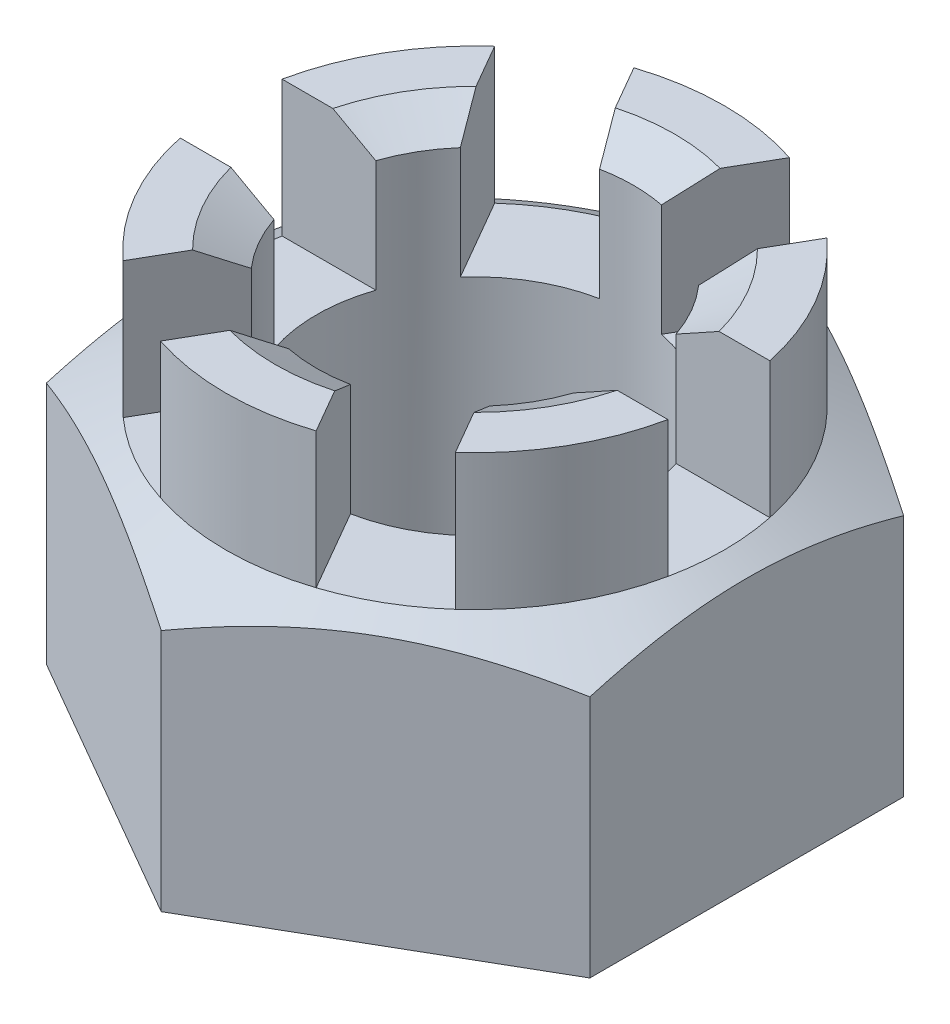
ISO-10303-21;
HEADER;
FILE_DESCRIPTION(('STEP AP214'),'2;1');
FILE_NAME('part.step','',(''),(''),'','','');
FILE_SCHEMA(('AUTOMOTIVE_DESIGN { 1 0 10303 214 1 1 1 1 }'));
ENDSEC;
DATA;
#1=APPLICATION_CONTEXT('core data for automotive mechanical design processes');
#2=APPLICATION_PROTOCOL_DEFINITION('international standard','automotive_design',2000,#1);
#3=PRODUCT_CONTEXT('',#1,'mechanical');
#4=PRODUCT('Part','Part','',(#3));
#5=PRODUCT_RELATED_PRODUCT_CATEGORY('part','',(#4));
#6=PRODUCT_DEFINITION_FORMATION('','',#4);
#7=PRODUCT_DEFINITION_CONTEXT('part definition',#1,'design');
#8=PRODUCT_DEFINITION('design','',#6,#7);
#9=PRODUCT_DEFINITION_SHAPE('','',#8);
#10=(LENGTH_UNIT() NAMED_UNIT(*) SI_UNIT(.MILLI.,.METRE.));
#11=(NAMED_UNIT(*) PLANE_ANGLE_UNIT() SI_UNIT($,.RADIAN.));
#12=(NAMED_UNIT(*) SI_UNIT($,.STERADIAN.) SOLID_ANGLE_UNIT());
#13=UNCERTAINTY_MEASURE_WITH_UNIT(LENGTH_MEASURE(1.E-05),#10,'distance_accuracy_value','');
#14=(GEOMETRIC_REPRESENTATION_CONTEXT(3) GLOBAL_UNCERTAINTY_ASSIGNED_CONTEXT((#13)) GLOBAL_UNIT_ASSIGNED_CONTEXT((#10,
#11,#12)) REPRESENTATION_CONTEXT('',''));
#15=CARTESIAN_POINT('',(0.,0.,0.));
#16=DIRECTION('',(0.,0.,1.));
#17=DIRECTION('',(1.,0.,0.));
#18=AXIS2_PLACEMENT_3D('',#15,#16,#17);
#19=CARTESIAN_POINT('',(12.,19.,-6.92820323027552));
#20=DIRECTION('',(0.,-1.,0.));
#21=DIRECTION('',(0.,0.,-1.));
#22=AXIS2_PLACEMENT_3D('',#19,#20,#21);
#23=PLANE('',#22);
#24=CARTESIAN_POINT('',(0.,19.,0.));
#25=DIRECTION('',(0.,-1.,0.));
#26=DIRECTION('',(0.,0.,-1.));
#27=AXIS2_PLACEMENT_3D('',#24,#25,#26);
#28=CIRCLE('',#27,11.);
#29=CARTESIAN_POINT('',(3.43515670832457,19.,10.4498659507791));
#30=VERTEX_POINT('',#29);
#31=CARTESIAN_POINT('',(-3.43515670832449,19.,10.4498659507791));
#32=VERTEX_POINT('',#31);
#33=EDGE_CURVE('E454',#30,#32,#28,.T.);
#34=ORIENTED_EDGE('',*,*,#33,.F.);
#35=DIRECTION('',(-0.500000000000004,0.,-0.866025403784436));
#36=VECTOR('',#35,1.);
#37=CARTESIAN_POINT('',(-1.94855715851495,19.,1.12500000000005));
#38=LINE('',#37,#36);
#39=CARTESIAN_POINT('',(2.31483781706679,19.,8.50941671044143));
#40=VERTEX_POINT('',#39);
#41=EDGE_CURVE('E538',#30,#40,#38,.T.);
#42=ORIENTED_EDGE('',*,*,#41,.T.);
#43=CARTESIAN_POINT('',(0.,19.,0.));
#44=DIRECTION('',(0.,-1.,0.));
#45=DIRECTION('',(0.,0.,-1.));
#46=AXIS2_PLACEMENT_3D('',#43,#44,#45);
#47=CIRCLE('',#46,8.81865334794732);
#48=CARTESIAN_POINT('',(-2.31483781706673,19.,8.50941671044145));
#49=VERTEX_POINT('',#48);
#50=EDGE_CURVE('E755',#40,#49,#47,.T.);
#51=ORIENTED_EDGE('',*,*,#50,.T.);
#52=DIRECTION('',(-0.499999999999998,0.,0.86602540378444));
#53=VECTOR('',#52,1.);
#54=CARTESIAN_POINT('',(7.94855715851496,19.,-9.26730484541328));
#55=LINE('',#54,#53);
#56=EDGE_CURVE('E547',#49,#32,#55,.T.);
#57=ORIENTED_EDGE('',*,*,#56,.T.);
#58=EDGE_LOOP('',(#34,#42,#51,#57));
#59=FACE_BOUND('',#58,.T.);
#60=ADVANCED_FACE('F35',(#59),#23,.F.);
#61=CARTESIAN_POINT('',(0.,19.,0.));
#62=DIRECTION('',(0.,-1.,0.));
#63=DIRECTION('',(0.,0.,-1.));
#64=AXIS2_PLACEMENT_3D('',#61,#62,#63);
#65=CIRCLE('',#64,11.);
#66=CARTESIAN_POINT('',(-7.33227102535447,19.,8.19986595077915));
#67=VERTEX_POINT('',#66);
#68=CARTESIAN_POINT('',(-10.767427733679,19.,2.25));
#69=VERTEX_POINT('',#68);
#70=EDGE_CURVE('E445',#67,#69,#65,.T.);
#71=ORIENTED_EDGE('',*,*,#70,.F.);
#72=DIRECTION('',(0.499999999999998,0.,-0.86602540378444));
#73=VECTOR('',#72,1.);
#74=CARTESIAN_POINT('',(4.05144284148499,19.,-11.5173048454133));
#75=LINE('',#74,#73);
#76=CARTESIAN_POINT('',(-6.21195213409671,19.,6.25941671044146));
#77=VERTEX_POINT('',#76);
#78=EDGE_CURVE('E542',#67,#77,#75,.T.);
#79=ORIENTED_EDGE('',*,*,#78,.T.);
#80=CARTESIAN_POINT('',(-8.52678995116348,19.,2.25));
#81=VERTEX_POINT('',#80);
#82=EDGE_CURVE('E307',#77,#81,#47,.T.);
#83=ORIENTED_EDGE('',*,*,#82,.T.);
#84=DIRECTION('',(-1.,0.,0.));
#85=VECTOR('',#84,1.);
#86=CARTESIAN_POINT('',(12.,19.,2.25));
#87=LINE('',#86,#85);
#88=EDGE_CURVE('E288',#81,#69,#87,.T.);
#89=ORIENTED_EDGE('',*,*,#88,.T.);
#90=EDGE_LOOP('',(#71,#79,#83,#89));
#91=FACE_BOUND('',#90,.T.);
#92=ADVANCED_FACE('F359',(#91),#23,.F.);
#93=CARTESIAN_POINT('',(0.,19.,0.));
#94=DIRECTION('',(0.,-1.,0.));
#95=DIRECTION('',(0.,0.,-1.));
#96=AXIS2_PLACEMENT_3D('',#93,#94,#95);
#97=CIRCLE('',#96,11.);
#98=CARTESIAN_POINT('',(7.33227102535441,19.,-8.1998659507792));
#99=VERTEX_POINT('',#98);
#100=CARTESIAN_POINT('',(10.767427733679,19.,-2.25000000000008));
#101=VERTEX_POINT('',#100);
#102=EDGE_CURVE('E466',#99,#101,#97,.T.);
#103=ORIENTED_EDGE('',*,*,#102,.F.);
#104=DIRECTION('',(-0.499999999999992,0.,0.866025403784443));
#105=VECTOR('',#104,1.);
#106=CARTESIAN_POINT('',(7.94855715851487,19.,-9.26730484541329));
#107=LINE('',#106,#105);
#108=CARTESIAN_POINT('',(6.21195213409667,19.,-6.2594167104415));
#109=VERTEX_POINT('',#108);
#110=EDGE_CURVE('E507',#99,#109,#107,.T.);
#111=ORIENTED_EDGE('',*,*,#110,.T.);
#112=CARTESIAN_POINT('',(8.52678995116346,19.,-2.25000000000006));
#113=VERTEX_POINT('',#112);
#114=EDGE_CURVE('E754',#109,#113,#47,.T.);
#115=ORIENTED_EDGE('',*,*,#114,.T.);
#116=DIRECTION('',(1.,0.,0.));
#117=VECTOR('',#116,1.);
#118=CARTESIAN_POINT('',(12.,19.,-2.25000000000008));
#119=LINE('',#118,#117);
#120=EDGE_CURVE('E522',#113,#101,#119,.T.);
#121=ORIENTED_EDGE('',*,*,#120,.T.);
#122=EDGE_LOOP('',(#103,#111,#115,#121));
#123=FACE_BOUND('',#122,.T.);
#124=ADVANCED_FACE('F846',(#123),#23,.F.);
#125=CARTESIAN_POINT('',(0.,19.,0.));
#126=DIRECTION('',(0.,-1.,0.));
#127=DIRECTION('',(0.,0.,-1.));
#128=AXIS2_PLACEMENT_3D('',#125,#126,#127);
#129=CIRCLE('',#128,11.);
#130=CARTESIAN_POINT('',(-3.43515670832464,19.,-10.4498659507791));
#131=VERTEX_POINT('',#130);
#132=CARTESIAN_POINT('',(3.43515670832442,19.,-10.4498659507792));
#133=VERTEX_POINT('',#132);
#134=EDGE_CURVE('E472',#131,#133,#129,.T.);
#135=ORIENTED_EDGE('',*,*,#134,.F.);
#136=DIRECTION('',(0.50000000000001,0.,0.866025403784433));
#137=VECTOR('',#136,1.);
#138=CARTESIAN_POINT('',(1.94855715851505,19.,-1.12499999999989));
#139=LINE('',#138,#137);
#140=CARTESIAN_POINT('',(-2.31483781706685,19.,-8.50941671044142));
#141=VERTEX_POINT('',#140);
#142=EDGE_CURVE('E503',#131,#141,#139,.T.);
#143=ORIENTED_EDGE('',*,*,#142,.T.);
#144=CARTESIAN_POINT('',(2.31483781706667,19.,-8.50941671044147));
#145=VERTEX_POINT('',#144);
#146=EDGE_CURVE('E313',#141,#145,#47,.T.);
#147=ORIENTED_EDGE('',*,*,#146,.T.);
#148=DIRECTION('',(0.499999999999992,0.,-0.866025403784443));
#149=VECTOR('',#148,1.);
#150=CARTESIAN_POINT('',(4.05144284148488,19.,-11.5173048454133));
#151=LINE('',#150,#149);
#152=EDGE_CURVE('E512',#145,#133,#151,.T.);
#153=ORIENTED_EDGE('',*,*,#152,.T.);
#154=EDGE_LOOP('',(#135,#143,#147,#153));
#155=FACE_BOUND('',#154,.T.);
#156=ADVANCED_FACE('F1049',(#155),#23,.F.);
#157=CARTESIAN_POINT('',(0.,19.,0.));
#158=DIRECTION('',(0.,-1.,0.));
#159=DIRECTION('',(0.,0.,-1.));
#160=AXIS2_PLACEMENT_3D('',#157,#158,#159);
#161=CIRCLE('',#160,11.);
#162=CARTESIAN_POINT('',(-10.767427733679,19.,-2.25));
#163=VERTEX_POINT('',#162);
#164=CARTESIAN_POINT('',(-7.33227102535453,19.,-8.19986595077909));
#165=VERTEX_POINT('',#164);
#166=EDGE_CURVE('E478',#163,#165,#161,.T.);
#167=ORIENTED_EDGE('',*,*,#166,.F.);
#168=DIRECTION('',(1.,0.,0.));
#169=VECTOR('',#168,1.);
#170=CARTESIAN_POINT('',(12.,19.,-2.25));
#171=LINE('',#170,#169);
#172=CARTESIAN_POINT('',(-8.52678995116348,19.,-2.25));
#173=VERTEX_POINT('',#172);
#174=EDGE_CURVE('E557',#163,#173,#171,.T.);
#175=ORIENTED_EDGE('',*,*,#174,.T.);
#176=CARTESIAN_POINT('',(-6.21195213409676,19.,-6.25941671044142));
#177=VERTEX_POINT('',#176);
#178=EDGE_CURVE('E309',#173,#177,#47,.T.);
#179=ORIENTED_EDGE('',*,*,#178,.T.);
#180=DIRECTION('',(-0.500000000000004,0.,-0.866025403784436));
#181=VECTOR('',#180,1.);
#182=CARTESIAN_POINT('',(-1.94855715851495,19.,1.12500000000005));
#183=LINE('',#182,#181);
#184=EDGE_CURVE('E527',#177,#165,#183,.T.);
#185=ORIENTED_EDGE('',*,*,#184,.T.);
#186=EDGE_LOOP('',(#167,#175,#179,#185));
#187=FACE_BOUND('',#186,.T.);
#188=ADVANCED_FACE('F440',(#187),#23,.F.);
#189=CARTESIAN_POINT('',(0.,19.,0.));
#190=DIRECTION('',(0.,-1.,0.));
#191=DIRECTION('',(0.,0.,-1.));
#192=AXIS2_PLACEMENT_3D('',#189,#190,#191);
#193=CIRCLE('',#192,11.);
#194=CARTESIAN_POINT('',(10.767427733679,19.,2.24999999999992));
#195=VERTEX_POINT('',#194);
#196=CARTESIAN_POINT('',(7.33227102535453,19.,8.19986595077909));
#197=VERTEX_POINT('',#196);
#198=EDGE_CURVE('E460',#195,#197,#193,.T.);
#199=ORIENTED_EDGE('',*,*,#198,.F.);
#200=DIRECTION('',(-1.,0.,0.));
#201=VECTOR('',#200,1.);
#202=CARTESIAN_POINT('',(12.0000000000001,19.,2.24999999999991));
#203=LINE('',#202,#201);
#204=CARTESIAN_POINT('',(8.52678995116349,19.,2.24999999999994));
#205=VERTEX_POINT('',#204);
#206=EDGE_CURVE('E517',#195,#205,#203,.T.);
#207=ORIENTED_EDGE('',*,*,#206,.T.);
#208=CARTESIAN_POINT('',(6.21195213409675,19.,6.25941671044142));
#209=VERTEX_POINT('',#208);
#210=EDGE_CURVE('E753',#205,#209,#47,.T.);
#211=ORIENTED_EDGE('',*,*,#210,.T.);
#212=DIRECTION('',(0.500000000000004,0.,0.866025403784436));
#213=VECTOR('',#212,1.);
#214=CARTESIAN_POINT('',(1.94855715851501,19.,-1.12499999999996));
#215=LINE('',#214,#213);
#216=EDGE_CURVE('E533',#209,#197,#215,.T.);
#217=ORIENTED_EDGE('',*,*,#216,.T.);
#218=EDGE_LOOP('',(#199,#207,#211,#217));
#219=FACE_BOUND('',#218,.T.);
#220=ADVANCED_FACE('F361',(#219),#23,.F.);
#221=CARTESIAN_POINT('',(12.,19.,-6.92820323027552));
#222=DIRECTION('',(-0.5,0.,0.866025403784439));
#223=DIRECTION('',(0.866025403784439,0.,0.5));
#224=AXIS2_PLACEMENT_3D('',#221,#222,#223);
#225=PLANE('',#224);
#226=DIRECTION('',(0.,-1.,0.));
#227=VECTOR('',#226,1.);
#228=CARTESIAN_POINT('',(12.,19.,-6.92820323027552));
#229=LINE('',#228,#227);
#230=CARTESIAN_POINT('',(12.,11.3508529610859,-6.92820323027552));
#231=VERTEX_POINT('',#230);
#232=CARTESIAN_POINT('',(12.,0.6,-6.92820323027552));
#233=VERTEX_POINT('',#232);
#234=EDGE_CURVE('E284',#231,#233,#229,.T.);
#235=ORIENTED_EDGE('',*,*,#234,.T.);
#236=DIRECTION('',(-0.866025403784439,0.,-0.5));
#237=VECTOR('',#236,1.);
#238=CARTESIAN_POINT('',(12.,0.6,-6.92820323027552));
#239=LINE('',#238,#237);
#240=CARTESIAN_POINT('',(0.,0.6,-13.856406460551));
#241=VERTEX_POINT('',#240);
#242=EDGE_CURVE('E50',#233,#241,#239,.T.);
#243=ORIENTED_EDGE('',*,*,#242,.T.);
#244=DIRECTION('',(0.,-1.,0.));
#245=VECTOR('',#244,1.);
#246=CARTESIAN_POINT('',(0.,19.,-13.856406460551));
#247=LINE('',#246,#245);
#248=CARTESIAN_POINT('',(0.,11.3508529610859,-13.856406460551));
#249=VERTEX_POINT('',#248);
#250=EDGE_CURVE('E297',#249,#241,#247,.T.);
#251=ORIENTED_EDGE('',*,*,#250,.F.);
#252=CARTESIAN_POINT('',(12.0002,11.3507862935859,-6.92808776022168));
#253=CARTESIAN_POINT('',(11.7364142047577,11.4387000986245,-7.0803845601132));
#254=CARTESIAN_POINT('',(11.4716448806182,11.5226237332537,-7.23324920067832));
#255=CARTESIAN_POINT('',(10.9399829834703,11.6813835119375,-7.54020434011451));
#256=CARTESIAN_POINT('',(10.6730897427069,11.7562166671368,-7.69429522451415));
#257=CARTESIAN_POINT('',(9.86810959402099,11.9656321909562,-8.15905073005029));
#258=CARTESIAN_POINT('',(9.32684492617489,12.0847464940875,-8.47155003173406));
#259=CARTESIAN_POINT('',(8.51686717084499,12.2244186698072,-8.93919090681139));
#260=CARTESIAN_POINT('',(8.25057389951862,12.2642059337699,-9.09293539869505));
#261=CARTESIAN_POINT('',(7.71675440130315,12.3309263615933,-9.40113622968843));
#262=CARTESIAN_POINT('',(7.44922815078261,12.3578592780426,-9.55559258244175));
#263=CARTESIAN_POINT('',(6.91372963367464,12.3981811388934,-9.86476279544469));
#264=CARTESIAN_POINT('',(6.64575827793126,12.411586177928,-10.0194761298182));
#265=CARTESIAN_POINT('',(6.10956726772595,12.4245666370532,-10.3290461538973));
#266=CARTESIAN_POINT('',(5.84134762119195,12.4241424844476,-10.4839028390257));
#267=CARTESIAN_POINT('',(5.33991062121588,12.4104297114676,-10.7734076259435));
#268=CARTESIAN_POINT('',(5.10665750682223,12.3988137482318,-10.908076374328));
#269=CARTESIAN_POINT('',(4.64068775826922,12.365341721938,-11.1771041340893));
#270=CARTESIAN_POINT('',(4.40797116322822,12.3434849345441,-11.3114631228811));
#271=CARTESIAN_POINT('',(3.94320092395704,12.2899123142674,-11.5797983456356));
#272=CARTESIAN_POINT('',(3.71114798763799,12.2581883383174,-11.7137741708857));
#273=CARTESIAN_POINT('',(3.24813003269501,12.1854379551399,-11.9810977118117));
#274=CARTESIAN_POINT('',(3.01716508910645,12.1444109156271,-12.1144453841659));
#275=CARTESIAN_POINT('',(2.31605804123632,12.0063380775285,-12.5192297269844));
#276=CARTESIAN_POINT('',(1.84794625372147,11.895524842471,-12.789494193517));
#277=CARTESIAN_POINT('',(0.918702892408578,11.6440239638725,-13.3259930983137));
#278=CARTESIAN_POINT('',(0.457559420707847,11.503395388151,-13.5922344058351));
#279=CARTESIAN_POINT('',(-0.000199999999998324,11.3507862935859,-13.8565219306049));
#280=B_SPLINE_CURVE_WITH_KNOTS('',3,(#252,#253,#254,#255,#256,#257,#258,#259,#260,#261,#262,
#263,#264,#265,#266,#267,#268,#269,#270,#271,#272,#273,#274,#275,#276,#277,#278,#279),
.UNSPECIFIED.,.F.,.F.,(4,2,2,2,2,2,2,2,2,2,2,2,2,4),(0.,0.95100487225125,1.90232158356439,
3.8090046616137,4.73894551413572,5.66890426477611,6.59775529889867,7.52657763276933,
8.33514643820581,9.14377244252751,9.95306755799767,10.7624176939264,12.4167102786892,
14.0677556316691),.UNSPECIFIED.);
#281=EDGE_CURVE('E421',#231,#249,#280,.T.);
#282=ORIENTED_EDGE('',*,*,#281,.F.);
#283=EDGE_LOOP('',(#235,#243,#251,#282));
#284=FACE_BOUND('',#283,.T.);
#285=ADVANCED_FACE('F431',(#284),#225,.F.);
#286=CARTESIAN_POINT('',(0.,19.,-13.856406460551));
#287=DIRECTION('',(0.5,0.,0.866025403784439));
#288=DIRECTION('',(0.866025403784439,0.,-0.5));
#289=AXIS2_PLACEMENT_3D('',#286,#287,#288);
#290=PLANE('',#289);
#291=ORIENTED_EDGE('',*,*,#250,.T.);
#292=DIRECTION('',(-0.866025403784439,0.,0.5));
#293=VECTOR('',#292,1.);
#294=CARTESIAN_POINT('',(0.,0.6,-13.856406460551));
#295=LINE('',#294,#293);
#296=CARTESIAN_POINT('',(-12.,0.6,-6.92820323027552));
#297=VERTEX_POINT('',#296);
#298=EDGE_CURVE('E794',#241,#297,#295,.T.);
#299=ORIENTED_EDGE('',*,*,#298,.T.);
#300=DIRECTION('',(0.,-1.,0.));
#301=VECTOR('',#300,1.);
#302=CARTESIAN_POINT('',(-12.,19.,-6.92820323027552));
#303=LINE('',#302,#301);
#304=CARTESIAN_POINT('',(-12.,11.3508529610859,-6.92820323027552));
#305=VERTEX_POINT('',#304);
#306=EDGE_CURVE('E294',#305,#297,#303,.T.);
#307=ORIENTED_EDGE('',*,*,#306,.F.);
#308=CARTESIAN_POINT('',(0.000200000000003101,11.3507862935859,-13.8565219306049));
#309=CARTESIAN_POINT('',(-0.26358579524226,11.4387000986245,-13.7042251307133));
#310=CARTESIAN_POINT('',(-0.528355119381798,11.5226237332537,-13.5513604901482));
#311=CARTESIAN_POINT('',(-1.06001701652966,11.6813835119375,-13.244405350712));
#312=CARTESIAN_POINT('',(-1.32691025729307,11.7562166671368,-13.0903144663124));
#313=CARTESIAN_POINT('',(-2.13189040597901,11.9656321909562,-12.6255589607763));
#314=CARTESIAN_POINT('',(-2.67315507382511,12.0847464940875,-12.3130596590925));
#315=CARTESIAN_POINT('',(-3.483132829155,12.2244186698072,-11.8454187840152));
#316=CARTESIAN_POINT('',(-3.74942610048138,12.2642059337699,-11.6916742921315));
#317=CARTESIAN_POINT('',(-4.28324559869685,12.3309263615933,-11.3834734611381));
#318=CARTESIAN_POINT('',(-4.55077184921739,12.3578592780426,-11.2290171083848));
#319=CARTESIAN_POINT('',(-5.08627036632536,12.3981811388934,-10.9198468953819));
#320=CARTESIAN_POINT('',(-5.35424172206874,12.411586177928,-10.7651335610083));
#321=CARTESIAN_POINT('',(-5.89043273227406,12.4245666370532,-10.4555635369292));
#322=CARTESIAN_POINT('',(-6.15865237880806,12.4241424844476,-10.3007068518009));
#323=CARTESIAN_POINT('',(-6.66008937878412,12.4104297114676,-10.011202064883));
#324=CARTESIAN_POINT('',(-6.89334249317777,12.3988137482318,-9.87653331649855));
#325=CARTESIAN_POINT('',(-7.35931224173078,12.365341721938,-9.60750555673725));
#326=CARTESIAN_POINT('',(-7.59202883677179,12.3434849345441,-9.47314656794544));
#327=CARTESIAN_POINT('',(-8.05679907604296,12.2899123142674,-9.2048113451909));
#328=CARTESIAN_POINT('',(-8.28885201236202,12.2581883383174,-9.07083551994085));
#329=CARTESIAN_POINT('',(-8.75186996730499,12.1854379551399,-8.80351197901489));
#330=CARTESIAN_POINT('',(-8.98283491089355,12.1444109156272,-8.67016430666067));
#331=CARTESIAN_POINT('',(-9.68394195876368,12.0063380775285,-8.26537996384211));
#332=CARTESIAN_POINT('',(-10.1520537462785,11.895524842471,-7.99511549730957));
#333=CARTESIAN_POINT('',(-11.0812971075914,11.6440239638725,-7.4586165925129));
#334=CARTESIAN_POINT('',(-11.5424405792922,11.503395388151,-7.19237528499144));
#335=CARTESIAN_POINT('',(-12.0002,11.3507862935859,-6.92808776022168));
#336=B_SPLINE_CURVE_WITH_KNOTS('',3,(#308,#309,#310,#311,#312,#313,#314,#315,#316,#317,#318,
#319,#320,#321,#322,#323,#324,#325,#326,#327,#328,#329,#330,#331,#332,#333,#334,#335),
.UNSPECIFIED.,.F.,.F.,(4,2,2,2,2,2,2,2,2,2,2,2,2,4),(0.,0.95100487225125,1.90232158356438,
3.8090046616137,4.73894551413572,5.66890426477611,6.59775529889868,7.52657763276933,
8.33514643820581,9.14377244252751,9.95306755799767,10.7624176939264,12.4167102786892,
14.0677556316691),.UNSPECIFIED.);
#337=EDGE_CURVE('E415',#249,#305,#336,.T.);
#338=ORIENTED_EDGE('',*,*,#337,.F.);
#339=EDGE_LOOP('',(#291,#299,#307,#338));
#340=FACE_BOUND('',#339,.T.);
#341=ADVANCED_FACE('F427',(#340),#290,.F.);
#342=CARTESIAN_POINT('',(-12.,19.,-6.92820323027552));
#343=DIRECTION('',(1.,0.,0.));
#344=DIRECTION('',(0.,0.,-1.));
#345=AXIS2_PLACEMENT_3D('',#342,#343,#344);
#346=PLANE('',#345);
#347=ORIENTED_EDGE('',*,*,#306,.T.);
#348=DIRECTION('',(0.,0.,1.));
#349=VECTOR('',#348,1.);
#350=CARTESIAN_POINT('',(-12.,0.6,-6.92820323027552));
#351=LINE('',#350,#349);
#352=CARTESIAN_POINT('',(-12.,0.6,6.9282032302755));
#353=VERTEX_POINT('',#352);
#354=EDGE_CURVE('E1130',#297,#353,#351,.T.);
#355=ORIENTED_EDGE('',*,*,#354,.T.);
#356=DIRECTION('',(0.,-1.,0.));
#357=VECTOR('',#356,1.);
#358=CARTESIAN_POINT('',(-12.,19.,6.9282032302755));
#359=LINE('',#358,#357);
#360=CARTESIAN_POINT('',(-12.,11.3508529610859,6.9282032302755));
#361=VERTEX_POINT('',#360);
#362=EDGE_CURVE('E286',#361,#353,#359,.T.);
#363=ORIENTED_EDGE('',*,*,#362,.F.);
#364=CARTESIAN_POINT('',(-12.,6.61144248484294,-18.5169581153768));
#365=CARTESIAN_POINT('',(-12.,6.73826565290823,-18.2551951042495));
#366=CARTESIAN_POINT('',(-12.,6.864449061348,-17.9931222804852));
#367=CARTESIAN_POINT('',(-12.,7.11539121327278,-17.4682922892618));
#368=CARTESIAN_POINT('',(-12.,7.24014994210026,-17.2055351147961));
#369=CARTESIAN_POINT('',(-12.,7.61210494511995,-16.4160685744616));
#370=CARTESIAN_POINT('',(-12.,7.85694163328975,-15.8882432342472));
#371=CARTESIAN_POINT('',(-12.,8.34016031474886,-14.8261117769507));
#372=CARTESIAN_POINT('',(-12.,8.57849911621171,-14.2917859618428));
#373=CARTESIAN_POINT('',(-12.,9.04529511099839,-13.2188498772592));
#374=CARTESIAN_POINT('',(-12.,9.27375277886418,-12.6802398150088));
#375=CARTESIAN_POINT('',(-12.,9.72498555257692,-11.581271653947));
#376=CARTESIAN_POINT('',(-12.,9.94737175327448,-11.0207530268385));
#377=CARTESIAN_POINT('',(-12.,10.3750874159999,-9.89312116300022));
#378=CARTESIAN_POINT('',(-12.,10.5804149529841,-9.32600719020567));
#379=CARTESIAN_POINT('',(-12.,10.9685548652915,-8.18539104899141));
#380=CARTESIAN_POINT('',(-12.,11.1514135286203,-7.61190476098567));
#381=CARTESIAN_POINT('',(-12.,11.4886987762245,-6.45665482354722));
#382=CARTESIAN_POINT('',(-12.,11.6431344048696,-5.87489387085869));
#383=CARTESIAN_POINT('',(-12.,11.8474446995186,-4.99744941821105));
#384=CARTESIAN_POINT('',(-12.,11.9108669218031,-4.70490064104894));
#385=CARTESIAN_POINT('',(-12.,12.0278172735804,-4.11782181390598));
#386=CARTESIAN_POINT('',(-12.,12.0813456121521,-3.82329180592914));
#387=CARTESIAN_POINT('',(-12.,12.1775574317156,-3.23246223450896));
#388=CARTESIAN_POINT('',(-12.,12.2202411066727,-2.93616270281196));
#389=CARTESIAN_POINT('',(-12.,12.29390918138,-2.34211396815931));
#390=CARTESIAN_POINT('',(-12.,12.3248940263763,-2.04436482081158));
#391=CARTESIAN_POINT('',(-12.,12.3741655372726,-1.45168007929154));
#392=CARTESIAN_POINT('',(-12.,12.3926109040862,-1.15675775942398));
#393=CARTESIAN_POINT('',(-12.,12.4170197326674,-0.566398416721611));
#394=CARTESIAN_POINT('',(-12.,12.4229833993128,-0.27096140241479));
#395=CARTESIAN_POINT('',(-12.,12.4222872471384,0.319906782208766));
#396=CARTESIAN_POINT('',(-12.,12.41562711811,0.615337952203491));
#397=CARTESIAN_POINT('',(-12.,12.3898439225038,1.20565948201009));
#398=CARTESIAN_POINT('',(-12.,12.370720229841,1.50054981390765));
#399=CARTESIAN_POINT('',(-12.,12.3099673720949,2.21178494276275));
#400=CARTESIAN_POINT('',(-12.,12.2622854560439,2.62762330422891));
#401=CARTESIAN_POINT('',(-12.,12.1447580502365,3.45613546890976));
#402=CARTESIAN_POINT('',(-12.,12.0749094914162,3.86880882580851));
#403=CARTESIAN_POINT('',(-12.,11.8358253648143,5.10162499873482));
#404=CARTESIAN_POINT('',(-12.,11.6370943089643,5.91611890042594));
#405=CARTESIAN_POINT('',(-12.,11.2933098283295,7.13453482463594));
#406=CARTESIAN_POINT('',(-12.,11.1694110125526,7.54478692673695));
#407=CARTESIAN_POINT('',(-12.,10.9089814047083,8.36130170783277));
#408=CARTESIAN_POINT('',(-12.,10.7724505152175,8.76756435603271));
#409=CARTESIAN_POINT('',(-12.,10.4889267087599,9.57624100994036));
#410=CARTESIAN_POINT('',(-12.,10.3419371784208,9.97865621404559));
#411=CARTESIAN_POINT('',(-12.,10.0392102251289,10.7801634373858));
#412=CARTESIAN_POINT('',(-12.,9.88347301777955,11.1792555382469));
#413=CARTESIAN_POINT('',(-12.,9.58124669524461,11.9332043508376));
#414=CARTESIAN_POINT('',(-12.,9.4354769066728,12.2883505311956));
#415=CARTESIAN_POINT('',(-12.,9.13891837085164,12.9965441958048));
#416=CARTESIAN_POINT('',(-12.,8.98812953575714,13.3495916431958));
#417=CARTESIAN_POINT('',(-12.,8.5293165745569,14.4060043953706));
#418=CARTESIAN_POINT('',(-12.,8.2148698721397,15.1065812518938));
#419=CARTESIAN_POINT('',(-12.,7.57315167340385,16.5021326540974));
#420=CARTESIAN_POINT('',(-12.,7.24587514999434,17.1971048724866));
#421=CARTESIAN_POINT('',(-12.,6.58167287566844,18.58237518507));
#422=CARTESIAN_POINT('',(-12.,6.24474754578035,19.2726734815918));
#423=CARTESIAN_POINT('',(-12.,5.56288200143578,20.6506784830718));
#424=CARTESIAN_POINT('',(-12.,5.21792972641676,21.3383792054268));
#425=CARTESIAN_POINT('',(-12.,4.52213500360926,22.7107976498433));
#426=CARTESIAN_POINT('',(-12.,4.17129250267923,23.3955153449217));
#427=CARTESIAN_POINT('',(-12.,3.4649899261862,24.76236677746));
#428=CARTESIAN_POINT('',(-12.,3.10953090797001,25.4445010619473));
#429=CARTESIAN_POINT('',(-12.,2.39480945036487,26.8067691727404));
#430=CARTESIAN_POINT('',(-12.,2.03554702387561,27.486903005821));
#431=CARTESIAN_POINT('',(-12.,1.03285890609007,29.3746837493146));
#432=CARTESIAN_POINT('',(-12.,0.3860763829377,30.5805472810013));
#433=CARTESIAN_POINT('',(-12.,-0.914581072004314,32.9885354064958));
#434=CARTESIAN_POINT('',(-12.,-1.56845645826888,34.1906597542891));
#435=CARTESIAN_POINT('',(-12.,-2.87931755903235,36.5881001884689));
#436=CARTESIAN_POINT('',(-12.,-3.536286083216,37.7834256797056));
#437=CARTESIAN_POINT('',(-12.,-4.52470777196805,39.5747124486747));
#438=CARTESIAN_POINT('',(-12.,-4.85466345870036,40.171501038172));
#439=CARTESIAN_POINT('',(-12.,-5.51546094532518,41.3645866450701));
#440=CARTESIAN_POINT('',(-12.,-5.84630274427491,41.9608836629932));
#441=CARTESIAN_POINT('',(-12.,-6.17753195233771,42.5569654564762));
#442=B_SPLINE_CURVE_WITH_KNOTS('',3,(#364,#365,#366,#367,#368,#369,#370,#371,#372,#373,#374,
#375,#376,#377,#378,#379,#380,#381,#382,#383,#384,#385,#386,#387,#388,#389,#390,#391,#392,#393,
#394,#395,#396,#397,#398,#399,#400,#401,#402,#403,#404,#405,#406,#407,#408,#409,#410,#411,#412,
#413,#414,#415,#416,#417,#418,#419,#420,#421,#422,#423,#424,#425,#426,#427,#428,#429,#430,#431,
#432,#433,#434,#435,#436,#437,#438,#439,#440,#441),.UNSPECIFIED.,.F.,.F.,(4,2,2,2,2,2,2,2,2,2,2,
2,2,2,2,2,2,2,2,2,2,2,2,2,2,2,2,2,2,2,2,2,2,2,2,2,2,2,4),(0.,0.872601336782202,1.74521164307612,
3.49069587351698,5.2458345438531,7.000888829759,8.80974590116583,10.6188068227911,
12.4240760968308,14.2287699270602,15.1266633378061,16.0245377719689,16.9223961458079,
17.8202203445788,18.7064587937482,19.5926826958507,20.4789283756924,21.3652185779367,
22.620198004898,23.8753512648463,26.3869930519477,27.6725475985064,28.9581120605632,
30.2432621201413,31.5283805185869,32.6800314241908,33.8317024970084,36.1352351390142,
38.439679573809,40.7440236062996,43.0520875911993,45.3601724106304,47.6677376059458,
49.9752949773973,54.0803656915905,58.1857010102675,62.2775964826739,64.3233834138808,
66.3691681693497),.UNSPECIFIED.);
#443=EDGE_CURVE('E408',#305,#361,#442,.T.);
#444=ORIENTED_EDGE('',*,*,#443,.F.);
#445=EDGE_LOOP('',(#347,#355,#363,#444));
#446=FACE_BOUND('',#445,.T.);
#447=ADVANCED_FACE('F430',(#446),#346,.F.);
#448=CARTESIAN_POINT('',(-12.,19.,6.9282032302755));
#449=DIRECTION('',(0.5,0.,-0.866025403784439));
#450=DIRECTION('',(-0.866025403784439,0.,-0.5));
#451=AXIS2_PLACEMENT_3D('',#448,#449,#450);
#452=PLANE('',#451);
#453=ORIENTED_EDGE('',*,*,#362,.T.);
#454=DIRECTION('',(0.866025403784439,0.,0.5));
#455=VECTOR('',#454,1.);
#456=CARTESIAN_POINT('',(-12.,0.6,6.9282032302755));
#457=LINE('',#456,#455);
#458=CARTESIAN_POINT('',(0.,0.6,13.856406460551));
#459=VERTEX_POINT('',#458);
#460=EDGE_CURVE('E279',#353,#459,#457,.T.);
#461=ORIENTED_EDGE('',*,*,#460,.T.);
#462=DIRECTION('',(0.,-1.,0.));
#463=VECTOR('',#462,1.);
#464=CARTESIAN_POINT('',(0.,19.,13.856406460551));
#465=LINE('',#464,#463);
#466=CARTESIAN_POINT('',(0.,11.3508529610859,13.856406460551));
#467=VERTEX_POINT('',#466);
#468=EDGE_CURVE('E278',#467,#459,#465,.T.);
#469=ORIENTED_EDGE('',*,*,#468,.F.);
#470=CARTESIAN_POINT('',(-12.0002,11.3507862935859,6.92808776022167));
#471=CARTESIAN_POINT('',(-11.7364142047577,11.4387000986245,7.08038456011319));
#472=CARTESIAN_POINT('',(-11.4716448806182,11.5226237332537,7.2332492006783));
#473=CARTESIAN_POINT('',(-10.9399829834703,11.6813835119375,7.54020434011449));
#474=CARTESIAN_POINT('',(-10.6730897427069,11.7562166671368,7.69429522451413));
#475=CARTESIAN_POINT('',(-9.86810959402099,11.9656321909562,8.15905073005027));
#476=CARTESIAN_POINT('',(-9.32684492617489,12.0847464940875,8.47155003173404));
#477=CARTESIAN_POINT('',(-8.516867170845,12.2244186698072,8.93919090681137));
#478=CARTESIAN_POINT('',(-8.25057389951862,12.2642059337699,9.09293539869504));
#479=CARTESIAN_POINT('',(-7.71675440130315,12.3309263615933,9.40113622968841));
#480=CARTESIAN_POINT('',(-7.44922815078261,12.3578592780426,9.55559258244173));
#481=CARTESIAN_POINT('',(-6.91372963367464,12.3981811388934,9.86476279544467));
#482=CARTESIAN_POINT('',(-6.64575827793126,12.411586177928,10.0194761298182));
#483=CARTESIAN_POINT('',(-6.10956726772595,12.4245666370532,10.3290461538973));
#484=CARTESIAN_POINT('',(-5.84134762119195,12.4241424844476,10.4839028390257));
#485=CARTESIAN_POINT('',(-5.33991062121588,12.4104297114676,10.7734076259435));
#486=CARTESIAN_POINT('',(-5.10665750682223,12.3988137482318,10.908076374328));
#487=CARTESIAN_POINT('',(-4.64068775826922,12.365341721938,11.1771041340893));
#488=CARTESIAN_POINT('',(-4.40797116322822,12.3434849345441,11.3114631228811));
#489=CARTESIAN_POINT('',(-3.94320092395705,12.2899123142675,11.5797983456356));
#490=CARTESIAN_POINT('',(-3.71114798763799,12.2581883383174,11.7137741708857));
#491=CARTESIAN_POINT('',(-3.24813003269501,12.1854379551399,11.9810977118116));
#492=CARTESIAN_POINT('',(-3.01716508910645,12.1444109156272,12.1144453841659));
#493=CARTESIAN_POINT('',(-2.31605804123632,12.0063380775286,12.5192297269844));
#494=CARTESIAN_POINT('',(-1.84794625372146,11.895524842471,12.789494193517));
#495=CARTESIAN_POINT('',(-0.918702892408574,11.6440239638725,13.3259930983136));
#496=CARTESIAN_POINT('',(-0.457559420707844,11.503395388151,13.5922344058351));
#497=CARTESIAN_POINT('',(0.000199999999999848,11.3507862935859,13.8565219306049));
#498=B_SPLINE_CURVE_WITH_KNOTS('',3,(#470,#471,#472,#473,#474,#475,#476,#477,#478,#479,#480,
#481,#482,#483,#484,#485,#486,#487,#488,#489,#490,#491,#492,#493,#494,#495,#496,#497),
.UNSPECIFIED.,.F.,.F.,(4,2,2,2,2,2,2,2,2,2,2,2,2,4),(0.,0.951004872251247,1.90232158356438,
3.8090046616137,4.73894551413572,5.66890426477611,6.59775529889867,7.52657763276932,
8.3351464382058,9.14377244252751,9.95306755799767,10.7624176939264,12.4167102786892,
14.0677556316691),.UNSPECIFIED.);
#499=EDGE_CURVE('E402',#361,#467,#498,.T.);
#500=ORIENTED_EDGE('',*,*,#499,.F.);
#501=EDGE_LOOP('',(#453,#461,#469,#500));
#502=FACE_BOUND('',#501,.T.);
#503=ADVANCED_FACE('F1014',(#502),#452,.F.);
#504=CARTESIAN_POINT('',(0.,19.,13.856406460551));
#505=DIRECTION('',(-0.5,0.,-0.866025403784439));
#506=DIRECTION('',(-0.866025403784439,0.,0.5));
#507=AXIS2_PLACEMENT_3D('',#504,#505,#506);
#508=PLANE('',#507);
#509=ORIENTED_EDGE('',*,*,#468,.T.);
#510=DIRECTION('',(0.866025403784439,0.,-0.5));
#511=VECTOR('',#510,1.);
#512=CARTESIAN_POINT('',(0.,0.6,13.856406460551));
#513=LINE('',#512,#511);
#514=CARTESIAN_POINT('',(12.,0.6,6.92820323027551));
#515=VERTEX_POINT('',#514);
#516=EDGE_CURVE('E266',#459,#515,#513,.T.);
#517=ORIENTED_EDGE('',*,*,#516,.T.);
#518=DIRECTION('',(0.,-1.,0.));
#519=VECTOR('',#518,1.);
#520=CARTESIAN_POINT('',(12.,19.,6.92820323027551));
#521=LINE('',#520,#519);
#522=CARTESIAN_POINT('',(12.,11.3508529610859,6.92820323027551));
#523=VERTEX_POINT('',#522);
#524=EDGE_CURVE('E276',#523,#515,#521,.T.);
#525=ORIENTED_EDGE('',*,*,#524,.F.);
#526=CARTESIAN_POINT('',(-0.000200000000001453,11.3507862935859,13.8565219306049));
#527=CARTESIAN_POINT('',(0.263585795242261,11.4387000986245,13.7042251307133));
#528=CARTESIAN_POINT('',(0.528355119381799,11.5226237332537,13.5513604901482));
#529=CARTESIAN_POINT('',(1.06001701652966,11.6813835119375,13.244405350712));
#530=CARTESIAN_POINT('',(1.32691025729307,11.7562166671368,13.0903144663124));
#531=CARTESIAN_POINT('',(2.13189040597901,11.9656321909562,12.6255589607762));
#532=CARTESIAN_POINT('',(2.67315507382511,12.0847464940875,12.3130596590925));
#533=CARTESIAN_POINT('',(3.483132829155,12.2244186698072,11.8454187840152));
#534=CARTESIAN_POINT('',(3.74942610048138,12.2642059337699,11.6916742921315));
#535=CARTESIAN_POINT('',(4.28324559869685,12.3309263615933,11.3834734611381));
#536=CARTESIAN_POINT('',(4.55077184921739,12.3578592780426,11.2290171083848));
#537=CARTESIAN_POINT('',(5.08627036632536,12.3981811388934,10.9198468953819));
#538=CARTESIAN_POINT('',(5.35424172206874,12.411586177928,10.7651335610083));
#539=CARTESIAN_POINT('',(5.89043273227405,12.4245666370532,10.4555635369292));
#540=CARTESIAN_POINT('',(6.15865237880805,12.4241424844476,10.3007068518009));
#541=CARTESIAN_POINT('',(6.66008937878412,12.4104297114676,10.011202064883));
#542=CARTESIAN_POINT('',(6.89334249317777,12.3988137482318,9.87653331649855));
#543=CARTESIAN_POINT('',(7.35931224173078,12.365341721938,9.60750555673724));
#544=CARTESIAN_POINT('',(7.59202883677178,12.3434849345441,9.47314656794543));
#545=CARTESIAN_POINT('',(8.05679907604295,12.2899123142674,9.20481134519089));
#546=CARTESIAN_POINT('',(8.28885201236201,12.2581883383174,9.07083551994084));
#547=CARTESIAN_POINT('',(8.75186996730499,12.1854379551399,8.80351197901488));
#548=CARTESIAN_POINT('',(8.98283491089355,12.1444109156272,8.67016430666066));
#549=CARTESIAN_POINT('',(9.68394195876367,12.0063380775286,8.2653799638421));
#550=CARTESIAN_POINT('',(10.1520537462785,11.895524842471,7.99511549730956));
#551=CARTESIAN_POINT('',(11.0812971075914,11.6440239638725,7.45861659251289));
#552=CARTESIAN_POINT('',(11.5424405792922,11.503395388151,7.19237528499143));
#553=CARTESIAN_POINT('',(12.0002,11.3507862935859,6.92808776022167));
#554=B_SPLINE_CURVE_WITH_KNOTS('',3,(#526,#527,#528,#529,#530,#531,#532,#533,#534,#535,#536,
#537,#538,#539,#540,#541,#542,#543,#544,#545,#546,#547,#548,#549,#550,#551,#552,#553),
.UNSPECIFIED.,.F.,.F.,(4,2,2,2,2,2,2,2,2,2,2,2,2,4),(0.,0.951004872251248,1.90232158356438,
3.8090046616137,4.73894551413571,5.66890426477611,6.59775529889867,7.52657763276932,
8.3351464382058,9.1437724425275,9.95306755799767,10.7624176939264,12.4167102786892,
14.0677556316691),.UNSPECIFIED.);
#555=EDGE_CURVE('E57',#467,#523,#554,.T.);
#556=ORIENTED_EDGE('',*,*,#555,.F.);
#557=EDGE_LOOP('',(#509,#517,#525,#556));
#558=FACE_BOUND('',#557,.T.);
#559=ADVANCED_FACE('F275',(#558),#508,.F.);
#560=CARTESIAN_POINT('',(12.,19.,6.92820323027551));
#561=DIRECTION('',(-1.,0.,0.));
#562=DIRECTION('',(0.,0.,1.));
#563=AXIS2_PLACEMENT_3D('',#560,#561,#562);
#564=PLANE('',#563);
#565=ORIENTED_EDGE('',*,*,#524,.T.);
#566=DIRECTION('',(0.,0.,-1.));
#567=VECTOR('',#566,1.);
#568=CARTESIAN_POINT('',(12.,0.6,6.92820323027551));
#569=LINE('',#568,#567);
#570=EDGE_CURVE('E11',#515,#233,#569,.T.);
#571=ORIENTED_EDGE('',*,*,#570,.T.);
#572=ORIENTED_EDGE('',*,*,#234,.F.);
#573=CARTESIAN_POINT('',(12.,6.6114424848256,-18.5169581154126));
#574=CARTESIAN_POINT('',(12.,6.73826565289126,-18.2551951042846));
#575=CARTESIAN_POINT('',(12.,6.86444906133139,-17.9931222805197));
#576=CARTESIAN_POINT('',(12.,7.1153912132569,-17.4682922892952));
#577=CARTESIAN_POINT('',(12.,7.24014994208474,-17.2055351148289));
#578=CARTESIAN_POINT('',(12.,7.61210494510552,-16.4160685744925));
#579=CARTESIAN_POINT('',(12.,7.85694163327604,-15.8882432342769));
#580=CARTESIAN_POINT('',(12.,8.3401603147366,-14.826111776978));
#581=CARTESIAN_POINT('',(12.,8.57849911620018,-14.2917859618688));
#582=CARTESIAN_POINT('',(12.,9.0452951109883,-13.2188498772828));
#583=CARTESIAN_POINT('',(12.,9.2737527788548,-12.6802398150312));
#584=CARTESIAN_POINT('',(12.,9.72498555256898,-11.5812716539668));
#585=CARTESIAN_POINT('',(12.,9.94737175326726,-11.020753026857));
#586=CARTESIAN_POINT('',(12.,10.3750874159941,-9.89312116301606));
#587=CARTESIAN_POINT('',(12.,10.580414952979,-9.32600719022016));
#588=CARTESIAN_POINT('',(12.,10.9685548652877,-8.18539104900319));
#589=CARTESIAN_POINT('',(12.,11.1514135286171,-7.61190476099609));
#590=CARTESIAN_POINT('',(12.,11.4886987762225,-6.45665482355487));
#591=CARTESIAN_POINT('',(12.,11.6431344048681,-5.87489387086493));
#592=CARTESIAN_POINT('',(12.,11.8474446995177,-4.99744941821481));
#593=CARTESIAN_POINT('',(12.,11.9108669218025,-4.70490064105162));
#594=CARTESIAN_POINT('',(12.,12.0278172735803,-4.11782181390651));
#595=CARTESIAN_POINT('',(12.,12.0813456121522,-3.82329180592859));
#596=CARTESIAN_POINT('',(12.,12.177557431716,-3.23246223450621));
#597=CARTESIAN_POINT('',(12.,12.2202411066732,-2.93616270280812));
#598=CARTESIAN_POINT('',(12.,12.2939091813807,-2.34211396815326));
#599=CARTESIAN_POINT('',(12.,12.3248940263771,-2.04436482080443));
#600=CARTESIAN_POINT('',(12.,12.3741655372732,-1.4516800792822));
#601=CARTESIAN_POINT('',(12.,12.3926109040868,-1.15675775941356));
#602=CARTESIAN_POINT('',(12.,12.4170197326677,-0.566398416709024));
#603=CARTESIAN_POINT('',(12.,12.422983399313,-0.270961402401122));
#604=CARTESIAN_POINT('',(12.,12.4222872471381,0.319906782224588));
#605=CARTESIAN_POINT('',(12.,12.4156271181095,0.615337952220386));
#606=CARTESIAN_POINT('',(12.,12.3898439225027,1.20565948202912));
#607=CARTESIAN_POINT('',(12.,12.3707202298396,1.50054981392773));
#608=CARTESIAN_POINT('',(12.,12.3099673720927,2.2117849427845));
#609=CARTESIAN_POINT('',(12.,12.2622854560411,2.62762330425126));
#610=CARTESIAN_POINT('',(12.,12.1447580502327,3.4561354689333));
#611=CARTESIAN_POINT('',(12.,12.0749094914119,3.86880882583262));
#612=CARTESIAN_POINT('',(12.,11.8358253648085,5.10162499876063));
#613=CARTESIAN_POINT('',(12.,11.6370943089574,5.91611890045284));
#614=CARTESIAN_POINT('',(12.,11.2933098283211,7.13453482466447));
#615=CARTESIAN_POINT('',(12.,11.1694110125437,7.54478692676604));
#616=CARTESIAN_POINT('',(12.,10.9089814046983,8.36130170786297));
#617=CARTESIAN_POINT('',(12.,10.772450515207,8.76756435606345));
#618=CARTESIAN_POINT('',(12.,10.4889267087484,9.5762410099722));
#619=CARTESIAN_POINT('',(12.,10.3419371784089,9.97865621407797));
#620=CARTESIAN_POINT('',(12.,10.039210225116,10.7801634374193));
#621=CARTESIAN_POINT('',(12.,9.88347301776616,11.179255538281));
#622=CARTESIAN_POINT('',(12.,9.58124669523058,11.9332043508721));
#623=CARTESIAN_POINT('',(12.,9.43547690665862,12.2883505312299));
#624=CARTESIAN_POINT('',(12.,9.13891837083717,12.9965441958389));
#625=CARTESIAN_POINT('',(12.,8.98812953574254,13.3495916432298));
#626=CARTESIAN_POINT('',(12.,8.52931657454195,14.4060043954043));
#627=CARTESIAN_POINT('',(12.,8.21486987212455,15.1065812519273));
#628=CARTESIAN_POINT('',(12.,7.57315167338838,16.5021326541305));
#629=CARTESIAN_POINT('',(12.,7.24587514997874,17.1971048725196));
#630=CARTESIAN_POINT('',(12.,6.58167287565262,18.5823751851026));
#631=CARTESIAN_POINT('',(12.,6.24474754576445,19.2726734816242));
#632=CARTESIAN_POINT('',(12.,5.56288200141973,20.6506784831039));
#633=CARTESIAN_POINT('',(12.,5.21792972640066,21.3383792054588));
#634=CARTESIAN_POINT('',(12.,4.52213500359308,22.7107976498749));
#635=CARTESIAN_POINT('',(12.,4.17129250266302,23.3955153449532));
#636=CARTESIAN_POINT('',(12.,3.46498992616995,24.7623667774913));
#637=CARTESIAN_POINT('',(12.,3.10953090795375,25.4445010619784));
#638=CARTESIAN_POINT('',(12.,2.3948094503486,26.8067691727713));
#639=CARTESIAN_POINT('',(12.,2.03554702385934,27.4869030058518));
#640=CARTESIAN_POINT('',(12.,1.03285890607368,29.3746837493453));
#641=CARTESIAN_POINT('',(12.,0.386076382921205,30.580547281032));
#642=CARTESIAN_POINT('',(12.,-0.914581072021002,32.9885354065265));
#643=CARTESIAN_POINT('',(12.,-1.56845645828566,34.1906597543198));
#644=CARTESIAN_POINT('',(12.,-2.87931755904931,36.5881001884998));
#645=CARTESIAN_POINT('',(12.,-3.53628608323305,37.7834256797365));
#646=CARTESIAN_POINT('',(12.,-4.52470777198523,39.5747124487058));
#647=CARTESIAN_POINT('',(12.,-4.85466345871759,40.1715010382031));
#648=CARTESIAN_POINT('',(12.,-5.51546094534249,41.3645866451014));
#649=CARTESIAN_POINT('',(12.,-5.84630274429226,41.9608836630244));
#650=CARTESIAN_POINT('',(12.,-6.1775319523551,42.5569654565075));
#651=B_SPLINE_CURVE_WITH_KNOTS('',3,(#573,#574,#575,#576,#577,#578,#579,#580,#581,#582,#583,
#584,#585,#586,#587,#588,#589,#590,#591,#592,#593,#594,#595,#596,#597,#598,#599,#600,#601,#602,
#603,#604,#605,#606,#607,#608,#609,#610,#611,#612,#613,#614,#615,#616,#617,#618,#619,#620,#621,
#622,#623,#624,#625,#626,#627,#628,#629,#630,#631,#632,#633,#634,#635,#636,#637,#638,#639,#640,
#641,#642,#643,#644,#645,#646,#647,#648,#649,#650),.UNSPECIFIED.,.F.,.F.,(4,2,2,2,2,2,2,2,2,2,2,
2,2,2,2,2,2,2,2,2,2,2,2,2,2,2,2,2,2,2,2,2,2,2,2,2,2,2,4),(0.,0.872601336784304,1.74521164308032,
3.49069587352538,5.24583454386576,7.0008888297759,8.80974590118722,10.6188068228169,
12.4240760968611,14.228769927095,15.1266633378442,16.0245377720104,16.9223961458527,
17.8202203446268,18.7064587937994,19.5926826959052,20.4789283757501,21.3652185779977,
22.620198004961,23.8753512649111,26.3869930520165,27.6725475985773,28.9581120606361,
30.2432621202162,31.5283805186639,32.6800314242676,33.8317024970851,36.1352351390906,
38.4396795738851,40.7440236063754,43.0520875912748,45.3601724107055,47.6677376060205,
49.9752949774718,54.0803656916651,58.1857010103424,62.2775964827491,64.3233834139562,
66.3691681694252),.UNSPECIFIED.);
#652=EDGE_CURVE('E283',#523,#231,#651,.F.);
#653=ORIENTED_EDGE('',*,*,#652,.F.);
#654=EDGE_LOOP('',(#565,#571,#572,#653));
#655=FACE_BOUND('',#654,.T.);
#656=ADVANCED_FACE('F282',(#655),#564,.F.);
#657=CARTESIAN_POINT('',(-28.8,13.,2.25));
#658=DIRECTION('',(0.,-1.,0.));
#659=DIRECTION('',(0.,0.,-1.));
#660=AXIS2_PLACEMENT_3D('',#657,#658,#659);
#661=PLANE('',#660);
#662=CARTESIAN_POINT('',(0.,13.,0.));
#663=DIRECTION('',(0.,-1.,0.));
#664=DIRECTION('',(0.,0.,-1.));
#665=AXIS2_PLACEMENT_3D('',#662,#663,#664);
#666=CIRCLE('',#665,11.);
#667=CARTESIAN_POINT('',(-10.767427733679,13.,2.25));
#668=VERTEX_POINT('',#667);
#669=CARTESIAN_POINT('',(-10.767427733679,13.,-2.25));
#670=VERTEX_POINT('',#669);
#671=EDGE_CURVE('E784',#668,#670,#666,.T.);
#672=ORIENTED_EDGE('',*,*,#671,.F.);
#673=DIRECTION('',(1.,0.,0.));
#674=VECTOR('',#673,1.);
#675=CARTESIAN_POINT('',(-28.8,13.,2.25));
#676=LINE('',#675,#674);
#677=CARTESIAN_POINT('',(-6.62853679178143,13.,2.25));
#678=VERTEX_POINT('',#677);
#679=EDGE_CURVE('E550',#668,#678,#676,.T.);
#680=ORIENTED_EDGE('',*,*,#679,.T.);
#681=CARTESIAN_POINT('',(0.,13.,0.));
#682=DIRECTION('',(0.,-1.,0.));
#683=DIRECTION('',(0.,0.,-1.));
#684=AXIS2_PLACEMENT_3D('',#681,#682,#683);
#685=CIRCLE('',#684,7.);
#686=CARTESIAN_POINT('',(-6.62853679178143,13.,-2.25));
#687=VERTEX_POINT('',#686);
#688=EDGE_CURVE('E573',#678,#687,#685,.T.);
#689=ORIENTED_EDGE('',*,*,#688,.T.);
#690=DIRECTION('',(1.,0.,0.));
#691=VECTOR('',#690,1.);
#692=CARTESIAN_POINT('',(-28.8,13.,-2.25));
#693=LINE('',#692,#691);
#694=EDGE_CURVE('E551',#670,#687,#693,.T.);
#695=ORIENTED_EDGE('',*,*,#694,.F.);
#696=EDGE_LOOP('',(#672,#680,#689,#695));
#697=FACE_BOUND('',#696,.T.);
#698=ADVANCED_FACE('F345',(#697),#661,.F.);
#699=CARTESIAN_POINT('',(-28.8,32.,2.25));
#700=DIRECTION('',(0.,0.,1.));
#701=DIRECTION('',(0.,-1.,0.));
#702=AXIS2_PLACEMENT_3D('',#699,#700,#701);
#703=PLANE('',#702);
#704=DIRECTION('',(0.,-1.,0.));
#705=VECTOR('',#704,1.);
#706=CARTESIAN_POINT('',(-10.767427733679,0.,2.25));
#707=LINE('',#706,#705);
#708=EDGE_CURVE('E446',#69,#668,#707,.T.);
#709=ORIENTED_EDGE('',*,*,#708,.F.);
#710=ORIENTED_EDGE('',*,*,#88,.F.);
#711=CARTESIAN_POINT('',(-14.147419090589,22.1792185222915,2.25));
#712=CARTESIAN_POINT('',(-13.8443868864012,22.0064365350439,2.25));
#713=CARTESIAN_POINT('',(-13.5412977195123,21.8337543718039,2.25));
#714=CARTESIAN_POINT('',(-12.9349753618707,21.4886424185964,2.25));
#715=CARTESIAN_POINT('',(-12.63174217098,21.3162126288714,2.25));
#716=CARTESIAN_POINT('',(-11.7217390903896,20.799356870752,2.25));
#717=CARTESIAN_POINT('',(-11.1147088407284,20.4553891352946,2.25));
#718=CARTESIAN_POINT('',(-9.90132730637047,19.7703569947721,2.25));
#719=CARTESIAN_POINT('',(-9.29497914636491,19.4292870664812,2.25));
#720=CARTESIAN_POINT('',(-8.3840753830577,18.9201863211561,2.25));
#721=CARTESIAN_POINT('',(-8.08021770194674,18.7509073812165,2.25));
#722=CARTESIAN_POINT('',(-7.47185991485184,18.4135078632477,2.25));
#723=CARTESIAN_POINT('',(-7.16735981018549,18.2453872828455,2.25));
#724=CARTESIAN_POINT('',(-6.5551718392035,17.909531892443,2.25));
#725=CARTESIAN_POINT('',(-6.24747719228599,17.7418094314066,2.25));
#726=CARTESIAN_POINT('',(-5.63072550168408,17.408810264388,2.25));
#727=CARTESIAN_POINT('',(-5.32166833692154,17.2435337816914,2.25));
#728=CARTESIAN_POINT('',(-4.85613880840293,16.9983482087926,2.25));
#729=CARTESIAN_POINT('',(-4.70043929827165,16.9169729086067,2.25));
#730=CARTESIAN_POINT('',(-4.38837610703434,16.7555073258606,2.25));
#731=CARTESIAN_POINT('',(-4.23201243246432,16.6754170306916,2.25));
#732=CARTESIAN_POINT('',(-3.91845474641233,16.5169347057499,2.25));
#733=CARTESIAN_POINT('',(-3.76126086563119,16.4385424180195,2.25));
#734=CARTESIAN_POINT('',(-3.44576161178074,16.2840328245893,2.25));
#735=CARTESIAN_POINT('',(-3.28745627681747,16.2079154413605,2.25));
#736=CARTESIAN_POINT('',(-2.96384426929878,16.0562302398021,2.25));
#737=CARTESIAN_POINT('',(-2.79848534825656,15.9807732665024,2.25));
#738=CARTESIAN_POINT('',(-2.46565316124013,15.8347040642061,2.25));
#739=CARTESIAN_POINT('',(-2.29818026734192,15.7640909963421,2.25));
#740=CARTESIAN_POINT('',(-1.96074475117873,15.6301755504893,2.25));
#741=CARTESIAN_POINT('',(-1.79078870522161,15.5668568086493,2.25));
#742=CARTESIAN_POINT('',(-1.44719648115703,15.4509970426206,2.25));
#743=CARTESIAN_POINT('',(-1.27356197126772,15.3984512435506,2.25));
#744=CARTESIAN_POINT('',(-0.975070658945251,15.3228966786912,2.25));
#745=CARTESIAN_POINT('',(-0.851276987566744,15.2957584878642,2.25));
#746=CARTESIAN_POINT('',(-0.601900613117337,15.2515224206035,2.25));
#747=CARTESIAN_POINT('',(-0.476318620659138,15.234420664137,2.25));
#748=CARTESIAN_POINT('',(-0.224633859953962,15.2120819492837,2.25));
#749=CARTESIAN_POINT('',(-0.0985359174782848,15.2067923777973,2.25));
#750=CARTESIAN_POINT('',(0.153582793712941,15.2085744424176,2.25));
#751=CARTESIAN_POINT('',(0.279603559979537,15.2156464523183,2.25));
#752=CARTESIAN_POINT('',(0.488082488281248,15.2369545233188,2.25));
#753=CARTESIAN_POINT('',(0.57089230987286,15.2479682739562,2.25));
#754=CARTESIAN_POINT('',(0.735789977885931,15.2745187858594,2.25));
#755=CARTESIAN_POINT('',(0.81787770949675,15.2900562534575,2.25));
#756=CARTESIAN_POINT('',(1.06301846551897,15.3425895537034,2.25));
#757=CARTESIAN_POINT('',(1.22481290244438,15.3854905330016,2.25));
#758=CARTESIAN_POINT('',(1.46622297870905,15.4585497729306,2.25));
#759=CARTESIAN_POINT('',(1.54715205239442,15.4846103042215,2.25));
#760=CARTESIAN_POINT('',(1.70815790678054,15.5390959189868,2.25));
#761=CARTESIAN_POINT('',(1.78823520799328,15.5675194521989,2.25));
#762=CARTESIAN_POINT('',(2.0273570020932,15.6556945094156,2.25));
#763=CARTESIAN_POINT('',(2.18532270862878,15.7183603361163,2.25));
#764=CARTESIAN_POINT('',(2.4732801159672,15.8382652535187,2.25));
#765=CARTESIAN_POINT('',(2.60360939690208,15.894707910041,2.25));
#766=CARTESIAN_POINT('',(2.86303828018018,16.0103477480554,2.25));
#767=CARTESIAN_POINT('',(2.99213787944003,16.0695449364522,2.25));
#768=CARTESIAN_POINT('',(3.24941407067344,16.1900344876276,2.25));
#769=CARTESIAN_POINT('',(3.37759027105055,16.2513276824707,2.25));
#770=CARTESIAN_POINT('',(3.63316929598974,16.3755069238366,2.25));
#771=CARTESIAN_POINT('',(3.76057210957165,16.438392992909,2.25));
#772=CARTESIAN_POINT('',(4.00870358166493,16.5623838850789,2.25));
#773=CARTESIAN_POINT('',(4.12946117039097,16.6234309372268,2.25));
#774=CARTESIAN_POINT('',(4.37051475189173,16.7464300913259,2.25));
#775=CARTESIAN_POINT('',(4.49081074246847,16.80838219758,2.25));
#776=CARTESIAN_POINT('',(4.7308989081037,16.9329560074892,2.25));
#777=CARTESIAN_POINT('',(4.85069147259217,16.9955769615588,2.25));
#778=CARTESIAN_POINT('',(5.08995439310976,17.1214250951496,2.25));
#779=CARTESIAN_POINT('',(5.20942475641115,17.184652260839,2.25));
#780=CARTESIAN_POINT('',(5.32876574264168,17.2481211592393,2.25));
#781=B_SPLINE_CURVE_WITH_KNOTS('',3,(#711,#712,#713,#714,#715,#716,#717,#718,#719,#720,#721,
#722,#723,#724,#725,#726,#727,#728,#729,#730,#731,#732,#733,#734,#735,#736,#737,#738,#739,#740,
#741,#742,#743,#744,#745,#746,#747,#748,#749,#750,#751,#752,#753,#754,#755,#756,#757,#758,#759,
#760,#761,#762,#763,#764,#765,#766,#767,#768,#769,#770,#771,#772,#773,#774,#775,#776,#777,#778,
#779,#780),.UNSPECIFIED.,.F.,.F.,(4,2,2,2,2,2,2,2,2,2,2,2,2,2,2,2,2,2,2,2,2,2,2,2,2,2,2,2,2,2,2,
2,2,2,4),(0.,1.04648901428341,2.09297903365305,4.18610810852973,6.27317553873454,
7.31666018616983,8.36014269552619,9.41145093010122,10.4628545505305,10.9898971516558,
11.5169345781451,12.0438913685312,12.5708301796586,13.1160648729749,13.661204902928,
14.2050971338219,14.7487477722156,15.128625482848,15.5083562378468,15.8863922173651,
16.2644396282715,16.5149309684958,16.765461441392,17.266931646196,17.5219788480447,
17.7768600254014,18.2865240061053,18.7125707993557,19.138618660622,19.5648376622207,
19.991062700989,20.3969919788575,20.8029231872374,21.208439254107,21.6139460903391),.UNSPECIFIED.);
#782=CARTESIAN_POINT('',(-6.62853679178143,17.95,2.25));
#783=VERTEX_POINT('',#782);
#784=EDGE_CURVE('E324',#81,#783,#781,.T.);
#785=ORIENTED_EDGE('',*,*,#784,.T.);
#786=DIRECTION('',(0.,-1.,0.));
#787=VECTOR('',#786,1.);
#788=CARTESIAN_POINT('',(-6.62853679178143,19.,2.25));
#789=LINE('',#788,#787);
#790=EDGE_CURVE('E559',#783,#678,#789,.T.);
#791=ORIENTED_EDGE('',*,*,#790,.T.);
#792=ORIENTED_EDGE('',*,*,#679,.F.);
#793=EDGE_LOOP('',(#709,#710,#785,#791,#792));
#794=FACE_BOUND('',#793,.T.);
#795=ADVANCED_FACE('F340',(#794),#703,.F.);
#796=CARTESIAN_POINT('',(-28.8,32.,-2.25));
#797=DIRECTION('',(0.,0.,-1.));
#798=DIRECTION('',(0.,1.,0.));
#799=AXIS2_PLACEMENT_3D('',#796,#797,#798);
#800=PLANE('',#799);
#801=DIRECTION('',(0.,-1.,0.));
#802=VECTOR('',#801,1.);
#803=CARTESIAN_POINT('',(-10.767427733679,0.,-2.25));
#804=LINE('',#803,#802);
#805=EDGE_CURVE('E480',#670,#163,#804,.F.);
#806=ORIENTED_EDGE('',*,*,#805,.F.);
#807=ORIENTED_EDGE('',*,*,#694,.T.);
#808=DIRECTION('',(0.,-1.,0.));
#809=VECTOR('',#808,1.);
#810=CARTESIAN_POINT('',(-6.62853679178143,19.,-2.25));
#811=LINE('',#810,#809);
#812=CARTESIAN_POINT('',(-6.62853679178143,17.95,-2.25));
#813=VERTEX_POINT('',#812);
#814=EDGE_CURVE('E553',#687,#813,#811,.F.);
#815=ORIENTED_EDGE('',*,*,#814,.T.);
#816=CARTESIAN_POINT('',(5.32876574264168,17.2481211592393,-2.25));
#817=CARTESIAN_POINT('',(5.20800255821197,17.1838961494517,-2.25));
#818=CARTESIAN_POINT('',(5.08710701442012,17.1199183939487,-2.25));
#819=CARTESIAN_POINT('',(4.84498706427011,16.9925860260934,-2.25));
#820=CARTESIAN_POINT('',(4.72376265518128,16.9292314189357,-2.25));
#821=CARTESIAN_POINT('',(4.48078757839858,16.8032048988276,-2.25));
#822=CARTESIAN_POINT('',(4.35903647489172,16.7405338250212,-2.25));
#823=CARTESIAN_POINT('',(4.11505637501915,16.6161246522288,-2.25));
#824=CARTESIAN_POINT('',(3.99282737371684,16.5543865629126,-2.25));
#825=CARTESIAN_POINT('',(3.74137518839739,16.4288777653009,-2.25));
#826=CARTESIAN_POINT('',(3.61212066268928,16.3651697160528,-2.25));
#827=CARTESIAN_POINT('',(3.35280551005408,16.2394170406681,-2.25));
#828=CARTESIAN_POINT('',(3.22274489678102,16.1773723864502,-2.25));
#829=CARTESIAN_POINT('',(2.9616556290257,16.0554838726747,-2.25));
#830=CARTESIAN_POINT('',(2.83062738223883,15.9956391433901,-2.25));
#831=CARTESIAN_POINT('',(2.5672866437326,15.8788567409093,-2.25));
#832=CARTESIAN_POINT('',(2.43497424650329,15.8219188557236,-2.25));
#833=CARTESIAN_POINT('',(2.15820021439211,15.7076425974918,-2.25));
#834=CARTESIAN_POINT('',(2.01360386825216,15.6506272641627,-2.25));
#835=CARTESIAN_POINT('',(1.72203264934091,15.5431033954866,-2.25));
#836=CARTESIAN_POINT('',(1.5750586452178,15.4925925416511,-2.25));
#837=CARTESIAN_POINT('',(1.28071025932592,15.4015916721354,-2.25));
#838=CARTESIAN_POINT('',(1.13338503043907,15.3609460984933,-2.25));
#839=CARTESIAN_POINT('',(0.83582854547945,15.2920980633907,-2.25));
#840=CARTESIAN_POINT('',(0.685599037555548,15.2638883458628,-2.25));
#841=CARTESIAN_POINT('',(0.408772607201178,15.2269698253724,-2.25));
#842=CARTESIAN_POINT('',(0.282518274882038,15.2157544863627,-2.25));
#843=CARTESIAN_POINT('',(0.0295399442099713,15.2056574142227,-2.25));
#844=CARTESIAN_POINT('',(-0.0971838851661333,15.2067716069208,-2.25));
#845=CARTESIAN_POINT('',(-0.35078504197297,15.2212424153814,-2.25));
#846=CARTESIAN_POINT('',(-0.477657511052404,15.2346825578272,-2.25));
#847=CARTESIAN_POINT('',(-0.666704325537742,15.2629558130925,-2.25));
#848=CARTESIAN_POINT('',(-0.729524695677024,15.2737360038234,-2.25));
#849=CARTESIAN_POINT('',(-0.854693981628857,15.2977354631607,-2.25));
#850=CARTESIAN_POINT('',(-0.917042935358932,15.3109545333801,-2.25));
#851=CARTESIAN_POINT('',(-1.09019656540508,15.3508435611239,-2.25));
#852=CARTESIAN_POINT('',(-1.20045176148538,15.3799019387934,-2.25));
#853=CARTESIAN_POINT('',(-1.41938596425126,15.4434959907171,-2.25));
#854=CARTESIAN_POINT('',(-1.52806432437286,15.4780338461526,-2.25));
#855=CARTESIAN_POINT('',(-1.74413694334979,15.5513980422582,-2.25));
#856=CARTESIAN_POINT('',(-1.85152897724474,15.590230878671,-2.25));
#857=CARTESIAN_POINT('',(-2.065048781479,15.6711640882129,-2.25));
#858=CARTESIAN_POINT('',(-2.1711767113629,15.7132640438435,-2.25));
#859=CARTESIAN_POINT('',(-2.3829241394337,15.8002193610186,-2.25));
#860=CARTESIAN_POINT('',(-2.48853829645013,15.845087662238,-2.25));
#861=CARTESIAN_POINT('',(-2.69889363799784,15.9368309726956,-2.25));
#862=CARTESIAN_POINT('',(-2.8036347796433,15.9837060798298,-2.25));
#863=CARTESIAN_POINT('',(-3.11660279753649,16.126603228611,-2.25));
#864=CARTESIAN_POINT('',(-3.32375573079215,16.2249734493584,-2.25));
#865=CARTESIAN_POINT('',(-3.74071978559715,16.4279892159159,-2.25));
#866=CARTESIAN_POINT('',(-3.95048595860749,16.5327261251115,-2.25));
#867=CARTESIAN_POINT('',(-4.36860995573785,16.7450586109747,-2.25));
#868=CARTESIAN_POINT('',(-4.57696752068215,16.8526546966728,-2.25));
#869=CARTESIAN_POINT('',(-4.9919765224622,17.0694856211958,-2.25));
#870=CARTESIAN_POINT('',(-5.19863128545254,17.1787141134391,-2.25));
#871=CARTESIAN_POINT('',(-5.61117614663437,17.3986073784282,-2.25));
#872=CARTESIAN_POINT('',(-5.81706623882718,17.5092721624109,-2.25));
#873=CARTESIAN_POINT('',(-6.37287583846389,17.809869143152,-2.25));
#874=CARTESIAN_POINT('',(-6.72224904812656,18.0008105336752,-2.25));
#875=CARTESIAN_POINT('',(-7.41992205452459,18.3846578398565,-2.25));
#876=CARTESIAN_POINT('',(-7.76822182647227,18.577563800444,-2.25));
#877=CARTESIAN_POINT('',(-8.46449444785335,18.9649472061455,-2.25));
#878=CARTESIAN_POINT('',(-8.81246640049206,19.1594262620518,-2.25));
#879=CARTESIAN_POINT('',(-9.50787790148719,19.54933368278,-2.25));
#880=CARTESIAN_POINT('',(-9.85531744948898,19.7447620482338,-2.25));
#881=CARTESIAN_POINT('',(-10.5320210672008,20.1262900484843,-2.25));
#882=CARTESIAN_POINT('',(-10.8613047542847,20.3123549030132,-2.25));
#883=CARTESIAN_POINT('',(-11.519600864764,20.6849656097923,-2.25));
#884=CARTESIAN_POINT('',(-11.8486132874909,20.8715114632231,-2.25));
#885=CARTESIAN_POINT('',(-12.5060215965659,21.2447483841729,-2.25));
#886=CARTESIAN_POINT('',(-12.8344177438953,21.4314389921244,-2.25));
#887=CARTESIAN_POINT('',(-13.4910374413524,21.8051210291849,-2.25));
#888=CARTESIAN_POINT('',(-13.8192609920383,21.992112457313,-2.25));
#889=CARTESIAN_POINT('',(-14.147419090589,22.1792185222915,-2.25));
#890=B_SPLINE_CURVE_WITH_KNOTS('',3,(#816,#817,#818,#819,#820,#821,#822,#823,#824,#825,#826,
#827,#828,#829,#830,#831,#832,#833,#834,#835,#836,#837,#838,#839,#840,#841,#842,#843,#844,#845,
#846,#847,#848,#849,#850,#851,#852,#853,#854,#855,#856,#857,#858,#859,#860,#861,#862,#863,#864,
#865,#866,#867,#868,#869,#870,#871,#872,#873,#874,#875,#876,#877,#878,#879,#880,#881,#882,#883,
#884,#885,#886,#887,#888,#889),.UNSPECIFIED.,.F.,.F.,(4,2,2,2,2,2,2,2,2,2,2,2,2,2,2,2,2,2,2,2,2,
2,2,2,2,2,2,2,2,2,2,2,2,2,2,2,4),(0.,0.410338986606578,0.820681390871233,1.23148091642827,
1.64228469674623,2.07458218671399,2.50687237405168,2.93898977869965,3.37107562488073,
3.83726250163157,4.3032827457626,4.76139179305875,5.21923318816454,5.59893411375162,
5.97850957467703,6.3606763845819,6.5518525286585,6.74301312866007,7.08487496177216,
7.42687322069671,7.76939598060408,8.11187504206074,8.45609811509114,8.80033799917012,
9.48822743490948,10.19158267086,10.8950639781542,11.5962939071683,12.2975293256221,
13.4919560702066,14.6864101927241,15.8823006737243,17.0781919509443,18.2128415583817,
19.3474939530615,20.4807531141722,21.6140085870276),.UNSPECIFIED.);
#891=EDGE_CURVE('E316',#813,#173,#890,.T.);
#892=ORIENTED_EDGE('',*,*,#891,.T.);
#893=ORIENTED_EDGE('',*,*,#174,.F.);
#894=EDGE_LOOP('',(#806,#807,#815,#892,#893));
#895=FACE_BOUND('',#894,.T.);
#896=ADVANCED_FACE('F334',(#895),#800,.F.);
#897=CARTESIAN_POINT('',(-12.4514428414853,32.,-26.0665316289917));
#898=DIRECTION('',(0.866025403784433,0.,-0.50000000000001));
#899=DIRECTION('',(-0.50000000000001,0.,-0.866025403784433));
#900=AXIS2_PLACEMENT_3D('',#897,#898,#899);
#901=PLANE('',#900);
#902=DIRECTION('',(0.,-1.,0.));
#903=VECTOR('',#902,1.);
#904=CARTESIAN_POINT('',(-3.43515670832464,0.,-10.4498659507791));
#905=LINE('',#904,#903);
#906=CARTESIAN_POINT('',(-3.43515670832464,13.,-10.4498659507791));
#907=VERTEX_POINT('',#906);
#908=EDGE_CURVE('E474',#907,#131,#905,.F.);
#909=ORIENTED_EDGE('',*,*,#908,.F.);
#910=DIRECTION('',(0.50000000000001,0.,0.866025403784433));
#911=VECTOR('',#910,1.);
#912=CARTESIAN_POINT('',(-12.4514428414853,13.,-26.0665316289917));
#913=LINE('',#912,#911);
#914=CARTESIAN_POINT('',(-1.36571123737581,13.,-6.8654812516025));
#915=VERTEX_POINT('',#914);
#916=EDGE_CURVE('E482',#907,#915,#913,.T.);
#917=ORIENTED_EDGE('',*,*,#916,.T.);
#918=DIRECTION('',(0.,-1.,0.));
#919=VECTOR('',#918,1.);
#920=CARTESIAN_POINT('',(-1.36571123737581,19.,-6.8654812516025));
#921=LINE('',#920,#919);
#922=CARTESIAN_POINT('',(-1.36571123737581,17.95,-6.8654812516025));
#923=VERTEX_POINT('',#922);
#924=EDGE_CURVE('E500',#915,#923,#921,.F.);
#925=ORIENTED_EDGE('',*,*,#924,.T.);
#926=CARTESIAN_POINT('',(3.33105071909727,15.9666745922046,1.26954908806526));
#927=CARTESIAN_POINT('',(3.29073882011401,15.93057980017,1.19972683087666));
#928=CARTESIAN_POINT('',(3.25031150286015,15.8949915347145,1.12970466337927));
#929=CARTESIAN_POINT('',(3.16917661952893,15.8250727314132,0.989174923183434));
#930=CARTESIAN_POINT('',(3.12846899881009,15.7907424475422,0.91866725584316));
#931=CARTESIAN_POINT('',(3.04655270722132,15.7234449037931,0.77678407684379));
#932=CARTESIAN_POINT('',(3.00534259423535,15.6904846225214,0.705406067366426));
#933=CARTESIAN_POINT('',(2.92256240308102,15.6264422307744,0.562026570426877));
#934=CARTESIAN_POINT('',(2.8809923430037,15.5953600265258,0.490025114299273));
#935=CARTESIAN_POINT('',(2.75587250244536,15.5056655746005,0.273311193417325));
#936=CARTESIAN_POINT('',(2.67170171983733,15.4504275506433,0.127523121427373));
#937=CARTESIAN_POINT('',(2.50149967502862,15.3535060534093,-0.167275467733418));
#938=CARTESIAN_POINT('',(2.415471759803,15.3118000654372,-0.316280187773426));
#939=CARTESIAN_POINT('',(2.26503784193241,15.2562252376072,-0.576839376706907));
#940=CARTESIAN_POINT('',(2.2010544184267,15.2378830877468,-0.687661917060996));
#941=CARTESIAN_POINT('',(2.07250368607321,15.2134011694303,-0.910318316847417));
#942=CARTESIAN_POINT('',(2.00793657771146,15.2072573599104,-1.02215182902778));
#943=CARTESIAN_POINT('',(1.87920357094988,15.2079405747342,-1.24512393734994));
#944=CARTESIAN_POINT('',(1.81503756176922,15.2146909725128,-1.35626272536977));
#945=CARTESIAN_POINT('',(1.68730609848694,15.2401679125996,-1.57750010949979));
#946=CARTESIAN_POINT('',(1.62374083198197,15.2588980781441,-1.68759838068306));
#947=CARTESIAN_POINT('',(1.49253882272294,15.3082717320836,-1.91484692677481));
#948=CARTESIAN_POINT('',(1.42498254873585,15.3397474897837,-2.03185782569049));
#949=CARTESIAN_POINT('',(1.29104908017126,15.4116189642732,-2.26383739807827));
#950=CARTESIAN_POINT('',(1.22467272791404,15.4520207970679,-2.37880461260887));
#951=CARTESIAN_POINT('',(1.09285152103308,15.5394740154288,-2.60712564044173));
#952=CARTESIAN_POINT('',(1.02740951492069,15.5865423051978,-2.72047451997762));
#953=CARTESIAN_POINT('',(0.897461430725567,15.6854526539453,-2.94555120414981));
#954=CARTESIAN_POINT('',(0.832955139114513,15.7372936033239,-3.057279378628));
#955=CARTESIAN_POINT('',(0.702687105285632,15.8461533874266,-3.28291023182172));
#956=CARTESIAN_POINT('',(0.636948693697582,15.9032831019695,-3.3967725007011));
#957=CARTESIAN_POINT('',(0.506089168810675,16.020301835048,-3.62342784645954));
#958=CARTESIAN_POINT('',(0.440968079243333,16.0801909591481,-3.73622088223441));
#959=CARTESIAN_POINT('',(0.31132605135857,16.2019389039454,-3.96076746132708));
#960=CARTESIAN_POINT('',(0.246804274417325,16.2637941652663,-4.07252245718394));
#961=CARTESIAN_POINT('',(0.118150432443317,16.3890924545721,-4.29535744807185));
#962=CARTESIAN_POINT('',(0.0540183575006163,16.45253544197,-4.40643746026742));
#963=CARTESIAN_POINT('',(-0.142838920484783,16.6496292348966,-4.74740426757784));
#964=CARTESIAN_POINT('',(-0.275055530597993,16.7853095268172,-4.97641015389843));
#965=CARTESIAN_POINT('',(-0.538633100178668,17.059961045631,-5.43293989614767));
#966=CARTESIAN_POINT('',(-0.669994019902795,17.1989324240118,-5.66046368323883));
#967=CARTESIAN_POINT('',(-0.932143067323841,17.4790933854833,-6.11451915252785));
#968=CARTESIAN_POINT('',(-1.0629311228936,17.6202832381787,-6.34105070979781));
#969=CARTESIAN_POINT('',(-1.32408994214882,17.904199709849,-6.79339105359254));
#970=CARTESIAN_POINT('',(-1.45446070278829,18.0469263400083,-7.0191998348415));
#971=CARTESIAN_POINT('',(-1.84539963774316,18.4770484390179,-7.69632593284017));
#972=CARTESIAN_POINT('',(-2.10551587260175,18.7660856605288,-8.14686046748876));
#973=CARTESIAN_POINT('',(-2.62504170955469,19.3465903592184,-9.04670561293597));
#974=CARTESIAN_POINT('',(-2.88445136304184,19.6380576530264,-9.49601631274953));
#975=CARTESIAN_POINT('',(-3.36763009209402,20.1828498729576,-10.3329064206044));
#976=CARTESIAN_POINT('',(-3.59145450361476,20.4359785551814,-10.7205816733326));
#977=CARTESIAN_POINT('',(-4.03887884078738,20.9430521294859,-11.4955433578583));
#978=CARTESIAN_POINT('',(-4.26247876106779,21.1969970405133,-11.8828297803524));
#979=CARTESIAN_POINT('',(-4.70921022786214,21.7051292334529,-12.6565913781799));
#980=CARTESIAN_POINT('',(-4.93234199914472,21.9593157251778,-13.0430669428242));
#981=CARTESIAN_POINT('',(-5.37847269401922,22.4681285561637,-13.8157879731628));
#982=CARTESIAN_POINT('',(-5.60147162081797,22.7227548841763,-14.2020334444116));
#983=CARTESIAN_POINT('',(-5.82442639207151,22.9775354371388,-14.5882024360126));
#984=B_SPLINE_CURVE_WITH_KNOTS('',3,(#926,#927,#928,#929,#930,#931,#932,#933,#934,#935,#936,
#937,#938,#939,#940,#941,#942,#943,#944,#945,#946,#947,#948,#949,#950,#951,#952,#953,#954,#955,
#956,#957,#958,#959,#960,#961,#962,#963,#964,#965,#966,#967,#968,#969,#970,#971,#972,#973,#974,
#975,#976,#977,#978,#979,#980,#981,#982,#983),.UNSPECIFIED.,.F.,.F.,(4,2,2,2,2,2,2,2,2,2,2,2,2,
2,2,2,2,2,2,2,2,2,2,2,2,2,2,2,4),(0.,0.265007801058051,0.530068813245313,0.796346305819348,
1.0626104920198,1.59376454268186,2.12403026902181,2.5113581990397,2.89855779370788,
3.2834635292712,3.66848573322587,4.08426984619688,4.50033973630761,4.91748420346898,
5.33453193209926,5.76454742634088,6.19457938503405,6.62387281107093,7.05315527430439,
7.94474247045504,8.83637078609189,9.72810830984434,10.619852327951,12.4052393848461,
14.1904929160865,15.7332723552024,17.2760878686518,18.8168202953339,20.3575138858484),.UNSPECIFIED.);
#985=EDGE_CURVE('E575',#923,#141,#984,.T.);
#986=ORIENTED_EDGE('',*,*,#985,.T.);
#987=ORIENTED_EDGE('',*,*,#142,.F.);
#988=EDGE_LOOP('',(#909,#917,#925,#986,#987));
#989=FACE_BOUND('',#988,.T.);
#990=ADVANCED_FACE('F339',(#989),#901,.F.);
#991=CARTESIAN_POINT('',(12.4514428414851,32.,26.0665316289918));
#992=DIRECTION('',(-0.866025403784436,0.,0.500000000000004));
#993=DIRECTION('',(0.500000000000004,0.,0.866025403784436));
#994=AXIS2_PLACEMENT_3D('',#991,#992,#993);
#995=PLANE('',#994);
#996=DIRECTION('',(0.,-1.,0.));
#997=VECTOR('',#996,1.);
#998=CARTESIAN_POINT('',(-7.33227102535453,0.,-8.19986595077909));
#999=LINE('',#998,#997);
#1000=CARTESIAN_POINT('',(-7.33227102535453,13.,-8.1998659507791));
#1001=VERTEX_POINT('',#1000);
#1002=EDGE_CURVE('E476',#165,#1001,#999,.T.);
#1003=ORIENTED_EDGE('',*,*,#1002,.F.);
#1004=ORIENTED_EDGE('',*,*,#184,.F.);
#1005=CARTESIAN_POINT('',(-11.3886292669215,24.8861365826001,-15.2256845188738));
#1006=CARTESIAN_POINT('',(-11.188322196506,24.6564687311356,-14.8787424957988));
#1007=CARTESIAN_POINT('',(-10.9879937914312,24.4268752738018,-14.5317635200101));
#1008=CARTESIAN_POINT('',(-10.5872830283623,23.9678764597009,-13.8377121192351));
#1009=CARTESIAN_POINT('',(-10.3869006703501,23.738471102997,-13.4906396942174));
#1010=CARTESIAN_POINT('',(-9.78564480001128,23.0505836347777,-12.4492339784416));
#1011=CARTESIAN_POINT('',(-9.38467362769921,22.5924428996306,-11.7547315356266));
#1012=CARTESIAN_POINT('',(-8.58120917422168,21.6763096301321,-10.363090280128));
#1013=CARTESIAN_POINT('',(-8.1787147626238,21.2183210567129,-9.66594950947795));
#1014=CARTESIAN_POINT('',(-7.57444263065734,20.5332279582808,-8.61931947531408));
#1015=CARTESIAN_POINT('',(-7.37293216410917,20.3051807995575,-8.27029310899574));
#1016=CARTESIAN_POINT('',(-6.96966364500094,19.849964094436,-7.57181154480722));
#1017=CARTESIAN_POINT('',(-6.76790559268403,19.6227945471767,-7.22235634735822));
#1018=CARTESIAN_POINT('',(-6.36433776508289,19.1700390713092,-6.52335636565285));
#1019=CARTESIAN_POINT('',(-6.16252850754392,18.9444512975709,-6.1738124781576));
#1020=CARTESIAN_POINT('',(-5.75838769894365,18.4951114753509,-5.47382006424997));
#1021=CARTESIAN_POINT('',(-5.55605612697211,18.2713595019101,-5.12337150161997));
#1022=CARTESIAN_POINT('',(-5.25210093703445,17.9381112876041,-4.59690566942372));
#1023=CARTESIAN_POINT('',(-5.15078139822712,17.8275061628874,-4.42141508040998));
#1024=CARTESIAN_POINT('',(-4.94788037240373,17.6072617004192,-4.06998019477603));
#1025=CARTESIAN_POINT('',(-4.84629888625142,17.4976223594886,-3.89403589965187));
#1026=CARTESIAN_POINT('',(-4.64280198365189,17.2796284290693,-3.54156892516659));
#1027=CARTESIAN_POINT('',(-4.54088659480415,17.1712737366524,-3.36504629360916));
#1028=CARTESIAN_POINT('',(-4.33659948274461,16.9563008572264,-3.01121063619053));
#1029=CARTESIAN_POINT('',(-4.23422776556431,16.8496826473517,-2.83389762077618));
#1030=CARTESIAN_POINT('',(-4.02993905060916,16.6399964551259,-2.48005918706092));
#1031=CARTESIAN_POINT('',(-3.92802862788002,16.5369029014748,-2.30354515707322));
#1032=CARTESIAN_POINT('',(-3.72332951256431,16.3341484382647,-1.94899588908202));
#1033=CARTESIAN_POINT('',(-3.62054067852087,16.2344880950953,-1.77096040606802));
#1034=CARTESIAN_POINT('',(-3.46519356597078,16.0887334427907,-1.50189131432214));
#1035=CARTESIAN_POINT('',(-3.41309843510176,16.0406670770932,-1.41165990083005));
#1036=CARTESIAN_POINT('',(-3.30852822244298,15.9462205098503,-1.23053897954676));
#1037=CARTESIAN_POINT('',(-3.2560531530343,15.8998402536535,-1.13964949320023));
#1038=CARTESIAN_POINT('',(-3.15065145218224,15.8092209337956,-0.957088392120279));
#1039=CARTESIAN_POINT('',(-3.09772490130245,15.7649814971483,-0.865416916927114));
#1040=CARTESIAN_POINT('',(-2.99132130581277,15.6792468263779,-0.681120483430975));
#1041=CARTESIAN_POINT('',(-2.93784430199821,15.6377513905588,-0.588495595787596));
#1042=CARTESIAN_POINT('',(-2.81759088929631,15.5489658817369,-0.380210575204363));
#1043=CARTESIAN_POINT('',(-2.75064075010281,15.5026037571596,-0.264249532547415));
#1044=CARTESIAN_POINT('',(-2.61553722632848,15.417318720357,-0.0302433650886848));
#1045=CARTESIAN_POINT('',(-2.54738374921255,15.3783963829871,0.0878019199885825));
#1046=CARTESIAN_POINT('',(-2.41061860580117,15.3110932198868,0.324686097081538));
#1047=CARTESIAN_POINT('',(-2.34202209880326,15.2825922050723,0.44349873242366));
#1048=CARTESIAN_POINT('',(-2.20378856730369,15.2384041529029,0.682926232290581));
#1049=CARTESIAN_POINT('',(-2.13415212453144,15.2227102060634,0.803540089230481));
#1050=CARTESIAN_POINT('',(-2.02904533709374,15.2102707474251,0.985590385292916));
#1051=CARTESIAN_POINT('',(-1.99372549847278,15.2079911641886,1.04676614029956));
#1052=CARTESIAN_POINT('',(-1.9230737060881,15.2072807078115,1.16913863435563));
#1053=CARTESIAN_POINT('',(-1.88774175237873,15.2088498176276,1.23033537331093));
#1054=CARTESIAN_POINT('',(-1.81717050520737,15.2157846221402,1.35256835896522));
#1055=CARTESIAN_POINT('',(-1.78193121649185,15.2211505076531,1.4136045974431));
#1056=CARTESIAN_POINT('',(-1.71163382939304,15.2354790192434,1.53536324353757));
#1057=CARTESIAN_POINT('',(-1.67657576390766,15.2444422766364,1.59608559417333));
#1058=CARTESIAN_POINT('',(-1.57021807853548,15.2767703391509,1.78030250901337));
#1059=CARTESIAN_POINT('',(-1.49930858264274,15.305399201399,1.90312135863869));
#1060=CARTESIAN_POINT('',(-1.39396069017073,15.356387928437,2.08558926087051));
#1061=CARTESIAN_POINT('',(-1.35900448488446,15.3747313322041,2.14613518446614));
#1062=CARTESIAN_POINT('',(-1.2894140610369,15.4137262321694,2.26666933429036));
#1063=CARTESIAN_POINT('',(-1.25477983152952,15.4343776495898,2.32665757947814));
#1064=CARTESIAN_POINT('',(-1.16651161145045,15.4897616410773,2.47954262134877));
#1065=CARTESIAN_POINT('',(-1.11309960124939,15.5259031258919,2.57205493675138));
#1066=CARTESIAN_POINT('',(-1.00693372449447,15.6018862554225,2.755939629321));
#1067=CARTESIAN_POINT('',(-0.954179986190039,15.6417286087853,2.84731178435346));
#1068=CARTESIAN_POINT('',(-0.849203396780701,15.7243034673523,3.02913657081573));
#1069=CARTESIAN_POINT('',(-0.796980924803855,15.7670378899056,3.11958854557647));
#1070=CARTESIAN_POINT('',(-0.693007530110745,15.8547492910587,3.29967574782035));
#1071=CARTESIAN_POINT('',(-0.641256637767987,15.8997264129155,3.38931092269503));
#1072=CARTESIAN_POINT('',(-0.486304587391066,16.0375318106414,3.65769574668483));
#1073=CARTESIAN_POINT('',(-0.383691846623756,16.1330012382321,3.8354262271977));
#1074=CARTESIAN_POINT('',(-0.179537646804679,16.3284159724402,4.1890316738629));
#1075=CARTESIAN_POINT('',(-0.0779962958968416,16.4283617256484,4.36490645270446));
#1076=CARTESIAN_POINT('',(0.0686653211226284,16.5754588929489,4.61893182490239));
#1077=CARTESIAN_POINT('',(0.114089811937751,16.6214021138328,4.69760935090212));
#1078=CARTESIAN_POINT('',(0.204802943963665,16.7138116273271,4.85472910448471));
#1079=CARTESIAN_POINT('',(0.250091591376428,16.7602778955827,4.93317134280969));
#1080=CARTESIAN_POINT('',(0.385797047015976,16.9003562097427,5.16822008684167));
#1081=CARTESIAN_POINT('',(0.476041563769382,16.9946358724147,5.32452817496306));
#1082=CARTESIAN_POINT('',(0.655565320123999,17.1838582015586,5.63547244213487));
#1083=CARTESIAN_POINT('',(0.744846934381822,17.2787918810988,5.79011273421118));
#1084=CARTESIAN_POINT('',(0.923126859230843,17.4696539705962,6.09890262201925));
#1085=CARTESIAN_POINT('',(1.01212521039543,17.5655822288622,6.25305228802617));
#1086=CARTESIAN_POINT('',(1.10102495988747,17.6618712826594,6.40703117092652));
#1087=B_SPLINE_CURVE_WITH_KNOTS('',3,(#1005,#1006,#1007,#1008,#1009,#1010,#1011,#1012,#1013,
#1014,#1015,#1016,#1017,#1018,#1019,#1020,#1021,#1022,#1023,#1024,#1025,#1026,#1027,#1028,#1029,
#1030,#1031,#1032,#1033,#1034,#1035,#1036,#1037,#1038,#1039,#1040,#1041,#1042,#1043,#1044,#1045,
#1046,#1047,#1048,#1049,#1050,#1051,#1052,#1053,#1054,#1055,#1056,#1057,#1058,#1059,#1060,#1061,
#1062,#1063,#1064,#1065,#1066,#1067,#1068,#1069,#1070,#1071,#1072,#1073,#1074,#1075,#1076,#1077,
#1078,#1079,#1080,#1081,#1082,#1083,#1084,#1085,#1086),.UNSPECIFIED.,.F.,.F.,(4,2,2,2,2,2,2,2,2,
2,2,2,2,2,2,2,2,2,2,2,2,2,2,2,2,2,2,2,2,2,2,2,2,2,2,2,2,2,2,2,4),(0.,1.38533430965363,
2.77066908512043,5.54141566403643,8.31987338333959,9.70907475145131,11.0982747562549,
12.4854203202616,13.8726223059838,14.565198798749,15.2577730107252,15.9502913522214,
16.6428005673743,17.328012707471,18.0133373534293,18.3575554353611,18.7017623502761,
19.0459090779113,19.3900304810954,19.8149727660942,20.2399478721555,20.6598544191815,
21.0795342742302,21.2914719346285,21.5034086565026,21.715356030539,21.9273406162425,
22.3607245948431,22.5775378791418,22.7943437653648,23.1325669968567,23.4708551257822,
23.8093697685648,24.1479060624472,24.8268402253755,25.5058422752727,25.8112567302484,
26.1166570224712,26.7275369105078,27.334225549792,27.9408229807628),.UNSPECIFIED.);
#1088=CARTESIAN_POINT('',(-5.26282555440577,17.95,-4.61548125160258));
#1089=VERTEX_POINT('',#1088);
#1090=EDGE_CURVE('E631',#177,#1089,#1087,.T.);
#1091=ORIENTED_EDGE('',*,*,#1090,.T.);
#1092=DIRECTION('',(0.,-1.,0.));
#1093=VECTOR('',#1092,1.);
#1094=CARTESIAN_POINT('',(-5.26282555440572,19.,-4.61548125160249));
#1095=LINE('',#1094,#1093);
#1096=CARTESIAN_POINT('',(-5.26282555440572,13.,-4.61548125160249));
#1097=VERTEX_POINT('',#1096);
#1098=EDGE_CURVE('E525',#1089,#1097,#1095,.T.);
#1099=ORIENTED_EDGE('',*,*,#1098,.T.);
#1100=DIRECTION('',(-0.500000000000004,0.,-0.866025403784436));
#1101=VECTOR('',#1100,1.);
#1102=CARTESIAN_POINT('',(12.4514428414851,13.,26.0665316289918));
#1103=LINE('',#1102,#1101);
#1104=EDGE_CURVE('E496',#1097,#1001,#1103,.T.);
#1105=ORIENTED_EDGE('',*,*,#1104,.T.);
#1106=EDGE_LOOP('',(#1003,#1004,#1091,#1099,#1105));
#1107=FACE_BOUND('',#1106,.T.);
#1108=ADVANCED_FACE('F595',(#1107),#995,.F.);
#1109=CARTESIAN_POINT('',(-12.451442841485,13.,26.0665316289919));
#1110=DIRECTION('',(0.,-1.,0.));
#1111=DIRECTION('',(0.,0.,-1.));
#1112=AXIS2_PLACEMENT_3D('',#1109,#1110,#1111);
#1113=PLANE('',#1112);
#1114=EDGE_CURVE('E787',#1001,#907,#666,.T.);
#1115=ORIENTED_EDGE('',*,*,#1114,.F.);
#1116=ORIENTED_EDGE('',*,*,#1104,.F.);
#1117=CARTESIAN_POINT('',(0.,13.,0.));
#1118=DIRECTION('',(0.,-1.,0.));
#1119=DIRECTION('',(0.,0.,-1.));
#1120=AXIS2_PLACEMENT_3D('',#1117,#1118,#1119);
#1121=CIRCLE('',#1120,7.);
#1122=EDGE_CURVE('E720',#1097,#915,#1121,.T.);
#1123=ORIENTED_EDGE('',*,*,#1122,.T.);
#1124=ORIENTED_EDGE('',*,*,#916,.F.);
#1125=EDGE_LOOP('',(#1115,#1116,#1123,#1124));
#1126=FACE_BOUND('',#1125,.T.);
#1127=ADVANCED_FACE('F602',(#1126),#1113,.F.);
#1128=CARTESIAN_POINT('',(16.3485571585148,32.,-23.816531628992));
#1129=DIRECTION('',(0.866025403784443,0.,0.499999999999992));
#1130=DIRECTION('',(0.499999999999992,0.,-0.866025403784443));
#1131=AXIS2_PLACEMENT_3D('',#1128,#1129,#1130);
#1132=PLANE('',#1131);
#1133=DIRECTION('',(0.,-1.,0.));
#1134=VECTOR('',#1133,1.);
#1135=CARTESIAN_POINT('',(7.33227102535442,0.,-8.1998659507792));
#1136=LINE('',#1135,#1134);
#1137=CARTESIAN_POINT('',(7.33227102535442,13.,-8.19986595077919));
#1138=VERTEX_POINT('',#1137);
#1139=EDGE_CURVE('E468',#1138,#99,#1136,.F.);
#1140=ORIENTED_EDGE('',*,*,#1139,.F.);
#1141=DIRECTION('',(-0.499999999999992,0.,0.866025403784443));
#1142=VECTOR('',#1141,1.);
#1143=CARTESIAN_POINT('',(16.3485571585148,13.,-23.816531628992));
#1144=LINE('',#1143,#1142);
#1145=CARTESIAN_POINT('',(5.26282555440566,13.,-4.61548125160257));
#1146=VERTEX_POINT('',#1145);
#1147=EDGE_CURVE('E485',#1138,#1146,#1144,.T.);
#1148=ORIENTED_EDGE('',*,*,#1147,.T.);
#1149=DIRECTION('',(0.,-1.,0.));
#1150=VECTOR('',#1149,1.);
#1151=CARTESIAN_POINT('',(5.26282555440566,19.,-4.61548125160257));
#1152=LINE('',#1151,#1150);
#1153=CARTESIAN_POINT('',(5.26282555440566,17.95,-4.61548125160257));
#1154=VERTEX_POINT('',#1153);
#1155=EDGE_CURVE('E505',#1146,#1154,#1152,.F.);
#1156=ORIENTED_EDGE('',*,*,#1155,.T.);
#1157=CARTESIAN_POINT('',(1.03054626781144,15.585199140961,2.71504150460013));
#1158=CARTESIAN_POINT('',(1.06965629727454,15.5566602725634,2.64730094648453));
#1159=CARTESIAN_POINT('',(1.10894535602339,15.529060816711,2.57925030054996));
#1160=CARTESIAN_POINT('',(1.18793974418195,15.4761871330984,2.44242800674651));
#1161=CARTESIAN_POINT('',(1.22764532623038,15.450914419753,2.37365592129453));
#1162=CARTESIAN_POINT('',(1.3077272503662,15.4030311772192,2.23494995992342));
#1163=CARTESIAN_POINT('',(1.348106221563,15.3804380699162,2.16501153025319));
#1164=CARTESIAN_POINT('',(1.42929987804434,15.338668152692,2.02437999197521));
#1165=CARTESIAN_POINT('',(1.47011448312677,15.3194907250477,1.95368702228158));
#1166=CARTESIAN_POINT('',(1.55029265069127,15.2859412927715,1.81481436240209));
#1167=CARTESIAN_POINT('',(1.58963724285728,15.2713896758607,1.74666752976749));
#1168=CARTESIAN_POINT('',(1.66865514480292,15.2464702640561,1.60980450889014));
#1169=CARTESIAN_POINT('',(1.70832841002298,15.2361019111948,1.54108839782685));
#1170=CARTESIAN_POINT('',(1.78780661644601,15.2200053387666,1.4034281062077));
#1171=CARTESIAN_POINT('',(1.82761093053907,15.2142649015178,1.3344850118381));
#1172=CARTESIAN_POINT('',(1.90732044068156,15.2076482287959,1.19642409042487));
#1173=CARTESIAN_POINT('',(1.94722563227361,15.2067717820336,1.12730627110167));
#1174=CARTESIAN_POINT('',(2.02448777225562,15.2098266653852,0.993484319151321));
#1175=CARTESIAN_POINT('',(2.06184773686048,15.2134602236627,0.928774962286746));
#1176=CARTESIAN_POINT('',(2.13641072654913,15.2248794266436,0.799628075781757));
#1177=CARTESIAN_POINT('',(2.1736137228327,15.2326658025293,0.735190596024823));
#1178=CARTESIAN_POINT('',(2.28492006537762,15.2618407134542,0.542402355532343));
#1179=CARTESIAN_POINT('',(2.35865445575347,15.2890415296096,0.41469064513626));
#1180=CARTESIAN_POINT('',(2.46853417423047,15.3390931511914,0.224373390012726));
#1181=CARTESIAN_POINT('',(2.50523009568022,15.3574392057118,0.160814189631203));
#1182=CARTESIAN_POINT('',(2.57826915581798,15.3967778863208,0.0343068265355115));
#1183=CARTESIAN_POINT('',(2.61461229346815,15.4177705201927,-0.0286413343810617));
#1184=CARTESIAN_POINT('',(2.6869401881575,15.4619926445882,-0.153916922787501));
#1185=CARTESIAN_POINT('',(2.72292505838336,15.4852214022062,-0.216244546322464));
#1186=CARTESIAN_POINT('',(2.79457259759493,15.5335706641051,-0.340341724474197));
#1187=CARTESIAN_POINT('',(2.83023527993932,15.5586910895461,-0.402111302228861));
#1188=CARTESIAN_POINT('',(2.9366055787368,15.6362972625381,-0.586350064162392));
#1189=CARTESIAN_POINT('',(3.00688211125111,15.691145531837,-0.70807258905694));
#1190=CARTESIAN_POINT('',(3.14652331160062,15.805325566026,-0.949938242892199));
#1191=CARTESIAN_POINT('',(3.21588777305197,15.8646583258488,-1.07008101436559));
#1192=CARTESIAN_POINT('',(3.35394240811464,15.9866102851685,-1.30919865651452));
#1193=CARTESIAN_POINT('',(3.42263210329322,16.0492316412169,-1.42817269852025));
#1194=CARTESIAN_POINT('',(3.5594526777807,16.1768769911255,-1.66515288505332));
#1195=CARTESIAN_POINT('',(3.6275835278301,16.2419011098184,-1.78315897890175));
#1196=CARTESIAN_POINT('',(3.76354338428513,16.3738927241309,-2.01864835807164));
#1197=CARTESIAN_POINT('',(3.83137149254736,16.440863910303,-2.1361300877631));
#1198=CARTESIAN_POINT('',(3.96667810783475,16.5762061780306,-2.37048802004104));
#1199=CARTESIAN_POINT('',(4.0341566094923,16.6445772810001,-2.48736421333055));
#1200=CARTESIAN_POINT('',(4.23611939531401,16.851256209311,-2.83717401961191));
#1201=CARTESIAN_POINT('',(4.37018832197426,16.9911860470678,-3.0693882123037));
#1202=CARTESIAN_POINT('',(4.63808878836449,17.274319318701,-3.53340543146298));
#1203=CARTESIAN_POINT('',(4.7719176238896,17.4175329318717,-3.76520377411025));
#1204=CARTESIAN_POINT('',(5.03907883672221,17.7058621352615,-4.22794056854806));
#1205=CARTESIAN_POINT('',(5.17241116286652,17.8509779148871,-4.45887893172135));
#1206=CARTESIAN_POINT('',(5.43854143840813,18.1423541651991,-4.91983009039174));
#1207=CARTESIAN_POINT('',(5.57133985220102,18.2886129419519,-5.14984369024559));
#1208=CARTESIAN_POINT('',(5.83666793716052,18.5821028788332,-5.60940541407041));
#1209=CARTESIAN_POINT('',(5.96919760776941,18.729334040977,-5.83895353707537));
#1210=CARTESIAN_POINT('',(6.2890166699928,19.0857806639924,-6.39289640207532));
#1211=CARTESIAN_POINT('',(6.47620446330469,19.2953605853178,-6.71711517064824));
#1212=CARTESIAN_POINT('',(6.85029740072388,19.7155344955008,-7.36506314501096));
#1213=CARTESIAN_POINT('',(7.03720254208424,19.9261284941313,-7.68879234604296));
#1214=CARTESIAN_POINT('',(7.59778389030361,20.5591852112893,-8.65974772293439));
#1215=CARTESIAN_POINT('',(7.97115434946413,20.9827305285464,-9.30644432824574));
#1216=CARTESIAN_POINT('',(8.71336446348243,21.8268176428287,-10.5919899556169));
#1217=CARTESIAN_POINT('',(9.08220913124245,22.2473418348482,-11.2308476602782));
#1218=CARTESIAN_POINT('',(9.63517089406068,22.8787890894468,-12.1886055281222));
#1219=CARTESIAN_POINT('',(9.81939671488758,23.0893313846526,-12.5076940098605));
#1220=CARTESIAN_POINT('',(10.1877882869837,23.5106250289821,-13.1457669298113));
#1221=CARTESIAN_POINT('',(10.3719540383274,23.7213763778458,-13.4647513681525));
#1222=CARTESIAN_POINT('',(10.5560961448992,23.9322102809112,-13.7836948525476));
#1223=B_SPLINE_CURVE_WITH_KNOTS('',3,(#1157,#1158,#1159,#1160,#1161,#1162,#1163,#1164,#1165,
#1166,#1167,#1168,#1169,#1170,#1171,#1172,#1173,#1174,#1175,#1176,#1177,#1178,#1179,#1180,#1181,
#1182,#1183,#1184,#1185,#1186,#1187,#1188,#1189,#1190,#1191,#1192,#1193,#1194,#1195,#1196,#1197,
#1198,#1199,#1200,#1201,#1202,#1203,#1204,#1205,#1206,#1207,#1208,#1209,#1210,#1211,#1212,#1213,
#1214,#1215,#1216,#1217,#1218,#1219,#1220,#1221,#1222),.UNSPECIFIED.,.F.,.F.,(4,2,2,2,2,2,2,2,2,
2,2,2,2,2,2,2,2,2,2,2,2,2,2,2,2,2,2,2,2,2,2,2,4),(0.,0.249806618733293,0.499774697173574,
0.751287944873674,1.00275566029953,1.24272666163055,1.48266564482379,1.72196909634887,
1.96126215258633,2.18556326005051,2.40990387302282,2.85898103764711,3.08590177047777,
3.31282317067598,3.53967044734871,3.7665082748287,4.21901087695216,4.67161416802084,
5.12451806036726,5.57744551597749,6.03129604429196,6.48515352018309,7.39248502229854,
8.30316661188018,9.21393958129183,10.1235521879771,11.0331666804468,12.320303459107,
13.6074526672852,16.1829313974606,18.7303283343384,20.0034197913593,21.2765096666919),.UNSPECIFIED.);
#1224=EDGE_CURVE('E580',#1154,#109,#1223,.T.);
#1225=ORIENTED_EDGE('',*,*,#1224,.T.);
#1226=ORIENTED_EDGE('',*,*,#110,.F.);
#1227=EDGE_LOOP('',(#1140,#1148,#1156,#1225,#1226));
#1228=FACE_BOUND('',#1227,.T.);
#1229=ADVANCED_FACE('F597',(#1228),#1132,.F.);
#1230=CARTESIAN_POINT('',(12.4514428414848,32.,-26.0665316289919));
#1231=DIRECTION('',(-0.866025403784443,0.,-0.499999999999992));
#1232=DIRECTION('',(-0.499999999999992,0.,0.866025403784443));
#1233=AXIS2_PLACEMENT_3D('',#1230,#1231,#1232);
#1234=PLANE('',#1233);
#1235=DIRECTION('',(0.,-1.,0.));
#1236=VECTOR('',#1235,1.);
#1237=CARTESIAN_POINT('',(3.43515670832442,0.,-10.4498659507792));
#1238=LINE('',#1237,#1236);
#1239=CARTESIAN_POINT('',(3.43515670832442,13.,-10.4498659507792));
#1240=VERTEX_POINT('',#1239);
#1241=EDGE_CURVE('E470',#133,#1240,#1238,.T.);
#1242=ORIENTED_EDGE('',*,*,#1241,.F.);
#1243=ORIENTED_EDGE('',*,*,#152,.F.);
#1244=CARTESIAN_POINT('',(5.91440178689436,23.0803707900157,-14.7440443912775));
#1245=CARTESIAN_POINT('',(5.746663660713,22.8886380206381,-14.453513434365));
#1246=CARTESIAN_POINT('',(5.57889991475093,22.6969948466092,-14.1629381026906));
#1247=CARTESIAN_POINT('',(5.24330763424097,22.3139350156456,-13.5816752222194));
#1248=CARTESIAN_POINT('',(5.0754790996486,22.1225183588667,-13.2909876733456));
#1249=CARTESIAN_POINT('',(4.571859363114,21.5486602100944,-12.4186927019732));
#1250=CARTESIAN_POINT('',(4.23595098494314,21.1666299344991,-11.8368823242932));
#1251=CARTESIAN_POINT('',(3.56380511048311,20.4044609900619,-10.6726915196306));
#1252=CARTESIAN_POINT('',(3.22756784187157,20.024321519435,-10.0903114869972));
#1253=CARTESIAN_POINT('',(2.72258387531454,19.4563720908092,-9.21565359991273));
#1254=CARTESIAN_POINT('',(2.55415409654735,19.2674354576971,-8.92392466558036));
#1255=CARTESIAN_POINT('',(2.2170020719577,18.8906093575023,-8.33996022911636));
#1256=CARTESIAN_POINT('',(2.04827982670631,18.702719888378,-8.04772472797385));
#1257=CARTESIAN_POINT('',(1.70981257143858,18.3277499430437,-7.46148224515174));
#1258=CARTESIAN_POINT('',(1.54006606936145,18.1406748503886,-7.16747267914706));
#1259=CARTESIAN_POINT('',(1.19995390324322,17.7687264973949,-6.57838112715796));
#1260=CARTESIAN_POINT('',(1.02958819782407,17.5838533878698,-6.28329906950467));
#1261=CARTESIAN_POINT('',(0.773261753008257,17.3091221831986,-5.83932864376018));
#1262=CARTESIAN_POINT('',(0.687656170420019,17.2179395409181,-5.69105542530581));
#1263=CARTESIAN_POINT('',(0.516139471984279,17.0367320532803,-5.39397978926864));
#1264=CARTESIAN_POINT('',(0.430228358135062,16.9467072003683,-5.24517737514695));
#1265=CARTESIAN_POINT('',(0.258020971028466,16.7681919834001,-4.94690543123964));
#1266=CARTESIAN_POINT('',(0.171724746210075,16.6797014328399,-4.7974359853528));
#1267=CARTESIAN_POINT('',(-0.00138795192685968,16.5047850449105,-4.49759599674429));
#1268=CARTESIAN_POINT('',(-0.0882044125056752,16.4183591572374,-4.34722547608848));
#1269=CARTESIAN_POINT('',(-0.263843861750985,16.2471034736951,-4.04300902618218));
#1270=CARTESIAN_POINT('',(-0.352677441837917,16.1623168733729,-3.88914475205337));
#1271=CARTESIAN_POINT('',(-0.531357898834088,15.9969976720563,-3.57966112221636));
#1272=CARTESIAN_POINT('',(-0.621205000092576,15.9164660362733,-3.42404137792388));
#1273=CARTESIAN_POINT('',(-0.80233777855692,15.7617278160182,-3.11031020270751));
#1274=CARTESIAN_POINT('',(-0.89362423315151,15.6875247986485,-2.95219742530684));
#1275=CARTESIAN_POINT('',(-1.03195229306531,15.5836905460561,-2.7126061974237));
#1276=CARTESIAN_POINT('',(-1.07829072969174,15.5503266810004,-2.63234567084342));
#1277=CARTESIAN_POINT('',(-1.17150113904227,15.4867428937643,-2.47090050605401));
#1278=CARTESIAN_POINT('',(-1.21837305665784,15.4565226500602,-2.38971596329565));
#1279=CARTESIAN_POINT('',(-1.32791743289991,15.3908773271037,-2.19997953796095));
#1280=CARTESIAN_POINT('',(-1.39081370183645,15.3569137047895,-2.09104000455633));
#1281=CARTESIAN_POINT('',(-1.51766354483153,15.2979993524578,-1.87132963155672));
#1282=CARTESIAN_POINT('',(-1.58161687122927,15.273046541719,-1.76055922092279));
#1283=CARTESIAN_POINT('',(-1.70996246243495,15.2345694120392,-1.53825813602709));
#1284=CARTESIAN_POINT('',(-1.77434880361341,15.2209686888,-1.42673772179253));
#1285=CARTESIAN_POINT('',(-1.90347554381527,15.2065139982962,-1.20308364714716));
#1286=CARTESIAN_POINT('',(-1.96821584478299,15.2056566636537,-1.09095015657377));
#1287=CARTESIAN_POINT('',(-2.0973607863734,15.2167877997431,-0.867264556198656));
#1288=CARTESIAN_POINT('',(-2.16176563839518,15.2287668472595,-0.755712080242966));
#1289=CARTESIAN_POINT('',(-2.28979031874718,15.2641234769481,-0.533966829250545));
#1290=CARTESIAN_POINT('',(-2.35340977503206,15.2875062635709,-0.423774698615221));
#1291=CARTESIAN_POINT('',(-2.4802640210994,15.3437548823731,-0.204056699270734));
#1292=CARTESIAN_POINT('',(-2.54348779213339,15.3767175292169,-0.0945499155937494));
#1293=CARTESIAN_POINT('',(-2.66887194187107,15.4497796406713,0.122621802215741));
#1294=CARTESIAN_POINT('',(-2.73103238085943,15.4898786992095,0.230286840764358));
#1295=CARTESIAN_POINT('',(-2.84674559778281,15.5700747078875,0.430708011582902));
#1296=CARTESIAN_POINT('',(-2.90040736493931,15.6095515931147,0.523652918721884));
#1297=CARTESIAN_POINT('',(-3.00712084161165,15.6916540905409,0.708486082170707));
#1298=CARTESIAN_POINT('',(-3.06017256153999,15.7342796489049,0.800374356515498));
#1299=CARTESIAN_POINT('',(-3.16475616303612,15.821126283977,0.981518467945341));
#1300=CARTESIAN_POINT('',(-3.21629769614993,15.8653011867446,1.07079102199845));
#1301=CARTESIAN_POINT('',(-3.31895637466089,15.9555068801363,1.24860106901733));
#1302=CARTESIAN_POINT('',(-3.37007363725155,16.0015371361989,1.33713876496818));
#1303=CARTESIAN_POINT('',(-3.42102611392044,16.0482645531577,1.42539104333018));
#1304=B_SPLINE_CURVE_WITH_KNOTS('',3,(#1244,#1245,#1246,#1247,#1248,#1249,#1250,#1251,#1252,
#1253,#1254,#1255,#1256,#1257,#1258,#1259,#1260,#1261,#1262,#1263,#1264,#1265,#1266,#1267,#1268,
#1269,#1270,#1271,#1272,#1273,#1274,#1275,#1276,#1277,#1278,#1279,#1280,#1281,#1282,#1283,#1284,
#1285,#1286,#1287,#1288,#1289,#1290,#1291,#1292,#1293,#1294,#1295,#1296,#1297,#1298,#1299,#1300,
#1301,#1302,#1303),.UNSPECIFIED.,.F.,.F.,(4,2,2,2,2,2,2,2,2,2,2,2,2,2,2,2,2,2,2,2,2,2,2,2,2,2,2,
2,2,4),(0.,1.15920317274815,2.31840714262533,4.63693228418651,6.9543720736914,8.11305231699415,
9.27173030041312,10.4345988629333,11.5975466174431,12.1794779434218,12.7614054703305,
13.3432617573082,13.92510385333,14.5156469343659,15.1063234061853,15.6973306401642,
15.9927842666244,16.2882076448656,16.6788413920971,17.0693848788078,17.457278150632,
17.8450689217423,18.2325752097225,18.6202585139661,19.0120047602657,19.4037287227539,
19.7467308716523,20.089727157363,20.4261563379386,20.7624892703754),.UNSPECIFIED.);
#1305=CARTESIAN_POINT('',(1.36571123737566,17.95,-6.86548125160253));
#1306=VERTEX_POINT('',#1305);
#1307=EDGE_CURVE('E612',#145,#1306,#1304,.T.);
#1308=ORIENTED_EDGE('',*,*,#1307,.T.);
#1309=DIRECTION('',(0.,-1.,0.));
#1310=VECTOR('',#1309,1.);
#1311=CARTESIAN_POINT('',(1.36571123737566,19.,-6.86548125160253));
#1312=LINE('',#1311,#1310);
#1313=CARTESIAN_POINT('',(1.36571123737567,13.,-6.86548125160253));
#1314=VERTEX_POINT('',#1313);
#1315=EDGE_CURVE('E509',#1306,#1314,#1312,.T.);
#1316=ORIENTED_EDGE('',*,*,#1315,.T.);
#1317=DIRECTION('',(-0.499999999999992,0.,0.866025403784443));
#1318=VECTOR('',#1317,1.);
#1319=CARTESIAN_POINT('',(12.4514428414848,13.,-26.0665316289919));
#1320=LINE('',#1319,#1318);
#1321=EDGE_CURVE('E484',#1240,#1314,#1320,.T.);
#1322=ORIENTED_EDGE('',*,*,#1321,.F.);
#1323=EDGE_LOOP('',(#1242,#1243,#1308,#1316,#1322));
#1324=FACE_BOUND('',#1323,.T.);
#1325=ADVANCED_FACE('F601',(#1324),#1234,.F.);
#1326=EDGE_CURVE('E379',#1240,#1138,#666,.T.);
#1327=ORIENTED_EDGE('',*,*,#1326,.F.);
#1328=ORIENTED_EDGE('',*,*,#1321,.T.);
#1329=EDGE_CURVE('E724',#1314,#1146,#1121,.T.);
#1330=ORIENTED_EDGE('',*,*,#1329,.T.);
#1331=ORIENTED_EDGE('',*,*,#1147,.F.);
#1332=EDGE_LOOP('',(#1327,#1328,#1330,#1331));
#1333=FACE_BOUND('',#1332,.T.);
#1334=ADVANCED_FACE('F607',(#1333),#1113,.F.);
#1335=CARTESIAN_POINT('',(28.8,32.,2.2499999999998));
#1336=DIRECTION('',(0.,0.,1.));
#1337=DIRECTION('',(1.,0.,0.));
#1338=AXIS2_PLACEMENT_3D('',#1335,#1336,#1337);
#1339=PLANE('',#1338);
#1340=DIRECTION('',(0.,-1.,0.));
#1341=VECTOR('',#1340,1.);
#1342=CARTESIAN_POINT('',(10.767427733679,0.,2.24999999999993));
#1343=LINE('',#1342,#1341);
#1344=CARTESIAN_POINT('',(10.767427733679,13.,2.24999999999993));
#1345=VERTEX_POINT('',#1344);
#1346=EDGE_CURVE('E462',#1345,#195,#1343,.F.);
#1347=ORIENTED_EDGE('',*,*,#1346,.F.);
#1348=DIRECTION('',(-1.,0.,0.));
#1349=VECTOR('',#1348,1.);
#1350=CARTESIAN_POINT('',(28.8,13.,2.2499999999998));
#1351=LINE('',#1350,#1349);
#1352=CARTESIAN_POINT('',(6.62853679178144,13.,2.24999999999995));
#1353=VERTEX_POINT('',#1352);
#1354=EDGE_CURVE('E489',#1345,#1353,#1351,.T.);
#1355=ORIENTED_EDGE('',*,*,#1354,.T.);
#1356=DIRECTION('',(0.,-1.,0.));
#1357=VECTOR('',#1356,1.);
#1358=CARTESIAN_POINT('',(6.62853679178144,19.,2.24999999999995));
#1359=LINE('',#1358,#1357);
#1360=CARTESIAN_POINT('',(6.62853679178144,17.95,2.24999999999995));
#1361=VERTEX_POINT('',#1360);
#1362=EDGE_CURVE('E515',#1353,#1361,#1359,.F.);
#1363=ORIENTED_EDGE('',*,*,#1362,.T.);
#1364=CARTESIAN_POINT('',(3.26198979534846,16.1964203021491,2.24999999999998));
#1365=CARTESIAN_POINT('',(3.34388579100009,16.2353459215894,2.24999999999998));
#1366=CARTESIAN_POINT('',(3.42560068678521,16.2746498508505,2.24999999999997));
#1367=CARTESIAN_POINT('',(3.58871135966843,16.353910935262,2.24999999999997));
#1368=CARTESIAN_POINT('',(3.67010714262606,16.3938680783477,2.24999999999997));
#1369=CARTESIAN_POINT('',(3.91387335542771,16.5145606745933,2.24999999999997));
#1370=CARTESIAN_POINT('',(4.07583433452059,16.59612288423,2.24999999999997));
#1371=CARTESIAN_POINT('',(4.39889503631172,16.7608601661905,2.24999999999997));
#1372=CARTESIAN_POINT('',(4.55999490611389,16.8440349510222,2.24999999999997));
#1373=CARTESIAN_POINT('',(4.88155104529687,17.0116259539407,2.24999999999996));
#1374=CARTESIAN_POINT('',(5.04200730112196,17.096042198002,2.24999999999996));
#1375=CARTESIAN_POINT('',(5.52254780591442,17.3506757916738,2.24999999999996));
#1376=CARTESIAN_POINT('',(5.84187748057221,17.5223159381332,2.24999999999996));
#1377=CARTESIAN_POINT('',(6.47925812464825,17.8679870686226,2.24999999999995));
#1378=CARTESIAN_POINT('',(6.79730902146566,18.0420181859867,2.24999999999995));
#1379=CARTESIAN_POINT('',(7.40682951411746,18.377548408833,2.24999999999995));
#1380=CARTESIAN_POINT('',(7.69836803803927,18.5389224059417,2.24999999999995));
#1381=CARTESIAN_POINT('',(8.28089704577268,18.8626562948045,2.24999999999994));
#1382=CARTESIAN_POINT('',(8.57188752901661,19.0250161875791,2.24999999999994));
#1383=CARTESIAN_POINT('',(9.44424004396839,19.5131733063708,2.24999999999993));
#1384=CARTESIAN_POINT('',(10.0249951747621,19.8400546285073,2.24999999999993));
#1385=CARTESIAN_POINT('',(11.1857225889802,20.4956217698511,2.24999999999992));
#1386=CARTESIAN_POINT('',(11.7656945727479,20.8243081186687,2.24999999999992));
#1387=CARTESIAN_POINT('',(12.6351800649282,21.3181726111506,2.24999999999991));
#1388=CARTESIAN_POINT('',(12.9249305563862,21.4829336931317,2.24999999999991));
#1389=CARTESIAN_POINT('',(13.5042994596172,21.8126874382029,2.2499999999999));
#1390=CARTESIAN_POINT('',(13.7939178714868,21.9776801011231,2.2499999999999));
#1391=CARTESIAN_POINT('',(14.0834834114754,22.1427654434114,2.2499999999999));
#1392=B_SPLINE_CURVE_WITH_KNOTS('',3,(#1364,#1365,#1366,#1367,#1368,#1369,#1370,#1371,#1372,
#1373,#1374,#1375,#1376,#1377,#1378,#1379,#1380,#1381,#1382,#1383,#1384,#1385,#1386,#1387,#1388,
#1389,#1390,#1391),.UNSPECIFIED.,.F.,.F.,(4,2,2,2,2,2,2,2,2,2,2,2,2,4),(0.,0.272025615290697,
0.544046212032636,1.08804854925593,1.63195477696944,2.17587240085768,3.26345902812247,
4.35110655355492,5.35076704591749,6.35042857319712,8.34971037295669,10.349613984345,
11.3495709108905,12.349527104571),.UNSPECIFIED.);
#1393=EDGE_CURVE('E618',#1361,#205,#1392,.T.);
#1394=ORIENTED_EDGE('',*,*,#1393,.T.);
#1395=ORIENTED_EDGE('',*,*,#206,.F.);
#1396=EDGE_LOOP('',(#1347,#1355,#1363,#1394,#1395));
#1397=FACE_BOUND('',#1396,.T.);
#1398=ADVANCED_FACE('F609',(#1397),#1339,.F.);
#1399=CARTESIAN_POINT('',(28.8,32.,-2.2500000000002));
#1400=DIRECTION('',(0.,0.,-1.));
#1401=DIRECTION('',(-1.,0.,0.));
#1402=AXIS2_PLACEMENT_3D('',#1399,#1400,#1401);
#1403=PLANE('',#1402);
#1404=DIRECTION('',(0.,-1.,0.));
#1405=VECTOR('',#1404,1.);
#1406=CARTESIAN_POINT('',(10.767427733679,0.,-2.25000000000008));
#1407=LINE('',#1406,#1405);
#1408=CARTESIAN_POINT('',(10.767427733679,13.,-2.25000000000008));
#1409=VERTEX_POINT('',#1408);
#1410=EDGE_CURVE('E464',#101,#1409,#1407,.T.);
#1411=ORIENTED_EDGE('',*,*,#1410,.F.);
#1412=ORIENTED_EDGE('',*,*,#120,.F.);
#1413=CARTESIAN_POINT('',(14.0834834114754,22.1427654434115,-2.2500000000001));
#1414=CARTESIAN_POINT('',(13.7939178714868,21.9776801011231,-2.25000000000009));
#1415=CARTESIAN_POINT('',(13.5042994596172,21.8126874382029,-2.25000000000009));
#1416=CARTESIAN_POINT('',(12.9249305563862,21.4829336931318,-2.25000000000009));
#1417=CARTESIAN_POINT('',(12.6351800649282,21.3181726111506,-2.25000000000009));
#1418=CARTESIAN_POINT('',(11.7656945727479,20.8243081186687,-2.25000000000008));
#1419=CARTESIAN_POINT('',(11.1857225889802,20.4956217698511,-2.25000000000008));
#1420=CARTESIAN_POINT('',(10.0249951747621,19.8400546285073,-2.25000000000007));
#1421=CARTESIAN_POINT('',(9.44424004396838,19.5131733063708,-2.25000000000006));
#1422=CARTESIAN_POINT('',(8.57188752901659,19.0250161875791,-2.25000000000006));
#1423=CARTESIAN_POINT('',(8.28089704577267,18.8626562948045,-2.25000000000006));
#1424=CARTESIAN_POINT('',(7.69836803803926,18.5389224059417,-2.25000000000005));
#1425=CARTESIAN_POINT('',(7.40682951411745,18.377548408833,-2.25000000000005));
#1426=CARTESIAN_POINT('',(6.79730902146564,18.0420181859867,-2.25000000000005));
#1427=CARTESIAN_POINT('',(6.47925812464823,17.8679870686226,-2.25000000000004));
#1428=CARTESIAN_POINT('',(5.8418774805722,17.5223159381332,-2.25000000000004));
#1429=CARTESIAN_POINT('',(5.5225478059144,17.3506757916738,-2.25000000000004));
#1430=CARTESIAN_POINT('',(5.04200730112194,17.096042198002,-2.25000000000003));
#1431=CARTESIAN_POINT('',(4.88155104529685,17.0116259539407,-2.25000000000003));
#1432=CARTESIAN_POINT('',(4.55999490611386,16.8440349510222,-2.25000000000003));
#1433=CARTESIAN_POINT('',(4.3988950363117,16.7608601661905,-2.25000000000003));
#1434=CARTESIAN_POINT('',(4.07583433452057,16.59612288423,-2.25000000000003));
#1435=CARTESIAN_POINT('',(3.91387335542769,16.5145606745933,-2.25000000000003));
#1436=CARTESIAN_POINT('',(3.67010714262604,16.3938680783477,-2.25000000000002));
#1437=CARTESIAN_POINT('',(3.5887113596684,16.353910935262,-2.25000000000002));
#1438=CARTESIAN_POINT('',(3.42560068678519,16.2746498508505,-2.25000000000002));
#1439=CARTESIAN_POINT('',(3.34388579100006,16.2353459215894,-2.25000000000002));
#1440=CARTESIAN_POINT('',(3.26198979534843,16.1964203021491,-2.25000000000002));
#1441=B_SPLINE_CURVE_WITH_KNOTS('',3,(#1413,#1414,#1415,#1416,#1417,#1418,#1419,#1420,#1421,
#1422,#1423,#1424,#1425,#1426,#1427,#1428,#1429,#1430,#1431,#1432,#1433,#1434,#1435,#1436,#1437,
#1438,#1439,#1440),.UNSPECIFIED.,.F.,.F.,(4,2,2,2,2,2,2,2,2,2,2,2,2,4),(0.,0.999956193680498,
1.99991312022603,3.9998167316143,5.99909853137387,6.99876005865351,7.99842055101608,
9.08606807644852,10.1736547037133,10.7175723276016,11.2614785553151,11.8054808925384,
12.0775014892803,12.349527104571),.UNSPECIFIED.);
#1442=CARTESIAN_POINT('',(6.62853679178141,17.95,-2.25000000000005));
#1443=VERTEX_POINT('',#1442);
#1444=EDGE_CURVE('E625',#113,#1443,#1441,.T.);
#1445=ORIENTED_EDGE('',*,*,#1444,.T.);
#1446=DIRECTION('',(0.,-1.,0.));
#1447=VECTOR('',#1446,1.);
#1448=CARTESIAN_POINT('',(6.62853679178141,19.,-2.25000000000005));
#1449=LINE('',#1448,#1447);
#1450=CARTESIAN_POINT('',(6.62853679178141,13.,-2.25000000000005));
#1451=VERTEX_POINT('',#1450);
#1452=EDGE_CURVE('E519',#1443,#1451,#1449,.T.);
#1453=ORIENTED_EDGE('',*,*,#1452,.T.);
#1454=DIRECTION('',(-1.,0.,0.));
#1455=VECTOR('',#1454,1.);
#1456=CARTESIAN_POINT('',(28.8,13.,-2.2500000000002));
#1457=LINE('',#1456,#1455);
#1458=EDGE_CURVE('E487',#1409,#1451,#1457,.T.);
#1459=ORIENTED_EDGE('',*,*,#1458,.F.);
#1460=EDGE_LOOP('',(#1411,#1412,#1445,#1453,#1459));
#1461=FACE_BOUND('',#1460,.T.);
#1462=ADVANCED_FACE('F638',(#1461),#1403,.F.);
#1463=EDGE_CURVE('E798',#1409,#1345,#666,.T.);
#1464=ORIENTED_EDGE('',*,*,#1463,.F.);
#1465=ORIENTED_EDGE('',*,*,#1458,.T.);
#1466=EDGE_CURVE('E722',#1451,#1353,#1121,.T.);
#1467=ORIENTED_EDGE('',*,*,#1466,.T.);
#1468=ORIENTED_EDGE('',*,*,#1354,.F.);
#1469=EDGE_LOOP('',(#1464,#1465,#1467,#1468));
#1470=FACE_BOUND('',#1469,.T.);
#1471=ADVANCED_FACE('F641',(#1470),#1113,.F.);
#1472=DIRECTION('',(0.,-1.,0.));
#1473=VECTOR('',#1472,1.);
#1474=CARTESIAN_POINT('',(3.43515670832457,0.,10.4498659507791));
#1475=LINE('',#1474,#1473);
#1476=CARTESIAN_POINT('',(3.43515670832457,13.,10.4498659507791));
#1477=VERTEX_POINT('',#1476);
#1478=EDGE_CURVE('E456',#1477,#30,#1475,.F.);
#1479=ORIENTED_EDGE('',*,*,#1478,.F.);
#1480=CARTESIAN_POINT('',(1.36571123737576,13.,6.86548125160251));
#1481=VERTEX_POINT('',#1480);
#1482=EDGE_CURVE('E493',#1477,#1481,#1103,.T.);
#1483=ORIENTED_EDGE('',*,*,#1482,.T.);
#1484=DIRECTION('',(0.,-1.,0.));
#1485=VECTOR('',#1484,1.);
#1486=CARTESIAN_POINT('',(1.36571123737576,19.,6.86548125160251));
#1487=LINE('',#1486,#1485);
#1488=CARTESIAN_POINT('',(1.36571123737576,17.95,6.86548125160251));
#1489=VERTEX_POINT('',#1488);
#1490=EDGE_CURVE('E536',#1481,#1489,#1487,.F.);
#1491=ORIENTED_EDGE('',*,*,#1490,.T.);
#1492=CARTESIAN_POINT('',(-3.42102611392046,16.0482645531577,-1.42539104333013));
#1493=CARTESIAN_POINT('',(-3.38059593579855,16.011176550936,-1.35536392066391));
#1494=CARTESIAN_POINT('',(-3.34006094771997,15.974538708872,-1.28515526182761));
#1495=CARTESIAN_POINT('',(-3.258736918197,15.9023759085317,-1.1442979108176));
#1496=CARTESIAN_POINT('',(-3.21794783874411,15.8668511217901,-1.07364915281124));
#1497=CARTESIAN_POINT('',(-3.13592786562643,15.7970059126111,-0.931586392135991));
#1498=CARTESIAN_POINT('',(-3.09469588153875,15.7626905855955,-0.860170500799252));
#1499=CARTESIAN_POINT('',(-3.01190107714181,15.6957082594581,-0.716765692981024));
#1500=CARTESIAN_POINT('',(-2.97033826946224,15.6630411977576,-0.644776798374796));
#1501=CARTESIAN_POINT('',(-2.84354349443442,15.5668552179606,-0.425161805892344));
#1502=CARTESIAN_POINT('',(-2.75770610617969,15.5064583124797,-0.276487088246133));
#1503=CARTESIAN_POINT('',(-2.58412848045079,15.3981863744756,0.0241581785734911));
#1504=CARTESIAN_POINT('',(-2.4963909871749,15.3502944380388,0.17612397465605));
#1505=CARTESIAN_POINT('',(-2.34514178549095,15.2843240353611,0.43809527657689));
#1506=CARTESIAN_POINT('',(-2.28214506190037,15.2616169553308,0.547208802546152));
#1507=CARTESIAN_POINT('',(-2.15538966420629,15.2274458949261,0.766755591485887));
#1508=CARTESIAN_POINT('',(-2.09163128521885,15.2159776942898,0.877188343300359));
#1509=CARTESIAN_POINT('',(-1.96459137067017,15.2056824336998,1.09722792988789));
#1510=CARTESIAN_POINT('',(-1.90131286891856,15.2067104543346,1.2068295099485));
#1511=CARTESIAN_POINT('',(-1.77509997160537,15.2209308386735,1.42543666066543));
#1512=CARTESIAN_POINT('',(-1.71216563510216,15.2341252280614,1.53444212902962));
#1513=CARTESIAN_POINT('',(-1.59256710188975,15.2695773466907,1.74159286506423));
#1514=CARTESIAN_POINT('',(-1.53583446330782,15.2909449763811,1.83985667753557));
#1515=CARTESIAN_POINT('',(-1.42317095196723,15.3410043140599,2.03499560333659));
#1516=CARTESIAN_POINT('',(-1.36724046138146,15.3696993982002,2.13187005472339));
#1517=CARTESIAN_POINT('',(-1.25609685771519,15.4329191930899,2.32437642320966));
#1518=CARTESIAN_POINT('',(-1.20088547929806,15.4674559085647,2.42000533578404));
#1519=CARTESIAN_POINT('',(-1.09122639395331,15.540989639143,2.60994044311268));
#1520=CARTESIAN_POINT('',(-1.03677859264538,15.5799860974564,2.70424680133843));
#1521=CARTESIAN_POINT('',(-0.92744900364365,15.6622233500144,2.89361120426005));
#1522=CARTESIAN_POINT('',(-0.872580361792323,15.7055335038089,2.98864647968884));
#1523=CARTESIAN_POINT('',(-0.763406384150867,15.7948941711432,3.17774135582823));
#1524=CARTESIAN_POINT('',(-0.709101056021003,15.8409447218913,3.27180094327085));
#1525=CARTESIAN_POINT('',(-0.601024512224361,15.9351094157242,3.45899500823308));
#1526=CARTESIAN_POINT('',(-0.547252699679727,15.9832208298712,3.55213051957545));
#1527=CARTESIAN_POINT('',(-0.44009264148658,16.0811106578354,3.73773718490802));
#1528=CARTESIAN_POINT('',(-0.386704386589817,16.1308890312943,3.83020835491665));
#1529=CARTESIAN_POINT('',(-0.215396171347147,16.2931876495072,4.1269228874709));
#1530=CARTESIAN_POINT('',(-0.0980850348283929,16.4082750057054,4.33011173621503));
#1531=CARTESIAN_POINT('',(0.135533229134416,16.6424665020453,4.73475043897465));
#1532=CARTESIAN_POINT('',(0.251840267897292,16.7615709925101,4.93620013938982));
#1533=CARTESIAN_POINT('',(0.48378361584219,17.0024867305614,5.33793780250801));
#1534=CARTESIAN_POINT('',(0.599419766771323,17.1242985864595,5.53822549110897));
#1535=CARTESIAN_POINT('',(0.830198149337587,17.369780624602,5.9379453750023));
#1536=CARTESIAN_POINT('',(0.94534037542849,17.4934508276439,6.13737756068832));
#1537=CARTESIAN_POINT('',(1.17537082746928,17.7422458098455,6.53580199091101));
#1538=CARTESIAN_POINT('',(1.29025871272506,17.8673718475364,6.73479364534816));
#1539=CARTESIAN_POINT('',(1.51976232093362,18.1186218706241,7.13230555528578));
#1540=CARTESIAN_POINT('',(1.63437804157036,18.2447458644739,7.33082580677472));
#1541=CARTESIAN_POINT('',(1.97788141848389,18.6242041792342,7.92579110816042));
#1542=CARTESIAN_POINT('',(2.2064588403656,18.8786613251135,8.32169881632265));
#1543=CARTESIAN_POINT('',(2.66091036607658,19.3869544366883,9.10883194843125));
#1544=CARTESIAN_POINT('',(2.88678936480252,19.6407729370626,9.50006585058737));
#1545=CARTESIAN_POINT('',(3.33821757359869,20.1496179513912,10.2819624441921));
#1546=CARTESIAN_POINT('',(3.5637667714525,20.4046445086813,10.6726251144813));
#1547=CARTESIAN_POINT('',(4.01455001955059,20.9154399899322,11.4534046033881));
#1548=CARTESIAN_POINT('',(4.23978415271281,21.1712086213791,11.8435215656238));
#1549=CARTESIAN_POINT('',(4.69007935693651,21.6833457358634,12.6234557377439));
#1550=CARTESIAN_POINT('',(4.9151404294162,21.9397142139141,13.0132729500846));
#1551=CARTESIAN_POINT('',(5.20460906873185,22.2698328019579,13.5146473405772));
#1552=CARTESIAN_POINT('',(5.26907547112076,22.343376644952,13.6263064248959));
#1553=CARTESIAN_POINT('',(5.39800089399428,22.4905015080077,13.8496118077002));
#1554=CARTESIAN_POINT('',(5.46245991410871,22.5640825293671,13.9612581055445));
#1555=CARTESIAN_POINT('',(5.59150553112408,22.711432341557,14.1847716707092));
#1556=CARTESIAN_POINT('',(5.65609210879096,22.7852011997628,14.2966389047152));
#1557=CARTESIAN_POINT('',(5.78525435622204,22.932765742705,14.5203544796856));
#1558=CARTESIAN_POINT('',(5.84983002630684,23.0065614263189,14.6322028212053));
#1559=CARTESIAN_POINT('',(5.9144017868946,23.0803707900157,14.7440443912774));
#1560=B_SPLINE_CURVE_WITH_KNOTS('',3,(#1492,#1493,#1494,#1495,#1496,#1497,#1498,#1499,#1500,
#1501,#1502,#1503,#1504,#1505,#1506,#1507,#1508,#1509,#1510,#1511,#1512,#1513,#1514,#1515,#1516,
#1517,#1518,#1519,#1520,#1521,#1522,#1523,#1524,#1525,#1526,#1527,#1528,#1529,#1530,#1531,#1532,
#1533,#1534,#1535,#1536,#1537,#1538,#1539,#1540,#1541,#1542,#1543,#1544,#1545,#1546,#1547,#1548,
#1549,#1550,#1551,#1552,#1553,#1554,#1555,#1556,#1557,#1558,#1559),.UNSPECIFIED.,.F.,.F.,(4,2,2,
2,2,2,2,2,2,2,2,2,2,2,2,2,2,2,2,2,2,2,2,2,2,2,2,2,2,2,2,2,2,4),(0.,0.266883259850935,
0.533807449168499,0.801747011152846,1.06967639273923,1.61534861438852,2.16027934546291,
2.54393793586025,2.92745240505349,3.30652351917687,3.68565775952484,4.03174990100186,
4.37800179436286,4.72497408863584,5.07190311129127,5.42577994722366,5.77966158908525,
6.1330883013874,6.48650646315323,7.27041860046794,8.05439927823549,8.83855792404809,
9.62272535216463,10.4076302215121,11.1925417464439,12.7621356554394,14.3166696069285,
15.8712597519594,17.4253033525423,18.9793340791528,19.4246331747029,19.8699490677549,
20.3162090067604,20.7624520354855),.UNSPECIFIED.);
#1561=EDGE_CURVE('E653',#1489,#40,#1560,.T.);
#1562=ORIENTED_EDGE('',*,*,#1561,.T.);
#1563=ORIENTED_EDGE('',*,*,#41,.F.);
#1564=EDGE_LOOP('',(#1479,#1483,#1491,#1562,#1563));
#1565=FACE_BOUND('',#1564,.T.);
#1566=ADVANCED_FACE('F647',(#1565),#995,.F.);
#1567=CARTESIAN_POINT('',(16.3485571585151,32.,23.8165316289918));
#1568=DIRECTION('',(0.866025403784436,0.,-0.500000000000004));
#1569=DIRECTION('',(-0.500000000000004,0.,-0.866025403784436));
#1570=AXIS2_PLACEMENT_3D('',#1567,#1568,#1569);
#1571=PLANE('',#1570);
#1572=DIRECTION('',(0.,-1.,0.));
#1573=VECTOR('',#1572,1.);
#1574=CARTESIAN_POINT('',(7.33227102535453,0.,8.19986595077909));
#1575=LINE('',#1574,#1573);
#1576=CARTESIAN_POINT('',(7.33227102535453,13.,8.1998659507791));
#1577=VERTEX_POINT('',#1576);
#1578=EDGE_CURVE('E458',#197,#1577,#1575,.T.);
#1579=ORIENTED_EDGE('',*,*,#1578,.F.);
#1580=ORIENTED_EDGE('',*,*,#216,.F.);
#1581=CARTESIAN_POINT('',(10.5560961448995,23.9322102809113,13.7836948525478));
#1582=CARTESIAN_POINT('',(10.3729618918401,23.7225302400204,13.4664970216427));
#1583=CARTESIAN_POINT('',(10.189804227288,23.5129319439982,13.1492586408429));
#1584=CARTESIAN_POINT('',(9.82342969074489,23.093942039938,12.5146793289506));
#1585=CARTESIAN_POINT('',(9.64021281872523,22.884550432,12.1973383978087));
#1586=CARTESIAN_POINT('',(9.09044124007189,22.256734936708,11.2451060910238));
#1587=CARTESIAN_POINT('',(8.72377940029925,21.8386862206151,10.6100291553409));
#1588=CARTESIAN_POINT('',(7.98970714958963,21.0038061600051,9.33857872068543));
#1589=CARTESIAN_POINT('',(7.62229637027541,20.58697610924,8.70220458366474));
#1590=CARTESIAN_POINT('',(7.07060233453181,19.9637992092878,7.74664248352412));
#1591=CARTESIAN_POINT('',(6.88661043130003,19.7564209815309,7.42795915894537));
#1592=CARTESIAN_POINT('',(6.51835720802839,19.3426239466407,6.79012586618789));
#1593=CARTESIAN_POINT('',(6.33409588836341,19.136205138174,6.47097589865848));
#1594=CARTESIAN_POINT('',(5.96501756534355,18.7245351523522,5.83171349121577));
#1595=CARTESIAN_POINT('',(5.78020020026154,18.5192852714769,5.51160042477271));
#1596=CARTESIAN_POINT('',(5.40999605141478,18.1107971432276,4.87038802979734));
#1597=CARTESIAN_POINT('',(5.22460923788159,17.9075590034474,4.54928864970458));
#1598=CARTESIAN_POINT('',(4.94588541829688,17.6051425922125,4.06652483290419));
#1599=CARTESIAN_POINT('',(4.85287752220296,17.5047516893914,3.90543043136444));
#1600=CARTESIAN_POINT('',(4.66657816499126,17.3050285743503,3.58275047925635));
#1601=CARTESIAN_POINT('',(4.57328670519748,17.2056963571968,3.42116493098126));
#1602=CARTESIAN_POINT('',(4.3863443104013,17.0084382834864,3.09737120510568));
#1603=CARTESIAN_POINT('',(4.29269341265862,16.9105122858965,2.93516309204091));
#1604=CARTESIAN_POINT('',(4.10490262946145,16.7165564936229,2.60989991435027));
#1605=CARTESIAN_POINT('',(4.01076275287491,16.6205266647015,2.44684486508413));
#1606=CARTESIAN_POINT('',(3.82160291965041,16.430905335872,2.11921042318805));
#1607=CARTESIAN_POINT('',(3.72658145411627,16.3373198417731,1.95462841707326));
#1608=CARTESIAN_POINT('',(3.53558771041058,16.1539742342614,1.62381754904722));
#1609=CARTESIAN_POINT('',(3.43961524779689,16.0642148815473,1.4575883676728));
#1610=CARTESIAN_POINT('',(3.29456763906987,15.9338730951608,1.20635853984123));
#1611=CARTESIAN_POINT('',(3.24598544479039,15.8910994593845,1.122211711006));
#1612=CARTESIAN_POINT('',(3.14842500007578,15.8074033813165,0.953232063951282));
#1613=CARTESIAN_POINT('',(3.09944676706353,15.7664808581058,0.868399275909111));
#1614=CARTESIAN_POINT('',(3.00102762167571,15.6869680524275,0.697932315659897));
#1615=CARTESIAN_POINT('',(2.95158680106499,15.6483773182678,0.612298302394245));
#1616=CARTESIAN_POINT('',(2.85215613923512,15.5741523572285,0.440079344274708));
#1617=CARTESIAN_POINT('',(2.80216634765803,15.538517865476,0.353494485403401));
#1618=CARTESIAN_POINT('',(2.68791870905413,15.4618535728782,0.155611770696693));
#1619=CARTESIAN_POINT('',(2.62346392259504,15.4219769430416,0.0439728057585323));
#1620=CARTESIAN_POINT('',(2.49340652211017,15.3504094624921,-0.181293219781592));
#1621=CARTESIAN_POINT('',(2.42780395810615,15.3187182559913,-0.294920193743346));
#1622=CARTESIAN_POINT('',(2.29596307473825,15.2662542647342,-0.523275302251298));
#1623=CARTESIAN_POINT('',(2.22973248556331,15.2454061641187,-0.637990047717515));
#1624=CARTESIAN_POINT('',(2.09658064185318,15.2166126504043,-0.868615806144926));
#1625=CARTESIAN_POINT('',(2.02965976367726,15.2086605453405,-0.984526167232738));
#1626=CARTESIAN_POINT('',(1.89519574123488,15.206709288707,-1.21742468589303));
#1627=CARTESIAN_POINT('',(1.82765213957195,15.2128292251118,-1.33441363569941));
#1628=CARTESIAN_POINT('',(1.69318897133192,15.2384225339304,-1.56731067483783));
#1629=CARTESIAN_POINT('',(1.62626977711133,15.2579034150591,-1.68321811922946));
#1630=CARTESIAN_POINT('',(1.49315005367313,15.3080855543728,-1.91378824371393));
#1631=CARTESIAN_POINT('',(1.42695542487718,15.338847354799,-2.02844070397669));
#1632=CARTESIAN_POINT('',(1.2957473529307,15.4089467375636,-2.25569975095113));
#1633=CARTESIAN_POINT('',(1.23073371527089,15.4482828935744,-2.3683066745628));
#1634=CARTESIAN_POINT('',(1.14346443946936,15.505817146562,-2.51946149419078));
#1635=CARTESIAN_POINT('',(1.12073843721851,15.5212403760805,-2.55882408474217));
#1636=CARTESIAN_POINT('',(1.07550504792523,15.5527381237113,-2.63717061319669));
#1637=CARTESIAN_POINT('',(1.05299714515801,15.56880967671,-2.67615544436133));
#1638=CARTESIAN_POINT('',(1.03054626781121,15.5851991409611,-2.71504150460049));
#1639=B_SPLINE_CURVE_WITH_KNOTS('',3,(#1581,#1582,#1583,#1584,#1585,#1586,#1587,#1588,#1589,
#1590,#1591,#1592,#1593,#1594,#1595,#1596,#1597,#1598,#1599,#1600,#1601,#1602,#1603,#1604,#1605,
#1606,#1607,#1608,#1609,#1610,#1611,#1612,#1613,#1614,#1615,#1616,#1617,#1618,#1619,#1620,#1621,
#1622,#1623,#1624,#1625,#1626,#1627,#1628,#1629,#1630,#1631,#1632,#1633,#1634,#1635,#1636,#1637,
#1638),.UNSPECIFIED.,.F.,.F.,(4,2,2,2,2,2,2,2,2,2,2,2,2,2,2,2,2,2,2,2,2,2,2,2,2,2,2,2,4),(0.,
1.26612206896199,2.53224474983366,5.0645857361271,7.59902238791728,8.86620743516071,
10.1333907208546,11.4017785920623,12.6702339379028,13.3043622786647,13.9384876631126,
14.5725489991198,15.2065988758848,15.8420827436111,16.4776923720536,16.7961656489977,
17.1146249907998,17.4330224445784,17.751391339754,18.1559985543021,18.5605881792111,
18.9623286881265,19.3638606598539,19.7688031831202,20.1739734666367,20.5813508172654,
20.9886604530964,21.1326499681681,21.2760425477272),.UNSPECIFIED.);
#1640=CARTESIAN_POINT('',(5.26282555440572,17.95,4.61548125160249));
#1641=VERTEX_POINT('',#1640);
#1642=EDGE_CURVE('E661',#209,#1641,#1639,.T.);
#1643=ORIENTED_EDGE('',*,*,#1642,.T.);
#1644=DIRECTION('',(0.,-1.,0.));
#1645=VECTOR('',#1644,1.);
#1646=CARTESIAN_POINT('',(5.26282555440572,19.,4.61548125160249));
#1647=LINE('',#1646,#1645);
#1648=CARTESIAN_POINT('',(5.26282555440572,13.,4.61548125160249));
#1649=VERTEX_POINT('',#1648);
#1650=EDGE_CURVE('E530',#1641,#1649,#1647,.T.);
#1651=ORIENTED_EDGE('',*,*,#1650,.T.);
#1652=DIRECTION('',(-0.500000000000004,0.,-0.866025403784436));
#1653=VECTOR('',#1652,1.);
#1654=CARTESIAN_POINT('',(16.3485571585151,13.,23.8165316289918));
#1655=LINE('',#1654,#1653);
#1656=EDGE_CURVE('E491',#1577,#1649,#1655,.T.);
#1657=ORIENTED_EDGE('',*,*,#1656,.F.);
#1658=EDGE_LOOP('',(#1579,#1580,#1643,#1651,#1657));
#1659=FACE_BOUND('',#1658,.T.);
#1660=ADVANCED_FACE('F648',(#1659),#1571,.F.);
#1661=EDGE_CURVE('E802',#1577,#1477,#666,.T.);
#1662=ORIENTED_EDGE('',*,*,#1661,.F.);
#1663=ORIENTED_EDGE('',*,*,#1656,.T.);
#1664=EDGE_CURVE('E719',#1649,#1481,#1121,.T.);
#1665=ORIENTED_EDGE('',*,*,#1664,.T.);
#1666=ORIENTED_EDGE('',*,*,#1482,.F.);
#1667=EDGE_LOOP('',(#1662,#1663,#1665,#1666));
#1668=FACE_BOUND('',#1667,.T.);
#1669=ADVANCED_FACE('F692',(#1668),#1113,.F.);
#1670=CARTESIAN_POINT('',(-3.4351567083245,13.,10.4498659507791));
#1671=VERTEX_POINT('',#1670);
#1672=CARTESIAN_POINT('',(-7.33227102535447,13.,8.19986595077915));
#1673=VERTEX_POINT('',#1672);
#1674=EDGE_CURVE('E702',#1671,#1673,#666,.T.);
#1675=ORIENTED_EDGE('',*,*,#1674,.F.);
#1676=DIRECTION('',(0.499999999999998,0.,-0.86602540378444));
#1677=VECTOR('',#1676,1.);
#1678=CARTESIAN_POINT('',(-12.451442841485,13.,26.0665316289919));
#1679=LINE('',#1678,#1677);
#1680=CARTESIAN_POINT('',(-1.36571123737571,13.,6.86548125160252));
#1681=VERTEX_POINT('',#1680);
#1682=EDGE_CURVE('E495',#1671,#1681,#1679,.T.);
#1683=ORIENTED_EDGE('',*,*,#1682,.T.);
#1684=CARTESIAN_POINT('',(-5.26282555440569,13.,4.61548125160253));
#1685=VERTEX_POINT('',#1684);
#1686=EDGE_CURVE('E717',#1681,#1685,#1121,.T.);
#1687=ORIENTED_EDGE('',*,*,#1686,.T.);
#1688=DIRECTION('',(0.499999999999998,0.,-0.86602540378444));
#1689=VECTOR('',#1688,1.);
#1690=CARTESIAN_POINT('',(-16.3485571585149,13.,23.8165316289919));
#1691=LINE('',#1690,#1689);
#1692=EDGE_CURVE('E498',#1673,#1685,#1691,.T.);
#1693=ORIENTED_EDGE('',*,*,#1692,.F.);
#1694=EDGE_LOOP('',(#1675,#1683,#1687,#1693));
#1695=FACE_BOUND('',#1694,.T.);
#1696=ADVANCED_FACE('F685',(#1695),#1113,.F.);
#1697=CARTESIAN_POINT('',(-12.451442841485,32.,26.0665316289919));
#1698=DIRECTION('',(0.86602540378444,0.,0.499999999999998));
#1699=DIRECTION('',(0.499999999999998,0.,-0.86602540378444));
#1700=AXIS2_PLACEMENT_3D('',#1697,#1698,#1699);
#1701=PLANE('',#1700);
#1702=DIRECTION('',(0.,-1.,0.));
#1703=VECTOR('',#1702,1.);
#1704=CARTESIAN_POINT('',(-3.43515670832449,0.,10.4498659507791));
#1705=LINE('',#1704,#1703);
#1706=EDGE_CURVE('E450',#32,#1671,#1705,.T.);
#1707=ORIENTED_EDGE('',*,*,#1706,.F.);
#1708=ORIENTED_EDGE('',*,*,#56,.F.);
#1709=CARTESIAN_POINT('',(-5.82442639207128,22.9775354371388,14.5882024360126));
#1710=CARTESIAN_POINT('',(-5.65854217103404,22.7879660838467,14.3008825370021));
#1711=CARTESIAN_POINT('',(-5.49263203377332,22.5984873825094,14.0135177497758));
#1712=CARTESIAN_POINT('',(-5.1607462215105,22.2197591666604,13.4386746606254));
#1713=CARTESIAN_POINT('',(-4.99477054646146,22.0305096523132,13.1511963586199));
#1714=CARTESIAN_POINT('',(-4.49670758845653,21.4631572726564,12.2885260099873));
#1715=CARTESIAN_POINT('',(-4.1645017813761,21.0854704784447,11.7131286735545));
#1716=CARTESIAN_POINT('',(-3.49982856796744,20.3320915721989,10.5618808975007));
#1717=CARTESIAN_POINT('',(-3.16736150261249,19.9563982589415,9.98603104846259));
#1718=CARTESIAN_POINT('',(-2.66802623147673,19.3951435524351,9.12115698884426));
#1719=CARTESIAN_POINT('',(-2.50147831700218,19.2084428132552,8.83268753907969));
#1720=CARTESIAN_POINT('',(-2.16808699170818,18.8361001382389,8.25523682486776));
#1721=CARTESIAN_POINT('',(-2.00124358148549,18.6504582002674,7.966255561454));
#1722=CARTESIAN_POINT('',(-1.66647304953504,18.2799372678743,7.38641599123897));
#1723=CARTESIAN_POINT('',(-1.49854426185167,18.0950642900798,7.09555479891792));
#1724=CARTESIAN_POINT('',(-1.16206097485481,17.727545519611,6.51274864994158));
#1725=CARTESIAN_POINT('',(-0.993506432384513,17.5448998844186,6.22080361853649));
#1726=CARTESIAN_POINT('',(-0.739876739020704,17.2735258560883,5.78150410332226));
#1727=CARTESIAN_POINT('',(-0.655160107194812,17.1834580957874,5.63477059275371));
#1728=CARTESIAN_POINT('',(-0.485418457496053,17.0044936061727,5.3407694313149));
#1729=CARTESIAN_POINT('',(-0.400393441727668,16.9155968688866,5.19350178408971));
#1730=CARTESIAN_POINT('',(-0.229955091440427,16.739355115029,4.89829390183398));
#1731=CARTESIAN_POINT('',(-0.144541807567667,16.6520099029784,4.75035375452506));
#1732=CARTESIAN_POINT('',(0.0268091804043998,16.4794061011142,4.45356513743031));
#1733=CARTESIAN_POINT('',(0.112746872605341,16.3941474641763,4.30471668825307));
#1734=CARTESIAN_POINT('',(0.28678651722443,16.2251109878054,4.00327118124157));
#1735=CARTESIAN_POINT('',(0.374900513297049,16.1413824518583,3.85065326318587));
#1736=CARTESIAN_POINT('',(0.55215027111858,15.9782366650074,3.5436476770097));
#1737=CARTESIAN_POINT('',(0.641286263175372,15.8988204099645,3.38925960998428));
#1738=CARTESIAN_POINT('',(0.820977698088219,15.7464165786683,3.07802491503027));
#1739=CARTESIAN_POINT('',(0.911533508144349,15.6734306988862,2.92117765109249));
#1740=CARTESIAN_POINT('',(1.04875480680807,15.5715003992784,2.68350338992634));
#1741=CARTESIAN_POINT('',(1.09471770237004,15.5387871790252,2.60389331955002));
#1742=CARTESIAN_POINT('',(1.1871927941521,15.476513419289,2.44372176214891));
#1743=CARTESIAN_POINT('',(1.23370515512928,15.4469538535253,2.36315998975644));
#1744=CARTESIAN_POINT('',(1.34273833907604,15.3826707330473,2.17430897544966));
#1745=CARTESIAN_POINT('',(1.40548617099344,15.3494529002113,2.06562654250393));
#1746=CARTESIAN_POINT('',(1.53200170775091,15.2921510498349,1.84649520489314));
#1747=CARTESIAN_POINT('',(1.59576876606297,15.2680614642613,1.73604742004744));
#1748=CARTESIAN_POINT('',(1.72374753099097,15.2313519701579,1.51438169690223));
#1749=CARTESIAN_POINT('',(1.78795402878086,15.2186618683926,1.40317278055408));
#1750=CARTESIAN_POINT('',(1.91667748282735,15.20600018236,1.1802172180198));
#1751=CARTESIAN_POINT('',(1.98119436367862,15.2060256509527,1.06847070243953));
#1752=CARTESIAN_POINT('',(2.10982144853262,15.2187765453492,0.845682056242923));
#1753=CARTESIAN_POINT('',(2.1739320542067,15.2314863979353,0.734639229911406));
#1754=CARTESIAN_POINT('',(2.30135143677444,15.2680911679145,0.513942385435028));
#1755=CARTESIAN_POINT('',(2.36465984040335,15.2919911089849,0.404289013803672));
#1756=CARTESIAN_POINT('',(2.49082727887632,15.3490451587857,0.185760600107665));
#1757=CARTESIAN_POINT('',(2.55367642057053,15.3822845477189,0.0769026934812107));
#1758=CARTESIAN_POINT('',(2.67832595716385,15.4557223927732,-0.138996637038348));
#1759=CARTESIAN_POINT('',(2.74012643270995,15.4959203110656,-0.246038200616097));
#1760=CARTESIAN_POINT('',(2.84678353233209,15.5703283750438,-0.430773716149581));
#1761=CARTESIAN_POINT('',(2.89184905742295,15.6033595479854,-0.508829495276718));
#1762=CARTESIAN_POINT('',(2.98154013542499,15.6717057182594,-0.664178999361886));
#1763=CARTESIAN_POINT('',(3.02616572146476,15.7070205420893,-0.741472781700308));
#1764=CARTESIAN_POINT('',(3.11434482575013,15.7789222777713,-0.894203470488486));
#1765=CARTESIAN_POINT('',(3.15790419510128,15.815480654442,-0.969650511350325));
#1766=CARTESIAN_POINT('',(3.24470318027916,15.8900592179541,-1.11999076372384));
#1767=CARTESIAN_POINT('',(3.28794283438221,15.9280792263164,-1.19488404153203));
#1768=CARTESIAN_POINT('',(3.33105071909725,15.9666745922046,-1.2695490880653));
#1769=B_SPLINE_CURVE_WITH_KNOTS('',3,(#1709,#1710,#1711,#1712,#1713,#1714,#1715,#1716,#1717,
#1718,#1719,#1720,#1721,#1722,#1723,#1724,#1725,#1726,#1727,#1728,#1729,#1730,#1731,#1732,#1733,
#1734,#1735,#1736,#1737,#1738,#1739,#1740,#1741,#1742,#1743,#1744,#1745,#1746,#1747,#1748,#1749,
#1750,#1751,#1752,#1753,#1754,#1755,#1756,#1757,#1758,#1759,#1760,#1761,#1762,#1763,#1764,#1765,
#1766,#1767,#1768),.UNSPECIFIED.,.F.,.F.,(4,2,2,2,2,2,2,2,2,2,2,2,2,2,2,2,2,2,2,2,2,2,2,2,2,2,2,
2,2,4),(0.,1.14632526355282,2.29265134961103,4.58542384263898,6.87660698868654,8.02215799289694,
9.16770668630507,10.3178348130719,11.4680437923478,12.0436952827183,12.6193428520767,
13.1949173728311,13.7704788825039,14.3557577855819,14.941171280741,15.5267387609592,
15.8194121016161,16.112175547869,16.5013629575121,16.8903125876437,17.2768504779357,
17.6632987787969,18.0492732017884,18.4354210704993,18.8252163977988,19.2149816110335,
19.5029282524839,19.7908530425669,20.0742745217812,20.3576615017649),.UNSPECIFIED.);
#1770=CARTESIAN_POINT('',(-1.36571123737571,17.95,6.86548125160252));
#1771=VERTEX_POINT('',#1770);
#1772=EDGE_CURVE('E672',#49,#1771,#1769,.T.);
#1773=ORIENTED_EDGE('',*,*,#1772,.T.);
#1774=DIRECTION('',(0.,-1.,0.));
#1775=VECTOR('',#1774,1.);
#1776=CARTESIAN_POINT('',(-1.36571123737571,19.,6.86548125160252));
#1777=LINE('',#1776,#1775);
#1778=EDGE_CURVE('E544',#1771,#1681,#1777,.T.);
#1779=ORIENTED_EDGE('',*,*,#1778,.T.);
#1780=ORIENTED_EDGE('',*,*,#1682,.F.);
#1781=EDGE_LOOP('',(#1707,#1708,#1773,#1779,#1780));
#1782=FACE_BOUND('',#1781,.T.);
#1783=ADVANCED_FACE('F342',(#1782),#1701,.F.);
#1784=CARTESIAN_POINT('',(-16.3485571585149,32.,23.8165316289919));
#1785=DIRECTION('',(-0.86602540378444,0.,-0.499999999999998));
#1786=DIRECTION('',(-0.499999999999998,0.,0.86602540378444));
#1787=AXIS2_PLACEMENT_3D('',#1784,#1785,#1786);
#1788=PLANE('',#1787);
#1789=DIRECTION('',(0.,-1.,0.));
#1790=VECTOR('',#1789,1.);
#1791=CARTESIAN_POINT('',(-7.33227102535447,0.,8.19986595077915));
#1792=LINE('',#1791,#1790);
#1793=EDGE_CURVE('E43',#1673,#67,#1792,.F.);
#1794=ORIENTED_EDGE('',*,*,#1793,.F.);
#1795=ORIENTED_EDGE('',*,*,#1692,.T.);
#1796=DIRECTION('',(0.,-1.,0.));
#1797=VECTOR('',#1796,1.);
#1798=CARTESIAN_POINT('',(-5.26282555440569,19.,4.61548125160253));
#1799=LINE('',#1798,#1797);
#1800=CARTESIAN_POINT('',(-5.26282555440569,17.95,4.61548125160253));
#1801=VERTEX_POINT('',#1800);
#1802=EDGE_CURVE('E540',#1685,#1801,#1799,.F.);
#1803=ORIENTED_EDGE('',*,*,#1802,.T.);
#1804=CARTESIAN_POINT('',(1.1010249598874,17.6618712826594,-6.40703117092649));
#1805=CARTESIAN_POINT('',(1.03279892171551,17.5879658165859,-6.28886020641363));
#1806=CARTESIAN_POINT('',(0.964512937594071,17.5142805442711,-6.17058541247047));
#1807=CARTESIAN_POINT('',(0.827789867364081,17.3674663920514,-5.93377410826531));
#1808=CARTESIAN_POINT('',(0.759352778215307,17.2943375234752,-5.81523759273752));
#1809=CARTESIAN_POINT('',(0.622244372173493,17.1486971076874,-5.57775886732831));
#1810=CARTESIAN_POINT('',(0.553572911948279,17.0761860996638,-5.4588164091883));
#1811=CARTESIAN_POINT('',(0.416010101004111,16.932005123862,-5.220550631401));
#1812=CARTESIAN_POINT('',(0.34711875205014,16.8603351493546,-5.10122731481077));
#1813=CARTESIAN_POINT('',(0.206719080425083,16.7156352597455,-4.85804795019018));
#1814=CARTESIAN_POINT('',(0.135201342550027,16.6426418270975,-4.73417559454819));
#1815=CARTESIAN_POINT('',(-0.00820106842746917,16.4981120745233,-4.48579533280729));
#1816=CARTESIAN_POINT('',(-0.0800857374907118,16.4265757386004,-4.36128743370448));
#1817=CARTESIAN_POINT('',(-0.224302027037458,16.2854408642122,-4.11149749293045));
#1818=CARTESIAN_POINT('',(-0.29663349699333,16.2158417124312,-3.98621571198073));
#1819=CARTESIAN_POINT('',(-0.441900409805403,16.0792198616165,-3.73460603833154));
#1820=CARTESIAN_POINT('',(-0.514835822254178,16.0121970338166,-3.60827819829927));
#1821=CARTESIAN_POINT('',(-0.664950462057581,15.8786143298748,-3.34827201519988));
#1822=CARTESIAN_POINT('',(-0.742167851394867,15.812224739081,-3.21452757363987));
#1823=CARTESIAN_POINT('',(-0.897772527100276,15.6849682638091,-2.94501236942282));
#1824=CARTESIAN_POINT('',(-0.976160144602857,15.6241029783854,-2.80924103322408));
#1825=CARTESIAN_POINT('',(-1.13369367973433,15.5109845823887,-2.53638494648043));
#1826=CARTESIAN_POINT('',(-1.2128262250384,15.458658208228,-2.39932335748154));
#1827=CARTESIAN_POINT('',(-1.37280299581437,15.3656500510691,-2.12223546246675));
#1828=CARTESIAN_POINT('',(-1.45364627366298,15.3249619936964,-1.98221079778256));
#1829=CARTESIAN_POINT('',(-1.59674379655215,15.2680003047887,-1.73435861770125));
#1830=CARTESIAN_POINT('',(-1.65863734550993,15.2481746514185,-1.62715584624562));
#1831=CARTESIAN_POINT('',(-1.78306000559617,15.2196836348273,-1.41164947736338));
#1832=CARTESIAN_POINT('',(-1.8455888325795,15.2110134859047,-1.30334637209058));
#1833=CARTESIAN_POINT('',(-1.97067203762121,15.2058358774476,-1.08669590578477));
#1834=CARTESIAN_POINT('',(-2.03322619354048,15.2093078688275,-0.978348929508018));
#1835=CARTESIAN_POINT('',(-2.15788909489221,15.2279503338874,-0.762426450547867));
#1836=CARTESIAN_POINT('',(-2.21999774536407,15.2431232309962,-0.654851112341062));
#1837=CARTESIAN_POINT('',(-2.40347402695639,15.303258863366,-0.337060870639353));
#1838=CARTESIAN_POINT('',(-2.52363364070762,15.3628427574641,-0.128938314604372));
#1839=CARTESIAN_POINT('',(-2.70101445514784,15.4702860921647,0.178294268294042));
#1840=CARTESIAN_POINT('',(-2.75975354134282,15.5091859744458,0.280033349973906));
#1841=CARTESIAN_POINT('',(-2.8764267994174,15.591577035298,0.48211736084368));
#1842=CARTESIAN_POINT('',(-2.93436110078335,15.6350674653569,0.582462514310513));
#1843=CARTESIAN_POINT('',(-3.05047532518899,15.7262415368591,0.783578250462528));
#1844=CARTESIAN_POINT('',(-3.10864392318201,15.7739818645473,0.884329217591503));
#1845=CARTESIAN_POINT('',(-3.22440579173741,15.8721753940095,1.08483465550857));
#1846=CARTESIAN_POINT('',(-3.28199905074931,15.9226286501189,1.18458910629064));
#1847=CARTESIAN_POINT('',(-3.39663195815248,16.025542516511,1.38313912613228));
#1848=CARTESIAN_POINT('',(-3.45367229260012,16.0780000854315,1.48193588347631));
#1849=CARTESIAN_POINT('',(-3.56737126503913,16.1845333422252,1.67886828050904));
#1850=CARTESIAN_POINT('',(-3.62402991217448,16.2386089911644,1.77700393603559));
#1851=CARTESIAN_POINT('',(-3.74476543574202,16.3555227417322,1.986123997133));
#1852=CARTESIAN_POINT('',(-3.80879699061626,16.4185477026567,2.09702990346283));
#1853=CARTESIAN_POINT('',(-3.93653938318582,16.5458860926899,2.31828621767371));
#1854=CARTESIAN_POINT('',(-4.00025021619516,16.6101995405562,2.42863661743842));
#1855=CARTESIAN_POINT('',(-4.19100385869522,16.8046604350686,2.75903161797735));
#1856=CARTESIAN_POINT('',(-4.31766064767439,16.9363214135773,2.97840761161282));
#1857=CARTESIAN_POINT('',(-4.57030689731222,17.2022847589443,3.41600375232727));
#1858=CARTESIAN_POINT('',(-4.69629622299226,17.3365876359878,3.63422366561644));
#1859=CARTESIAN_POINT('',(-4.94778962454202,17.6070020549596,4.06982301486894));
#1860=CARTESIAN_POINT('',(-5.07329369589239,17.7431136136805,4.28720244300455));
#1861=CARTESIAN_POINT('',(-5.32406686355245,18.0167530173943,4.72155431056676));
#1862=CARTESIAN_POINT('',(-5.44933563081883,18.1542820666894,4.93852618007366));
#1863=CARTESIAN_POINT('',(-5.69961043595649,18.4302967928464,5.37201485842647));
#1864=CARTESIAN_POINT('',(-5.82461647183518,18.5687824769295,5.58853166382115));
#1865=CARTESIAN_POINT('',(-6.19930564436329,18.9852755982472,6.23751234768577));
#1866=CARTESIAN_POINT('',(-6.44869117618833,19.2643534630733,6.66946075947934));
#1867=CARTESIAN_POINT('',(-6.94463610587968,19.8216119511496,7.52846257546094));
#1868=CARTESIAN_POINT('',(-7.19120005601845,20.0997764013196,7.95552386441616));
#1869=CARTESIAN_POINT('',(-7.68401611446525,20.657243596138,8.80910631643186));
#1870=CARTESIAN_POINT('',(-7.9302682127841,20.936546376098,9.23562746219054));
#1871=CARTESIAN_POINT('',(-8.42246505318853,21.4958360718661,10.0881373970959));
#1872=CARTESIAN_POINT('',(-8.66840987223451,21.7758227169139,10.5141263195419));
#1873=CARTESIAN_POINT('',(-9.16013707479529,22.336357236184,11.3658228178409));
#1874=CARTESIAN_POINT('',(-9.40591945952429,22.6169051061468,11.7915303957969));
#1875=CARTESIAN_POINT('',(-9.79618538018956,23.0628156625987,12.4674907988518));
#1876=CARTESIAN_POINT('',(-9.94070814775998,23.2280410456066,12.7178115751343));
#1877=CARTESIAN_POINT('',(-10.2297271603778,23.5586264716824,13.2184071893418));
#1878=CARTESIAN_POINT('',(-10.3742234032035,23.7239865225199,13.4686820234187));
#1879=CARTESIAN_POINT('',(-10.6637244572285,24.0554300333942,13.9701125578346));
#1880=CARTESIAN_POINT('',(-10.8087291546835,24.2215138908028,14.2212680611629));
#1881=CARTESIAN_POINT('',(-11.0987027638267,24.5537641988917,14.7235170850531));
#1882=CARTESIAN_POINT('',(-11.2436716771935,24.7199306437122,14.9746106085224));
#1883=CARTESIAN_POINT('',(-11.3886292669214,24.8861365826,15.2256845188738));
#1884=B_SPLINE_CURVE_WITH_KNOTS('',3,(#1804,#1805,#1806,#1807,#1808,#1809,#1810,#1811,#1812,
#1813,#1814,#1815,#1816,#1817,#1818,#1819,#1820,#1821,#1822,#1823,#1824,#1825,#1826,#1827,#1828,
#1829,#1830,#1831,#1832,#1833,#1834,#1835,#1836,#1837,#1838,#1839,#1840,#1841,#1842,#1843,#1844,
#1845,#1846,#1847,#1848,#1849,#1850,#1851,#1852,#1853,#1854,#1855,#1856,#1857,#1858,#1859,#1860,
#1861,#1862,#1863,#1864,#1865,#1866,#1867,#1868,#1869,#1870,#1871,#1872,#1873,#1874,#1875,#1876,
#1877,#1878,#1879,#1880,#1881,#1882,#1883),.UNSPECIFIED.,.F.,.F.,(4,2,2,2,2,2,2,2,2,2,2,2,2,2,2,
2,2,2,2,2,2,2,2,2,2,2,2,2,2,2,2,2,2,2,2,2,2,2,2,4),(0.,0.465544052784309,0.931097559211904,
1.39702257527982,1.86294386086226,2.34468921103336,2.82642926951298,3.30801503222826,
3.78957669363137,4.29380542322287,4.79817964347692,5.29796855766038,5.79748751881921,
6.17315850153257,6.54866826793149,6.92354283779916,7.29849507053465,8.03868283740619,
8.40992633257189,8.78110938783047,9.15832827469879,9.53555471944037,9.91222987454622,
10.2888959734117,10.7170812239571,11.1452727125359,12.0017035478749,12.8583014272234,
13.7149072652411,14.5723133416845,15.4297258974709,17.144336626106,18.842850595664,
20.5414176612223,22.2393958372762,23.9373611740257,24.9361708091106,25.9350428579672,
26.9376413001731,27.9401766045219),.UNSPECIFIED.);
#1885=EDGE_CURVE('E660',#1801,#77,#1884,.T.);
#1886=ORIENTED_EDGE('',*,*,#1885,.T.);
#1887=ORIENTED_EDGE('',*,*,#78,.F.);
#1888=EDGE_LOOP('',(#1794,#1795,#1803,#1886,#1887));
#1889=FACE_BOUND('',#1888,.T.);
#1890=ADVANCED_FACE('F678',(#1889),#1788,.F.);
#1891=CARTESIAN_POINT('',(0.,17.95,0.));
#1892=DIRECTION('',(0.,1.,0.));
#1893=DIRECTION('',(0.,0.,1.));
#1894=AXIS2_PLACEMENT_3D('',#1891,#1892,#1893);
#1895=CONICAL_SURFACE('',#1894,7.,1.0471975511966);
#1896=ORIENTED_EDGE('',*,*,#1772,.F.);
#1897=ORIENTED_EDGE('',*,*,#50,.F.);
#1898=ORIENTED_EDGE('',*,*,#1561,.F.);
#1899=CARTESIAN_POINT('',(0.,17.95,0.));
#1900=DIRECTION('',(0.,-1.,0.));
#1901=DIRECTION('',(0.,0.,-1.));
#1902=AXIS2_PLACEMENT_3D('',#1899,#1900,#1901);
#1903=CIRCLE('',#1902,7.);
#1904=EDGE_CURVE('E308',#1771,#1489,#1903,.F.);
#1905=ORIENTED_EDGE('',*,*,#1904,.F.);
#1906=EDGE_LOOP('',(#1896,#1897,#1898,#1905));
#1907=FACE_BOUND('',#1906,.T.);
#1908=ADVANCED_FACE('F681',(#1907),#1895,.F.);
#1909=ORIENTED_EDGE('',*,*,#1885,.F.);
#1910=EDGE_CURVE('E304',#783,#1801,#1903,.F.);
#1911=ORIENTED_EDGE('',*,*,#1910,.F.);
#1912=ORIENTED_EDGE('',*,*,#784,.F.);
#1913=ORIENTED_EDGE('',*,*,#82,.F.);
#1914=EDGE_LOOP('',(#1909,#1911,#1912,#1913));
#1915=FACE_BOUND('',#1914,.T.);
#1916=ADVANCED_FACE('F572',(#1915),#1895,.F.);
#1917=ORIENTED_EDGE('',*,*,#1444,.F.);
#1918=ORIENTED_EDGE('',*,*,#114,.F.);
#1919=ORIENTED_EDGE('',*,*,#1224,.F.);
#1920=EDGE_CURVE('E764',#1443,#1154,#1903,.F.);
#1921=ORIENTED_EDGE('',*,*,#1920,.F.);
#1922=EDGE_LOOP('',(#1917,#1918,#1919,#1921));
#1923=FACE_BOUND('',#1922,.T.);
#1924=ADVANCED_FACE('F852',(#1923),#1895,.F.);
#1925=ORIENTED_EDGE('',*,*,#1307,.F.);
#1926=ORIENTED_EDGE('',*,*,#146,.F.);
#1927=ORIENTED_EDGE('',*,*,#985,.F.);
#1928=EDGE_CURVE('E766',#1306,#923,#1903,.F.);
#1929=ORIENTED_EDGE('',*,*,#1928,.F.);
#1930=EDGE_LOOP('',(#1925,#1926,#1927,#1929));
#1931=FACE_BOUND('',#1930,.T.);
#1932=ADVANCED_FACE('F854',(#1931),#1895,.F.);
#1933=ORIENTED_EDGE('',*,*,#1090,.F.);
#1934=ORIENTED_EDGE('',*,*,#178,.F.);
#1935=ORIENTED_EDGE('',*,*,#891,.F.);
#1936=EDGE_CURVE('E303',#1089,#813,#1903,.F.);
#1937=ORIENTED_EDGE('',*,*,#1936,.F.);
#1938=EDGE_LOOP('',(#1933,#1934,#1935,#1937));
#1939=FACE_BOUND('',#1938,.T.);
#1940=ADVANCED_FACE('F364',(#1939),#1895,.F.);
#1941=CARTESIAN_POINT('',(12.,0.,-6.92820323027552));
#1942=DIRECTION('',(0.,-1.,0.));
#1943=DIRECTION('',(0.,0.,-1.));
#1944=AXIS2_PLACEMENT_3D('',#1941,#1942,#1943);
#1945=PLANE('',#1944);
#1946=CARTESIAN_POINT('',(0.,0.,0.));
#1947=DIRECTION('',(0.,1.,0.));
#1948=DIRECTION('',(0.,0.,1.));
#1949=AXIS2_PLACEMENT_3D('',#1946,#1947,#1948);
#1950=CIRCLE('',#1949,11.15);
#1951=CARTESIAN_POINT('',(0.,0.,11.15));
#1952=VERTEX_POINT('',#1951);
#1953=EDGE_CURVE('E1125',#1952,#1952,#1950,.T.);
#1954=ORIENTED_EDGE('',*,*,#1953,.F.);
#1955=EDGE_LOOP('',(#1954));
#1956=FACE_BOUND('',#1955,.T.);
#1957=CARTESIAN_POINT('',(0.,0.,0.));
#1958=DIRECTION('',(0.,-1.,0.));
#1959=DIRECTION('',(0.,0.,-1.));
#1960=AXIS2_PLACEMENT_3D('',#1957,#1958,#1959);
#1961=CIRCLE('',#1960,8.81865334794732);
#1962=CARTESIAN_POINT('',(0.,0.,-8.81865334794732));
#1963=VERTEX_POINT('',#1962);
#1964=EDGE_CURVE('E312',#1963,#1963,#1961,.F.);
#1965=ORIENTED_EDGE('',*,*,#1964,.T.);
#1966=EDGE_LOOP('',(#1965));
#1967=FACE_BOUND('',#1966,.T.);
#1968=ADVANCED_FACE('F355',(#1956,#1967),#1945,.T.);
#1969=CARTESIAN_POINT('',(0.,19.,0.));
#1970=DIRECTION('',(0.,-1.,0.));
#1971=DIRECTION('',(0.,0.,-1.));
#1972=AXIS2_PLACEMENT_3D('',#1969,#1970,#1971);
#1973=CYLINDRICAL_SURFACE('',#1972,7.);
#1974=ORIENTED_EDGE('',*,*,#1778,.F.);
#1975=ORIENTED_EDGE('',*,*,#1904,.T.);
#1976=ORIENTED_EDGE('',*,*,#1490,.F.);
#1977=ORIENTED_EDGE('',*,*,#1664,.F.);
#1978=ORIENTED_EDGE('',*,*,#1650,.F.);
#1979=EDGE_CURVE('E744',#1641,#1361,#1903,.F.);
#1980=ORIENTED_EDGE('',*,*,#1979,.T.);
#1981=ORIENTED_EDGE('',*,*,#1362,.F.);
#1982=ORIENTED_EDGE('',*,*,#1466,.F.);
#1983=ORIENTED_EDGE('',*,*,#1452,.F.);
#1984=ORIENTED_EDGE('',*,*,#1920,.T.);
#1985=ORIENTED_EDGE('',*,*,#1155,.F.);
#1986=ORIENTED_EDGE('',*,*,#1329,.F.);
#1987=ORIENTED_EDGE('',*,*,#1315,.F.);
#1988=ORIENTED_EDGE('',*,*,#1928,.T.);
#1989=ORIENTED_EDGE('',*,*,#924,.F.);
#1990=ORIENTED_EDGE('',*,*,#1122,.F.);
#1991=ORIENTED_EDGE('',*,*,#1098,.F.);
#1992=ORIENTED_EDGE('',*,*,#1936,.T.);
#1993=ORIENTED_EDGE('',*,*,#814,.F.);
#1994=ORIENTED_EDGE('',*,*,#688,.F.);
#1995=ORIENTED_EDGE('',*,*,#790,.F.);
#1996=ORIENTED_EDGE('',*,*,#1910,.T.);
#1997=ORIENTED_EDGE('',*,*,#1802,.F.);
#1998=ORIENTED_EDGE('',*,*,#1686,.F.);
#1999=EDGE_LOOP('',(#1974,#1975,#1976,#1977,#1978,#1980,#1981,#1982,#1983,#1984,#1985,#1986,
#1987,#1988,#1989,#1990,#1991,#1992,#1993,#1994,#1995,#1996,#1997,#1998));
#2000=FACE_BOUND('',#1999,.T.);
#2001=CARTESIAN_POINT('',(0.,1.05,0.));
#2002=DIRECTION('',(0.,-1.,0.));
#2003=DIRECTION('',(0.,0.,-1.));
#2004=AXIS2_PLACEMENT_3D('',#2001,#2002,#2003);
#2005=CIRCLE('',#2004,7.);
#2006=CARTESIAN_POINT('',(0.,1.05,-7.));
#2007=VERTEX_POINT('',#2006);
#2008=EDGE_CURVE('E300',#2007,#2007,#2005,.T.);
#2009=ORIENTED_EDGE('',*,*,#2008,.T.);
#2010=EDGE_LOOP('',(#2009));
#2011=FACE_BOUND('',#2010,.T.);
#2012=ADVANCED_FACE('F352',(#2000,#2011),#1973,.F.);
#2013=ORIENTED_EDGE('',*,*,#1642,.F.);
#2014=ORIENTED_EDGE('',*,*,#210,.F.);
#2015=ORIENTED_EDGE('',*,*,#1393,.F.);
#2016=ORIENTED_EDGE('',*,*,#1979,.F.);
#2017=EDGE_LOOP('',(#2013,#2014,#2015,#2016));
#2018=FACE_BOUND('',#2017,.T.);
#2019=ADVANCED_FACE('F331',(#2018),#1895,.F.);
#2020=CARTESIAN_POINT('',(0.,0.,0.));
#2021=DIRECTION('',(0.,-1.,0.));
#2022=DIRECTION('',(0.,0.,-1.));
#2023=AXIS2_PLACEMENT_3D('',#2020,#2021,#2022);
#2024=CONICAL_SURFACE('',#2023,8.81865334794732,1.0471975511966);
#2025=ORIENTED_EDGE('',*,*,#2008,.F.);
#2026=EDGE_LOOP('',(#2025));
#2027=FACE_BOUND('',#2026,.T.);
#2028=ORIENTED_EDGE('',*,*,#1964,.F.);
#2029=EDGE_LOOP('',(#2028));
#2030=FACE_BOUND('',#2029,.T.);
#2031=ADVANCED_FACE('F37',(#2027,#2030),#2024,.F.);
#2032=CARTESIAN_POINT('',(0.,0.,0.));
#2033=DIRECTION('',(0.,-1.,0.));
#2034=DIRECTION('',(0.,0.,-1.));
#2035=AXIS2_PLACEMENT_3D('',#2032,#2033,#2034);
#2036=CYLINDRICAL_SURFACE('',#2035,11.);
#2037=ORIENTED_EDGE('',*,*,#805,.T.);
#2038=ORIENTED_EDGE('',*,*,#166,.T.);
#2039=ORIENTED_EDGE('',*,*,#1002,.T.);
#2040=EDGE_CURVE('E786',#670,#1001,#666,.T.);
#2041=ORIENTED_EDGE('',*,*,#2040,.F.);
#2042=EDGE_LOOP('',(#2037,#2038,#2039,#2041));
#2043=FACE_BOUND('',#2042,.T.);
#2044=ADVANCED_FACE('F394',(#2043),#2036,.T.);
#2045=ORIENTED_EDGE('',*,*,#908,.T.);
#2046=ORIENTED_EDGE('',*,*,#134,.T.);
#2047=ORIENTED_EDGE('',*,*,#1241,.T.);
#2048=EDGE_CURVE('E789',#907,#1240,#666,.T.);
#2049=ORIENTED_EDGE('',*,*,#2048,.F.);
#2050=EDGE_LOOP('',(#2045,#2046,#2047,#2049));
#2051=FACE_BOUND('',#2050,.T.);
#2052=ADVANCED_FACE('F817',(#2051),#2036,.T.);
#2053=ORIENTED_EDGE('',*,*,#1139,.T.);
#2054=ORIENTED_EDGE('',*,*,#102,.T.);
#2055=ORIENTED_EDGE('',*,*,#1410,.T.);
#2056=EDGE_CURVE('E795',#1138,#1409,#666,.T.);
#2057=ORIENTED_EDGE('',*,*,#2056,.F.);
#2058=EDGE_LOOP('',(#2053,#2054,#2055,#2057));
#2059=FACE_BOUND('',#2058,.T.);
#2060=ADVANCED_FACE('F822',(#2059),#2036,.T.);
#2061=ORIENTED_EDGE('',*,*,#1346,.T.);
#2062=ORIENTED_EDGE('',*,*,#198,.T.);
#2063=ORIENTED_EDGE('',*,*,#1578,.T.);
#2064=EDGE_CURVE('E800',#1345,#1577,#666,.T.);
#2065=ORIENTED_EDGE('',*,*,#2064,.F.);
#2066=EDGE_LOOP('',(#2061,#2062,#2063,#2065));
#2067=FACE_BOUND('',#2066,.T.);
#2068=ADVANCED_FACE('F829',(#2067),#2036,.T.);
#2069=ORIENTED_EDGE('',*,*,#1478,.T.);
#2070=ORIENTED_EDGE('',*,*,#33,.T.);
#2071=ORIENTED_EDGE('',*,*,#1706,.T.);
#2072=EDGE_CURVE('E708',#1477,#1671,#666,.T.);
#2073=ORIENTED_EDGE('',*,*,#2072,.F.);
#2074=EDGE_LOOP('',(#2069,#2070,#2071,#2073));
#2075=FACE_BOUND('',#2074,.T.);
#2076=ADVANCED_FACE('F807',(#2075),#2036,.T.);
#2077=ORIENTED_EDGE('',*,*,#708,.T.);
#2078=EDGE_CURVE('E709',#1673,#668,#666,.T.);
#2079=ORIENTED_EDGE('',*,*,#2078,.F.);
#2080=ORIENTED_EDGE('',*,*,#1793,.T.);
#2081=ORIENTED_EDGE('',*,*,#70,.T.);
#2082=EDGE_LOOP('',(#2077,#2079,#2080,#2081));
#2083=FACE_BOUND('',#2082,.T.);
#2084=ADVANCED_FACE('F391',(#2083),#2036,.T.);
#2085=CARTESIAN_POINT('',(0.,0.,0.));
#2086=DIRECTION('',(0.,-1.,0.));
#2087=DIRECTION('',(0.,0.,-1.));
#2088=AXIS2_PLACEMENT_3D('',#2085,#2086,#2087);
#2089=CONICAL_SURFACE('',#2088,33.5166604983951,1.04719755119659);
#2090=ORIENTED_EDGE('',*,*,#1326,.T.);
#2091=ORIENTED_EDGE('',*,*,#2056,.T.);
#2092=ORIENTED_EDGE('',*,*,#1463,.T.);
#2093=ORIENTED_EDGE('',*,*,#2064,.T.);
#2094=ORIENTED_EDGE('',*,*,#1661,.T.);
#2095=ORIENTED_EDGE('',*,*,#2072,.T.);
#2096=ORIENTED_EDGE('',*,*,#1674,.T.);
#2097=ORIENTED_EDGE('',*,*,#2078,.T.);
#2098=ORIENTED_EDGE('',*,*,#671,.T.);
#2099=ORIENTED_EDGE('',*,*,#2040,.T.);
#2100=ORIENTED_EDGE('',*,*,#1114,.T.);
#2101=ORIENTED_EDGE('',*,*,#2048,.T.);
#2102=EDGE_LOOP('',(#2090,#2091,#2092,#2093,#2094,#2095,#2096,#2097,#2098,#2099,#2100,#2101));
#2103=FACE_BOUND('',#2102,.T.);
#2104=ORIENTED_EDGE('',*,*,#281,.T.);
#2105=ORIENTED_EDGE('',*,*,#337,.T.);
#2106=ORIENTED_EDGE('',*,*,#443,.T.);
#2107=ORIENTED_EDGE('',*,*,#499,.T.);
#2108=ORIENTED_EDGE('',*,*,#555,.T.);
#2109=ORIENTED_EDGE('',*,*,#652,.T.);
#2110=EDGE_LOOP('',(#2104,#2105,#2106,#2107,#2108,#2109));
#2111=FACE_BOUND('',#2110,.T.);
#2112=ADVANCED_FACE('F386',(#2103,#2111),#2089,.T.);
#2113=CARTESIAN_POINT('',(0.,0.6,0.));
#2114=DIRECTION('',(0.,1.,0.));
#2115=DIRECTION('',(0.,0.,1.));
#2116=AXIS2_PLACEMENT_3D('',#2113,#2114,#2115);
#2117=PLANE('',#2116);
#2118=CARTESIAN_POINT('',(0.,0.6,0.));
#2119=DIRECTION('',(0.,1.,0.));
#2120=DIRECTION('',(0.,0.,1.));
#2121=AXIS2_PLACEMENT_3D('',#2118,#2119,#2120);
#2122=CIRCLE('',#2121,11.15);
#2123=CARTESIAN_POINT('',(0.,0.6,11.15));
#2124=VERTEX_POINT('',#2123);
#2125=EDGE_CURVE('E280',#2124,#2124,#2122,.T.);
#2126=ORIENTED_EDGE('',*,*,#2125,.T.);
#2127=EDGE_LOOP('',(#2126));
#2128=FACE_BOUND('',#2127,.T.);
#2129=ORIENTED_EDGE('',*,*,#570,.F.);
#2130=ORIENTED_EDGE('',*,*,#516,.F.);
#2131=ORIENTED_EDGE('',*,*,#460,.F.);
#2132=ORIENTED_EDGE('',*,*,#354,.F.);
#2133=ORIENTED_EDGE('',*,*,#298,.F.);
#2134=ORIENTED_EDGE('',*,*,#242,.F.);
#2135=EDGE_LOOP('',(#2129,#2130,#2131,#2132,#2133,#2134));
#2136=FACE_BOUND('',#2135,.T.);
#2137=ADVANCED_FACE('F265',(#2128,#2136),#2117,.F.);
#2138=CARTESIAN_POINT('',(0.,0.6,0.));
#2139=DIRECTION('',(0.,-1.,0.));
#2140=DIRECTION('',(0.,0.,-1.));
#2141=AXIS2_PLACEMENT_3D('',#2138,#2139,#2140);
#2142=CYLINDRICAL_SURFACE('',#2141,11.15);
#2143=ORIENTED_EDGE('',*,*,#2125,.F.);
#2144=EDGE_LOOP('',(#2143));
#2145=FACE_BOUND('',#2144,.T.);
#2146=ORIENTED_EDGE('',*,*,#1953,.T.);
#2147=EDGE_LOOP('',(#2146));
#2148=FACE_BOUND('',#2147,.T.);
#2149=ADVANCED_FACE('F1108',(#2145,#2148),#2142,.T.);
#2150=CLOSED_SHELL('',(#60,#92,#124,#156,#188,#220,#285,#341,#447,#503,#559,#656,#698,#795,#896,
#990,#1108,#1127,#1229,#1325,#1334,#1398,#1462,#1471,#1566,#1660,#1669,#1696,#1783,#1890,#1908,
#1916,#1924,#1932,#1940,#1968,#2012,#2019,#2031,#2044,#2052,#2060,#2068,#2076,#2084,#2112,#2137,#2149));
#2151=MANIFOLD_SOLID_BREP('B2',#2150);
#2152=ADVANCED_BREP_SHAPE_REPRESENTATION('',(#18,#2151),#14);
#2153=SHAPE_DEFINITION_REPRESENTATION(#9,#2152);
ENDSEC;
END-ISO-10303-21;
